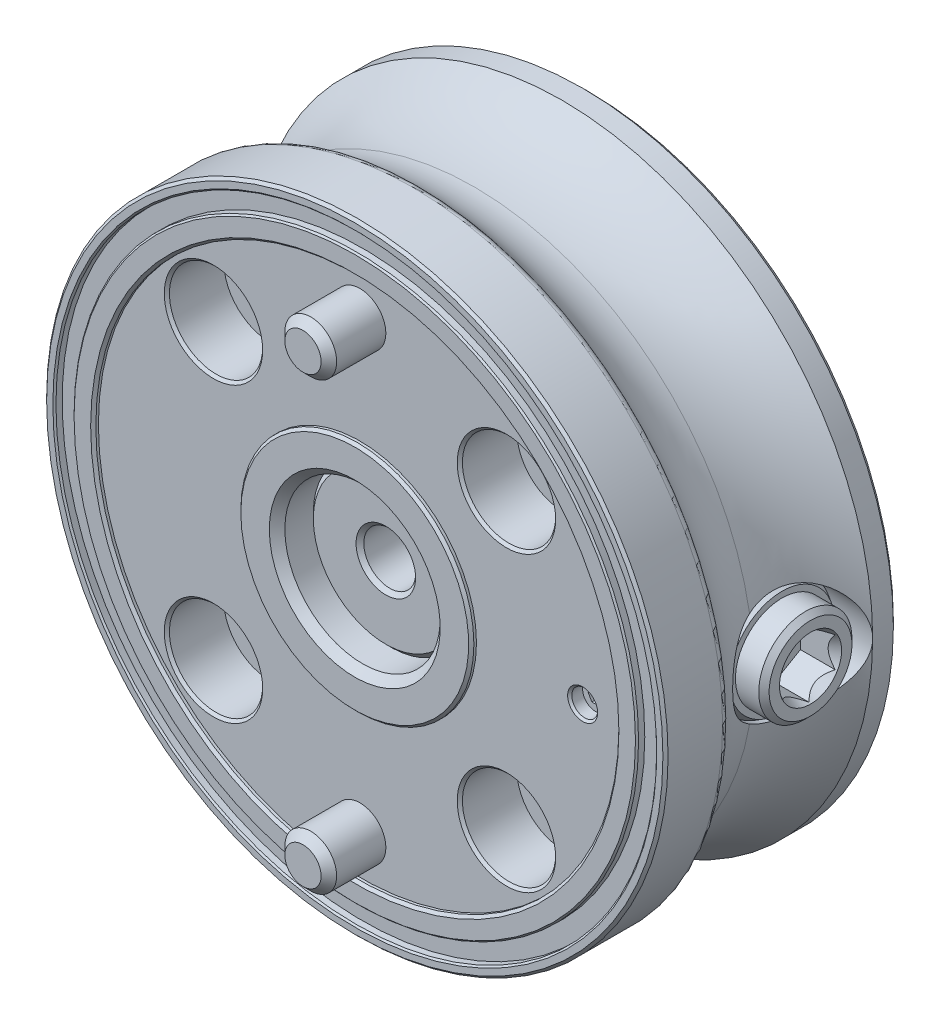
ISO-10303-21;
HEADER;
FILE_DESCRIPTION(('STEP AP214'),'2;1');
FILE_NAME('part.step','',(''),(''),'','','');
FILE_SCHEMA(('AUTOMOTIVE_DESIGN { 1 0 10303 214 1 1 1 1 }'));
ENDSEC;
DATA;
#1=APPLICATION_CONTEXT('core data for automotive mechanical design processes');
#2=APPLICATION_PROTOCOL_DEFINITION('international standard','automotive_design',2000,#1);
#3=PRODUCT_CONTEXT('',#1,'mechanical');
#4=PRODUCT('Part','Part','',(#3));
#5=PRODUCT_RELATED_PRODUCT_CATEGORY('part','',(#4));
#6=PRODUCT_DEFINITION_FORMATION('','',#4);
#7=PRODUCT_DEFINITION_CONTEXT('part definition',#1,'design');
#8=PRODUCT_DEFINITION('design','',#6,#7);
#9=PRODUCT_DEFINITION_SHAPE('','',#8);
#10=(LENGTH_UNIT() NAMED_UNIT(*) SI_UNIT(.MILLI.,.METRE.));
#11=(NAMED_UNIT(*) PLANE_ANGLE_UNIT() SI_UNIT($,.RADIAN.));
#12=(NAMED_UNIT(*) SI_UNIT($,.STERADIAN.) SOLID_ANGLE_UNIT());
#13=UNCERTAINTY_MEASURE_WITH_UNIT(LENGTH_MEASURE(1.E-05),#10,'distance_accuracy_value','');
#14=(GEOMETRIC_REPRESENTATION_CONTEXT(3) GLOBAL_UNCERTAINTY_ASSIGNED_CONTEXT((#13)) GLOBAL_UNIT_ASSIGNED_CONTEXT((#10,
#11,#12)) REPRESENTATION_CONTEXT('',''));
#15=CARTESIAN_POINT('',(0.,0.,0.));
#16=DIRECTION('',(0.,0.,1.));
#17=DIRECTION('',(1.,0.,0.));
#18=AXIS2_PLACEMENT_3D('',#15,#16,#17);
#19=CARTESIAN_POINT('',(59.,0.,16.));
#20=DIRECTION('',(1.,0.,0.));
#21=DIRECTION('',(0.,1.,0.));
#22=AXIS2_PLACEMENT_3D('',#19,#20,#21);
#23=PLANE('',#22);
#24=CARTESIAN_POINT('',(59.,0.,16.));
#25=DIRECTION('',(1.,0.,0.));
#26=DIRECTION('',(0.,1.,0.));
#27=AXIS2_PLACEMENT_3D('',#24,#25,#26);
#28=CIRCLE('',#27,8.);
#29=CARTESIAN_POINT('',(59.,8.,16.));
#30=VERTEX_POINT('',#29);
#31=EDGE_CURVE('E526',#30,#30,#28,.T.);
#32=ORIENTED_EDGE('',*,*,#31,.T.);
#33=EDGE_LOOP('',(#32));
#34=FACE_BOUND('',#33,.T.);
#35=CARTESIAN_POINT('',(59.,0.,16.));
#36=DIRECTION('',(1.,0.,0.));
#37=DIRECTION('',(0.,1.,0.));
#38=AXIS2_PLACEMENT_3D('',#35,#36,#37);
#39=CIRCLE('',#38,6.);
#40=CARTESIAN_POINT('',(59.,6.,16.));
#41=VERTEX_POINT('',#40);
#42=EDGE_CURVE('E1191',#41,#41,#39,.T.);
#43=ORIENTED_EDGE('',*,*,#42,.F.);
#44=EDGE_LOOP('',(#43));
#45=FACE_BOUND('',#44,.T.);
#46=ADVANCED_FACE('F14',(#34,#45),#23,.T.);
#47=CARTESIAN_POINT('',(43.,0.,23.));
#48=DIRECTION('',(0.,0.,1.));
#49=DIRECTION('',(1.,0.,0.));
#50=AXIS2_PLACEMENT_3D('',#47,#48,#49);
#51=CYLINDRICAL_SURFACE('',#50,2.5);
#52=CARTESIAN_POINT('',(43.,0.,41.5));
#53=DIRECTION('',(0.,0.,-1.));
#54=DIRECTION('',(-1.,0.,0.));
#55=AXIS2_PLACEMENT_3D('',#52,#53,#54);
#56=CIRCLE('',#55,2.5);
#57=CARTESIAN_POINT('',(40.5,0.,41.5));
#58=VERTEX_POINT('',#57);
#59=EDGE_CURVE('E28',#58,#58,#56,.T.);
#60=ORIENTED_EDGE('',*,*,#59,.T.);
#61=EDGE_LOOP('',(#60));
#62=FACE_BOUND('',#61,.T.);
#63=CARTESIAN_POINT('',(43.,0.,43.6));
#64=DIRECTION('',(0.,0.,1.));
#65=DIRECTION('',(1.,0.,0.));
#66=AXIS2_PLACEMENT_3D('',#63,#64,#65);
#67=CIRCLE('',#66,2.5);
#68=CARTESIAN_POINT('',(45.5,0.,43.6));
#69=VERTEX_POINT('',#68);
#70=EDGE_CURVE('E551',#69,#69,#67,.F.);
#71=ORIENTED_EDGE('',*,*,#70,.F.);
#72=EDGE_LOOP('',(#71));
#73=FACE_BOUND('',#72,.T.);
#74=ADVANCED_FACE('F387',(#62,#73),#51,.F.);
#75=CARTESIAN_POINT('',(43.,0.,44.));
#76=DIRECTION('',(0.,0.,1.));
#77=DIRECTION('',(1.,0.,0.));
#78=AXIS2_PLACEMENT_3D('',#75,#76,#77);
#79=CONICAL_SURFACE('',#78,2.9,0.785398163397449);
#80=ORIENTED_EDGE('',*,*,#70,.T.);
#81=EDGE_LOOP('',(#80));
#82=FACE_BOUND('',#81,.T.);
#83=CARTESIAN_POINT('',(43.,0.,44.));
#84=DIRECTION('',(0.,0.,1.));
#85=DIRECTION('',(1.,0.,0.));
#86=AXIS2_PLACEMENT_3D('',#83,#84,#85);
#87=CIRCLE('',#86,2.9);
#88=CARTESIAN_POINT('',(45.9,0.,44.));
#89=VERTEX_POINT('',#88);
#90=EDGE_CURVE('E123',#89,#89,#87,.T.);
#91=ORIENTED_EDGE('',*,*,#90,.T.);
#92=EDGE_LOOP('',(#91));
#93=FACE_BOUND('',#92,.T.);
#94=ADVANCED_FACE('F238',(#82,#93),#79,.F.);
#95=CARTESIAN_POINT('',(0.,0.,44.));
#96=DIRECTION('',(0.,0.,1.));
#97=DIRECTION('',(1.,0.,0.));
#98=AXIS2_PLACEMENT_3D('',#95,#96,#97);
#99=PLANE('',#98);
#100=CARTESIAN_POINT('',(0.,43.,44.));
#101=DIRECTION('',(0.,0.,1.));
#102=DIRECTION('',(0.,1.,0.));
#103=AXIS2_PLACEMENT_3D('',#100,#101,#102);
#104=CIRCLE('',#103,5.);
#105=CARTESIAN_POINT('',(0.,48.,44.));
#106=VERTEX_POINT('',#105);
#107=EDGE_CURVE('E517',#106,#106,#104,.T.);
#108=ORIENTED_EDGE('',*,*,#107,.F.);
#109=EDGE_LOOP('',(#108));
#110=FACE_BOUND('',#109,.T.);
#111=ORIENTED_EDGE('',*,*,#90,.F.);
#112=EDGE_LOOP('',(#111));
#113=FACE_BOUND('',#112,.T.);
#114=CARTESIAN_POINT('',(28.2842712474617,-28.2842712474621,44.));
#115=DIRECTION('',(0.,0.,1.));
#116=DIRECTION('',(1.,0.,0.));
#117=AXIS2_PLACEMENT_3D('',#114,#115,#116);
#118=CIRCLE('',#117,9.5);
#119=CARTESIAN_POINT('',(37.7842712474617,-28.2842712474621,44.));
#120=VERTEX_POINT('',#119);
#121=EDGE_CURVE('E791',#120,#120,#118,.T.);
#122=ORIENTED_EDGE('',*,*,#121,.F.);
#123=EDGE_LOOP('',(#122));
#124=FACE_BOUND('',#123,.T.);
#125=CARTESIAN_POINT('',(-28.2842712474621,-28.2842712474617,44.));
#126=DIRECTION('',(0.,0.,1.));
#127=DIRECTION('',(1.,0.,0.));
#128=AXIS2_PLACEMENT_3D('',#125,#126,#127);
#129=CIRCLE('',#128,9.5);
#130=CARTESIAN_POINT('',(-18.784271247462,-28.2842712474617,44.));
#131=VERTEX_POINT('',#130);
#132=EDGE_CURVE('E809',#131,#131,#129,.T.);
#133=ORIENTED_EDGE('',*,*,#132,.F.);
#134=EDGE_LOOP('',(#133));
#135=FACE_BOUND('',#134,.T.);
#136=CARTESIAN_POINT('',(-28.2842712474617,28.2842712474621,44.));
#137=DIRECTION('',(0.,0.,1.));
#138=DIRECTION('',(1.,0.,0.));
#139=AXIS2_PLACEMENT_3D('',#136,#137,#138);
#140=CIRCLE('',#139,9.5);
#141=CARTESIAN_POINT('',(-18.7842712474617,28.2842712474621,44.));
#142=VERTEX_POINT('',#141);
#143=EDGE_CURVE('E825',#142,#142,#140,.T.);
#144=ORIENTED_EDGE('',*,*,#143,.F.);
#145=EDGE_LOOP('',(#144));
#146=FACE_BOUND('',#145,.T.);
#147=CARTESIAN_POINT('',(28.2842712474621,28.2842712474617,44.));
#148=DIRECTION('',(0.,0.,1.));
#149=DIRECTION('',(1.,0.,0.));
#150=AXIS2_PLACEMENT_3D('',#147,#148,#149);
#151=CIRCLE('',#150,9.5);
#152=CARTESIAN_POINT('',(37.7842712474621,28.2842712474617,44.));
#153=VERTEX_POINT('',#152);
#154=EDGE_CURVE('E841',#153,#153,#151,.T.);
#155=ORIENTED_EDGE('',*,*,#154,.F.);
#156=EDGE_LOOP('',(#155));
#157=FACE_BOUND('',#156,.T.);
#158=CARTESIAN_POINT('',(0.,0.,44.));
#159=DIRECTION('',(0.,0.,1.));
#160=DIRECTION('',(1.,0.,0.));
#161=AXIS2_PLACEMENT_3D('',#158,#159,#160);
#162=CIRCLE('',#161,22.5);
#163=CARTESIAN_POINT('',(22.5,0.,44.));
#164=VERTEX_POINT('',#163);
#165=EDGE_CURVE('E863',#164,#164,#162,.T.);
#166=ORIENTED_EDGE('',*,*,#165,.F.);
#167=EDGE_LOOP('',(#166));
#168=FACE_BOUND('',#167,.T.);
#169=CARTESIAN_POINT('',(0.,0.,44.));
#170=DIRECTION('',(0.,0.,1.));
#171=DIRECTION('',(1.,0.,0.));
#172=AXIS2_PLACEMENT_3D('',#169,#170,#171);
#173=CIRCLE('',#172,50.5);
#174=CARTESIAN_POINT('',(50.5,0.,44.));
#175=VERTEX_POINT('',#174);
#176=EDGE_CURVE('E865',#175,#175,#173,.T.);
#177=ORIENTED_EDGE('',*,*,#176,.T.);
#178=EDGE_LOOP('',(#177));
#179=FACE_BOUND('',#178,.T.);
#180=CARTESIAN_POINT('',(0.,-43.,44.));
#181=DIRECTION('',(0.,0.,1.));
#182=DIRECTION('',(0.,1.,0.));
#183=AXIS2_PLACEMENT_3D('',#180,#181,#182);
#184=CIRCLE('',#183,5.);
#185=CARTESIAN_POINT('',(0.,-38.,44.));
#186=VERTEX_POINT('',#185);
#187=EDGE_CURVE('E519',#186,#186,#184,.T.);
#188=ORIENTED_EDGE('',*,*,#187,.F.);
#189=EDGE_LOOP('',(#188));
#190=FACE_BOUND('',#189,.T.);
#191=ADVANCED_FACE('F368',(#110,#113,#124,#135,#146,#157,#168,#179,#190),#99,.T.);
#192=CARTESIAN_POINT('',(0.,43.,112.10207800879));
#193=DIRECTION('',(0.,0.,1.));
#194=DIRECTION('',(0.,1.,0.));
#195=AXIS2_PLACEMENT_3D('',#192,#193,#194);
#196=CYLINDRICAL_SURFACE('',#195,5.);
#197=CARTESIAN_POINT('',(0.,43.,53.5));
#198=DIRECTION('',(0.,0.,-1.));
#199=DIRECTION('',(0.,-1.,0.));
#200=AXIS2_PLACEMENT_3D('',#197,#198,#199);
#201=CIRCLE('',#200,5.);
#202=CARTESIAN_POINT('',(0.,38.,53.5));
#203=VERTEX_POINT('',#202);
#204=EDGE_CURVE('E513',#203,#203,#201,.T.);
#205=ORIENTED_EDGE('',*,*,#204,.T.);
#206=EDGE_LOOP('',(#205));
#207=FACE_BOUND('',#206,.T.);
#208=ORIENTED_EDGE('',*,*,#107,.T.);
#209=EDGE_LOOP('',(#208));
#210=FACE_BOUND('',#209,.T.);
#211=ADVANCED_FACE('F266',(#207,#210),#196,.T.);
#212=CARTESIAN_POINT('',(28.2842712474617,-28.2842712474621,44.));
#213=DIRECTION('',(0.,0.,1.));
#214=DIRECTION('',(1.,0.,0.));
#215=AXIS2_PLACEMENT_3D('',#212,#213,#214);
#216=CONICAL_SURFACE('',#215,9.5,0.785398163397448);
#217=CARTESIAN_POINT('',(28.2842712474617,-28.2842712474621,43.5));
#218=DIRECTION('',(0.,0.,1.));
#219=DIRECTION('',(1.,0.,0.));
#220=AXIS2_PLACEMENT_3D('',#217,#218,#219);
#221=CIRCLE('',#220,9.);
#222=CARTESIAN_POINT('',(37.2842712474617,-28.2842712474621,43.5));
#223=VERTEX_POINT('',#222);
#224=EDGE_CURVE('E794',#223,#223,#221,.T.);
#225=ORIENTED_EDGE('',*,*,#224,.F.);
#226=EDGE_LOOP('',(#225));
#227=FACE_BOUND('',#226,.T.);
#228=ORIENTED_EDGE('',*,*,#121,.T.);
#229=EDGE_LOOP('',(#228));
#230=FACE_BOUND('',#229,.T.);
#231=ADVANCED_FACE('F262',(#227,#230),#216,.F.);
#232=CARTESIAN_POINT('',(-28.2842712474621,-28.2842712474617,44.));
#233=DIRECTION('',(0.,0.,1.));
#234=DIRECTION('',(1.,0.,0.));
#235=AXIS2_PLACEMENT_3D('',#232,#233,#234);
#236=CONICAL_SURFACE('',#235,9.5,0.785398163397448);
#237=CARTESIAN_POINT('',(-28.2842712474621,-28.2842712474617,43.5));
#238=DIRECTION('',(0.,0.,1.));
#239=DIRECTION('',(1.,0.,0.));
#240=AXIS2_PLACEMENT_3D('',#237,#238,#239);
#241=CIRCLE('',#240,9.);
#242=CARTESIAN_POINT('',(-19.2842712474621,-28.2842712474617,43.5));
#243=VERTEX_POINT('',#242);
#244=EDGE_CURVE('E812',#243,#243,#241,.T.);
#245=ORIENTED_EDGE('',*,*,#244,.F.);
#246=EDGE_LOOP('',(#245));
#247=FACE_BOUND('',#246,.T.);
#248=ORIENTED_EDGE('',*,*,#132,.T.);
#249=EDGE_LOOP('',(#248));
#250=FACE_BOUND('',#249,.T.);
#251=ADVANCED_FACE('F265',(#247,#250),#236,.F.);
#252=CARTESIAN_POINT('',(-28.2842712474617,28.2842712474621,44.));
#253=DIRECTION('',(0.,0.,1.));
#254=DIRECTION('',(1.,0.,0.));
#255=AXIS2_PLACEMENT_3D('',#252,#253,#254);
#256=CONICAL_SURFACE('',#255,9.5,0.785398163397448);
#257=CARTESIAN_POINT('',(-28.2842712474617,28.2842712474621,43.5));
#258=DIRECTION('',(0.,0.,1.));
#259=DIRECTION('',(1.,0.,0.));
#260=AXIS2_PLACEMENT_3D('',#257,#258,#259);
#261=CIRCLE('',#260,9.);
#262=CARTESIAN_POINT('',(-19.2842712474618,28.2842712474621,43.5));
#263=VERTEX_POINT('',#262);
#264=EDGE_CURVE('E828',#263,#263,#261,.T.);
#265=ORIENTED_EDGE('',*,*,#264,.F.);
#266=EDGE_LOOP('',(#265));
#267=FACE_BOUND('',#266,.T.);
#268=ORIENTED_EDGE('',*,*,#143,.T.);
#269=EDGE_LOOP('',(#268));
#270=FACE_BOUND('',#269,.T.);
#271=ADVANCED_FACE('F292',(#267,#270),#256,.F.);
#272=CARTESIAN_POINT('',(28.2842712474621,28.2842712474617,44.));
#273=DIRECTION('',(0.,0.,1.));
#274=DIRECTION('',(1.,0.,0.));
#275=AXIS2_PLACEMENT_3D('',#272,#273,#274);
#276=CONICAL_SURFACE('',#275,9.5,0.785398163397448);
#277=CARTESIAN_POINT('',(28.2842712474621,28.2842712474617,43.5));
#278=DIRECTION('',(0.,0.,1.));
#279=DIRECTION('',(1.,0.,0.));
#280=AXIS2_PLACEMENT_3D('',#277,#278,#279);
#281=CIRCLE('',#280,9.);
#282=CARTESIAN_POINT('',(37.2842712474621,28.2842712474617,43.5));
#283=VERTEX_POINT('',#282);
#284=EDGE_CURVE('E844',#283,#283,#281,.T.);
#285=ORIENTED_EDGE('',*,*,#284,.F.);
#286=EDGE_LOOP('',(#285));
#287=FACE_BOUND('',#286,.T.);
#288=ORIENTED_EDGE('',*,*,#154,.T.);
#289=EDGE_LOOP('',(#288));
#290=FACE_BOUND('',#289,.T.);
#291=ADVANCED_FACE('F312',(#287,#290),#276,.F.);
#292=CARTESIAN_POINT('',(0.,0.,44.));
#293=DIRECTION('',(0.,0.,1.));
#294=DIRECTION('',(1.,0.,0.));
#295=AXIS2_PLACEMENT_3D('',#292,#293,#294);
#296=CYLINDRICAL_SURFACE('',#295,22.5);
#297=CARTESIAN_POINT('',(0.,0.,44.5));
#298=DIRECTION('',(0.,0.,-1.));
#299=DIRECTION('',(-1.,0.,0.));
#300=AXIS2_PLACEMENT_3D('',#297,#298,#299);
#301=CIRCLE('',#300,22.5);
#302=CARTESIAN_POINT('',(-22.5,0.,44.5));
#303=VERTEX_POINT('',#302);
#304=EDGE_CURVE('E591',#303,#303,#301,.T.);
#305=ORIENTED_EDGE('',*,*,#304,.T.);
#306=EDGE_LOOP('',(#305));
#307=FACE_BOUND('',#306,.T.);
#308=ORIENTED_EDGE('',*,*,#165,.T.);
#309=EDGE_LOOP('',(#308));
#310=FACE_BOUND('',#309,.T.);
#311=ADVANCED_FACE('F332',(#307,#310),#296,.T.);
#312=CARTESIAN_POINT('',(0.,0.,44.));
#313=DIRECTION('',(0.,0.,1.));
#314=DIRECTION('',(1.,0.,0.));
#315=AXIS2_PLACEMENT_3D('',#312,#313,#314);
#316=CYLINDRICAL_SURFACE('',#315,50.5);
#317=CARTESIAN_POINT('',(0.,0.,44.5));
#318=DIRECTION('',(0.,0.,-1.));
#319=DIRECTION('',(-1.,0.,0.));
#320=AXIS2_PLACEMENT_3D('',#317,#318,#319);
#321=CIRCLE('',#320,50.5);
#322=CARTESIAN_POINT('',(-50.5,0.,44.5));
#323=VERTEX_POINT('',#322);
#324=EDGE_CURVE('E600',#323,#323,#321,.F.);
#325=ORIENTED_EDGE('',*,*,#324,.T.);
#326=EDGE_LOOP('',(#325));
#327=FACE_BOUND('',#326,.T.);
#328=ORIENTED_EDGE('',*,*,#176,.F.);
#329=EDGE_LOOP('',(#328));
#330=FACE_BOUND('',#329,.T.);
#331=ADVANCED_FACE('F236',(#327,#330),#316,.F.);
#332=CARTESIAN_POINT('',(0.,-43.,112.10207800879));
#333=DIRECTION('',(0.,0.,1.));
#334=DIRECTION('',(0.,1.,0.));
#335=AXIS2_PLACEMENT_3D('',#332,#333,#334);
#336=CYLINDRICAL_SURFACE('',#335,5.);
#337=CARTESIAN_POINT('',(0.,-43.,53.5));
#338=DIRECTION('',(0.,0.,-1.));
#339=DIRECTION('',(0.,-1.,0.));
#340=AXIS2_PLACEMENT_3D('',#337,#338,#339);
#341=CIRCLE('',#340,5.);
#342=CARTESIAN_POINT('',(0.,-48.,53.5));
#343=VERTEX_POINT('',#342);
#344=EDGE_CURVE('E877',#343,#343,#341,.T.);
#345=ORIENTED_EDGE('',*,*,#344,.T.);
#346=EDGE_LOOP('',(#345));
#347=FACE_BOUND('',#346,.T.);
#348=ORIENTED_EDGE('',*,*,#187,.T.);
#349=EDGE_LOOP('',(#348));
#350=FACE_BOUND('',#349,.T.);
#351=ADVANCED_FACE('F373',(#347,#350),#336,.T.);
#352=CARTESIAN_POINT('',(0.,43.,55.));
#353=DIRECTION('',(0.,0.,-1.));
#354=DIRECTION('',(0.,-1.,0.));
#355=AXIS2_PLACEMENT_3D('',#352,#353,#354);
#356=CONICAL_SURFACE('',#355,3.5,0.785398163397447);
#357=ORIENTED_EDGE('',*,*,#204,.F.);
#358=EDGE_LOOP('',(#357));
#359=FACE_BOUND('',#358,.T.);
#360=CARTESIAN_POINT('',(0.,43.,55.));
#361=DIRECTION('',(0.,0.,-1.));
#362=DIRECTION('',(0.,-1.,0.));
#363=AXIS2_PLACEMENT_3D('',#360,#361,#362);
#364=CIRCLE('',#363,3.5);
#365=CARTESIAN_POINT('',(0.,39.5,55.));
#366=VERTEX_POINT('',#365);
#367=EDGE_CURVE('E516',#366,#366,#364,.F.);
#368=ORIENTED_EDGE('',*,*,#367,.F.);
#369=EDGE_LOOP('',(#368));
#370=FACE_BOUND('',#369,.T.);
#371=ADVANCED_FACE('F271',(#359,#370),#356,.T.);
#372=CARTESIAN_POINT('',(28.2842712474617,-28.2842712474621,44.));
#373=DIRECTION('',(0.,0.,1.));
#374=DIRECTION('',(1.,0.,0.));
#375=AXIS2_PLACEMENT_3D('',#372,#373,#374);
#376=CYLINDRICAL_SURFACE('',#375,9.);
#377=CARTESIAN_POINT('',(28.2842712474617,-28.2842712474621,33.));
#378=DIRECTION('',(0.,0.,1.));
#379=DIRECTION('',(1.,0.,0.));
#380=AXIS2_PLACEMENT_3D('',#377,#378,#379);
#381=CIRCLE('',#380,9.);
#382=CARTESIAN_POINT('',(37.2842712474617,-28.2842712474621,33.));
#383=VERTEX_POINT('',#382);
#384=EDGE_CURVE('E799',#383,#383,#381,.T.);
#385=ORIENTED_EDGE('',*,*,#384,.F.);
#386=EDGE_LOOP('',(#385));
#387=FACE_BOUND('',#386,.T.);
#388=ORIENTED_EDGE('',*,*,#224,.T.);
#389=EDGE_LOOP('',(#388));
#390=FACE_BOUND('',#389,.T.);
#391=ADVANCED_FACE('F237',(#387,#390),#376,.F.);
#392=CARTESIAN_POINT('',(-28.2842712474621,-28.2842712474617,44.));
#393=DIRECTION('',(0.,0.,1.));
#394=DIRECTION('',(1.,0.,0.));
#395=AXIS2_PLACEMENT_3D('',#392,#393,#394);
#396=CYLINDRICAL_SURFACE('',#395,9.);
#397=CARTESIAN_POINT('',(-28.2842712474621,-28.2842712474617,33.));
#398=DIRECTION('',(0.,0.,1.));
#399=DIRECTION('',(1.,0.,0.));
#400=AXIS2_PLACEMENT_3D('',#397,#398,#399);
#401=CIRCLE('',#400,9.);
#402=CARTESIAN_POINT('',(-19.2842712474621,-28.2842712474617,33.));
#403=VERTEX_POINT('',#402);
#404=EDGE_CURVE('E815',#403,#403,#401,.T.);
#405=ORIENTED_EDGE('',*,*,#404,.F.);
#406=EDGE_LOOP('',(#405));
#407=FACE_BOUND('',#406,.T.);
#408=ORIENTED_EDGE('',*,*,#244,.T.);
#409=EDGE_LOOP('',(#408));
#410=FACE_BOUND('',#409,.T.);
#411=ADVANCED_FACE('F270',(#407,#410),#396,.F.);
#412=CARTESIAN_POINT('',(-28.2842712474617,28.2842712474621,44.));
#413=DIRECTION('',(0.,0.,1.));
#414=DIRECTION('',(1.,0.,0.));
#415=AXIS2_PLACEMENT_3D('',#412,#413,#414);
#416=CYLINDRICAL_SURFACE('',#415,9.);
#417=CARTESIAN_POINT('',(-28.2842712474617,28.2842712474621,33.));
#418=DIRECTION('',(0.,0.,1.));
#419=DIRECTION('',(1.,0.,0.));
#420=AXIS2_PLACEMENT_3D('',#417,#418,#419);
#421=CIRCLE('',#420,9.);
#422=CARTESIAN_POINT('',(-19.2842712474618,28.2842712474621,33.));
#423=VERTEX_POINT('',#422);
#424=EDGE_CURVE('E831',#423,#423,#421,.T.);
#425=ORIENTED_EDGE('',*,*,#424,.F.);
#426=EDGE_LOOP('',(#425));
#427=FACE_BOUND('',#426,.T.);
#428=ORIENTED_EDGE('',*,*,#264,.T.);
#429=EDGE_LOOP('',(#428));
#430=FACE_BOUND('',#429,.T.);
#431=ADVANCED_FACE('F296',(#427,#430),#416,.F.);
#432=CARTESIAN_POINT('',(28.2842712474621,28.2842712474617,44.));
#433=DIRECTION('',(0.,0.,1.));
#434=DIRECTION('',(1.,0.,0.));
#435=AXIS2_PLACEMENT_3D('',#432,#433,#434);
#436=CYLINDRICAL_SURFACE('',#435,9.);
#437=CARTESIAN_POINT('',(28.2842712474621,28.2842712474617,33.));
#438=DIRECTION('',(0.,0.,1.));
#439=DIRECTION('',(1.,0.,0.));
#440=AXIS2_PLACEMENT_3D('',#437,#438,#439);
#441=CIRCLE('',#440,9.);
#442=CARTESIAN_POINT('',(37.2842712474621,28.2842712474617,33.));
#443=VERTEX_POINT('',#442);
#444=EDGE_CURVE('E847',#443,#443,#441,.T.);
#445=ORIENTED_EDGE('',*,*,#444,.F.);
#446=EDGE_LOOP('',(#445));
#447=FACE_BOUND('',#446,.T.);
#448=ORIENTED_EDGE('',*,*,#284,.T.);
#449=EDGE_LOOP('',(#448));
#450=FACE_BOUND('',#449,.T.);
#451=ADVANCED_FACE('F316',(#447,#450),#436,.F.);
#452=CARTESIAN_POINT('',(0.,0.,45.));
#453=DIRECTION('',(0.,0.,-1.));
#454=DIRECTION('',(-1.,0.,0.));
#455=AXIS2_PLACEMENT_3D('',#452,#453,#454);
#456=CONICAL_SURFACE('',#455,22.,0.785398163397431);
#457=ORIENTED_EDGE('',*,*,#304,.F.);
#458=EDGE_LOOP('',(#457));
#459=FACE_BOUND('',#458,.T.);
#460=CARTESIAN_POINT('',(0.,0.,45.));
#461=DIRECTION('',(0.,0.,-1.));
#462=DIRECTION('',(-1.,0.,0.));
#463=AXIS2_PLACEMENT_3D('',#460,#461,#462);
#464=CIRCLE('',#463,22.);
#465=CARTESIAN_POINT('',(-22.,0.,45.));
#466=VERTEX_POINT('',#465);
#467=EDGE_CURVE('E594',#466,#466,#464,.F.);
#468=ORIENTED_EDGE('',*,*,#467,.F.);
#469=EDGE_LOOP('',(#468));
#470=FACE_BOUND('',#469,.T.);
#471=ADVANCED_FACE('F336',(#459,#470),#456,.T.);
#472=CARTESIAN_POINT('',(0.,0.,44.5));
#473=DIRECTION('',(0.,0.,1.));
#474=DIRECTION('',(1.,0.,0.));
#475=AXIS2_PLACEMENT_3D('',#472,#473,#474);
#476=CONICAL_SURFACE('',#475,50.5,0.785398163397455);
#477=CARTESIAN_POINT('',(0.,0.,45.));
#478=DIRECTION('',(0.,0.,-1.));
#479=DIRECTION('',(-1.,0.,0.));
#480=AXIS2_PLACEMENT_3D('',#477,#478,#479);
#481=CIRCLE('',#480,51.);
#482=CARTESIAN_POINT('',(-51.,0.,45.));
#483=VERTEX_POINT('',#482);
#484=EDGE_CURVE('E597',#483,#483,#481,.T.);
#485=ORIENTED_EDGE('',*,*,#484,.F.);
#486=EDGE_LOOP('',(#485));
#487=FACE_BOUND('',#486,.T.);
#488=ORIENTED_EDGE('',*,*,#324,.F.);
#489=EDGE_LOOP('',(#488));
#490=FACE_BOUND('',#489,.T.);
#491=ADVANCED_FACE('F214',(#487,#490),#476,.F.);
#492=CARTESIAN_POINT('',(0.,-43.,55.));
#493=DIRECTION('',(0.,0.,-1.));
#494=DIRECTION('',(0.,-1.,0.));
#495=AXIS2_PLACEMENT_3D('',#492,#493,#494);
#496=CONICAL_SURFACE('',#495,3.5,0.785398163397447);
#497=ORIENTED_EDGE('',*,*,#344,.F.);
#498=EDGE_LOOP('',(#497));
#499=FACE_BOUND('',#498,.T.);
#500=CARTESIAN_POINT('',(0.,-43.,55.));
#501=DIRECTION('',(0.,0.,-1.));
#502=DIRECTION('',(0.,-1.,0.));
#503=AXIS2_PLACEMENT_3D('',#500,#501,#502);
#504=CIRCLE('',#503,3.5);
#505=CARTESIAN_POINT('',(0.,-46.5,55.));
#506=VERTEX_POINT('',#505);
#507=EDGE_CURVE('E875',#506,#506,#504,.F.);
#508=ORIENTED_EDGE('',*,*,#507,.F.);
#509=EDGE_LOOP('',(#508));
#510=FACE_BOUND('',#509,.T.);
#511=ADVANCED_FACE('F383',(#499,#510),#496,.T.);
#512=CARTESIAN_POINT('',(-5.,43.,55.));
#513=DIRECTION('',(0.,0.,-1.));
#514=DIRECTION('',(0.,-1.,0.));
#515=AXIS2_PLACEMENT_3D('',#512,#513,#514);
#516=PLANE('',#515);
#517=ORIENTED_EDGE('',*,*,#367,.T.);
#518=EDGE_LOOP('',(#517));
#519=FACE_BOUND('',#518,.T.);
#520=ADVANCED_FACE('F277',(#519),#516,.F.);
#521=CARTESIAN_POINT('',(28.2842712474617,-19.2842712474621,33.));
#522=DIRECTION('',(0.,0.,-1.));
#523=DIRECTION('',(-1.,0.,0.));
#524=AXIS2_PLACEMENT_3D('',#521,#522,#523);
#525=PLANE('',#524);
#526=CARTESIAN_POINT('',(28.2842712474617,-28.2842712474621,33.));
#527=DIRECTION('',(0.,0.,1.));
#528=DIRECTION('',(1.,0.,0.));
#529=AXIS2_PLACEMENT_3D('',#526,#527,#528);
#530=CIRCLE('',#529,5.5);
#531=CARTESIAN_POINT('',(33.7842712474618,-28.2842712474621,33.));
#532=VERTEX_POINT('',#531);
#533=EDGE_CURVE('E802',#532,#532,#530,.T.);
#534=ORIENTED_EDGE('',*,*,#533,.F.);
#535=EDGE_LOOP('',(#534));
#536=FACE_BOUND('',#535,.T.);
#537=ORIENTED_EDGE('',*,*,#384,.T.);
#538=EDGE_LOOP('',(#537));
#539=FACE_BOUND('',#538,.T.);
#540=ADVANCED_FACE('F273',(#536,#539),#525,.F.);
#541=CARTESIAN_POINT('',(-28.2842712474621,-19.2842712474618,33.));
#542=DIRECTION('',(0.,0.,-1.));
#543=DIRECTION('',(-1.,0.,0.));
#544=AXIS2_PLACEMENT_3D('',#541,#542,#543);
#545=PLANE('',#544);
#546=CARTESIAN_POINT('',(-28.2842712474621,-28.2842712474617,33.));
#547=DIRECTION('',(0.,0.,1.));
#548=DIRECTION('',(1.,0.,0.));
#549=AXIS2_PLACEMENT_3D('',#546,#547,#548);
#550=CIRCLE('',#549,5.5);
#551=CARTESIAN_POINT('',(-22.7842712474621,-28.2842712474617,33.));
#552=VERTEX_POINT('',#551);
#553=EDGE_CURVE('E818',#552,#552,#550,.T.);
#554=ORIENTED_EDGE('',*,*,#553,.F.);
#555=EDGE_LOOP('',(#554));
#556=FACE_BOUND('',#555,.T.);
#557=ORIENTED_EDGE('',*,*,#404,.T.);
#558=EDGE_LOOP('',(#557));
#559=FACE_BOUND('',#558,.T.);
#560=ADVANCED_FACE('F276',(#556,#559),#545,.F.);
#561=CARTESIAN_POINT('',(-28.2842712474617,37.2842712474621,33.));
#562=DIRECTION('',(0.,0.,-1.));
#563=DIRECTION('',(-1.,0.,0.));
#564=AXIS2_PLACEMENT_3D('',#561,#562,#563);
#565=PLANE('',#564);
#566=CARTESIAN_POINT('',(-28.2842712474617,28.2842712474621,33.));
#567=DIRECTION('',(0.,0.,1.));
#568=DIRECTION('',(1.,0.,0.));
#569=AXIS2_PLACEMENT_3D('',#566,#567,#568);
#570=CIRCLE('',#569,5.5);
#571=CARTESIAN_POINT('',(-22.7842712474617,28.2842712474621,33.));
#572=VERTEX_POINT('',#571);
#573=EDGE_CURVE('E834',#572,#572,#570,.T.);
#574=ORIENTED_EDGE('',*,*,#573,.F.);
#575=EDGE_LOOP('',(#574));
#576=FACE_BOUND('',#575,.T.);
#577=ORIENTED_EDGE('',*,*,#424,.T.);
#578=EDGE_LOOP('',(#577));
#579=FACE_BOUND('',#578,.T.);
#580=ADVANCED_FACE('F300',(#576,#579),#565,.F.);
#581=CARTESIAN_POINT('',(28.2842712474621,37.2842712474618,33.));
#582=DIRECTION('',(0.,0.,-1.));
#583=DIRECTION('',(-1.,0.,0.));
#584=AXIS2_PLACEMENT_3D('',#581,#582,#583);
#585=PLANE('',#584);
#586=CARTESIAN_POINT('',(28.2842712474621,28.2842712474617,33.));
#587=DIRECTION('',(0.,0.,1.));
#588=DIRECTION('',(1.,0.,0.));
#589=AXIS2_PLACEMENT_3D('',#586,#587,#588);
#590=CIRCLE('',#589,5.5);
#591=CARTESIAN_POINT('',(33.7842712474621,28.2842712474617,33.));
#592=VERTEX_POINT('',#591);
#593=EDGE_CURVE('E850',#592,#592,#590,.T.);
#594=ORIENTED_EDGE('',*,*,#593,.F.);
#595=EDGE_LOOP('',(#594));
#596=FACE_BOUND('',#595,.T.);
#597=ORIENTED_EDGE('',*,*,#444,.T.);
#598=EDGE_LOOP('',(#597));
#599=FACE_BOUND('',#598,.T.);
#600=ADVANCED_FACE('F320',(#596,#599),#585,.F.);
#601=CARTESIAN_POINT('',(0.,15.,45.));
#602=DIRECTION('',(0.,0.,-1.));
#603=DIRECTION('',(-1.,0.,0.));
#604=AXIS2_PLACEMENT_3D('',#601,#602,#603);
#605=PLANE('',#604);
#606=ORIENTED_EDGE('',*,*,#467,.T.);
#607=EDGE_LOOP('',(#606));
#608=FACE_BOUND('',#607,.T.);
#609=CARTESIAN_POINT('',(0.,0.,45.));
#610=DIRECTION('',(0.,0.,-1.));
#611=DIRECTION('',(-1.,0.,0.));
#612=AXIS2_PLACEMENT_3D('',#609,#610,#611);
#613=CIRCLE('',#612,16.5);
#614=CARTESIAN_POINT('',(-16.5,0.,45.));
#615=VERTEX_POINT('',#614);
#616=EDGE_CURVE('E607',#615,#615,#613,.T.);
#617=ORIENTED_EDGE('',*,*,#616,.T.);
#618=EDGE_LOOP('',(#617));
#619=FACE_BOUND('',#618,.T.);
#620=ADVANCED_FACE('F340',(#608,#619),#605,.F.);
#621=CARTESIAN_POINT('',(0.,0.,45.));
#622=DIRECTION('',(0.,0.,-1.));
#623=DIRECTION('',(-1.,0.,0.));
#624=AXIS2_PLACEMENT_3D('',#621,#622,#623);
#625=CIRCLE('',#624,54.2);
#626=CARTESIAN_POINT('',(-54.2,0.,45.));
#627=VERTEX_POINT('',#626);
#628=EDGE_CURVE('E570',#627,#627,#625,.F.);
#629=ORIENTED_EDGE('',*,*,#628,.T.);
#630=EDGE_LOOP('',(#629));
#631=FACE_BOUND('',#630,.T.);
#632=ORIENTED_EDGE('',*,*,#484,.T.);
#633=EDGE_LOOP('',(#632));
#634=FACE_BOUND('',#633,.T.);
#635=ADVANCED_FACE('F191',(#631,#634),#605,.F.);
#636=CARTESIAN_POINT('',(-5.,-43.,55.));
#637=DIRECTION('',(0.,0.,-1.));
#638=DIRECTION('',(0.,-1.,0.));
#639=AXIS2_PLACEMENT_3D('',#636,#637,#638);
#640=PLANE('',#639);
#641=ORIENTED_EDGE('',*,*,#507,.T.);
#642=EDGE_LOOP('',(#641));
#643=FACE_BOUND('',#642,.T.);
#644=ADVANCED_FACE('F283',(#643),#640,.F.);
#645=CARTESIAN_POINT('',(28.2842712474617,-28.2842712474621,44.));
#646=DIRECTION('',(0.,0.,1.));
#647=DIRECTION('',(1.,0.,0.));
#648=AXIS2_PLACEMENT_3D('',#645,#646,#647);
#649=CYLINDRICAL_SURFACE('',#648,5.5);
#650=CARTESIAN_POINT('',(28.2842712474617,-28.2842712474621,0.5));
#651=DIRECTION('',(0.,0.,1.));
#652=DIRECTION('',(1.,0.,0.));
#653=AXIS2_PLACEMENT_3D('',#650,#651,#652);
#654=CIRCLE('',#653,5.5);
#655=CARTESIAN_POINT('',(33.7842712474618,-28.2842712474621,0.5));
#656=VERTEX_POINT('',#655);
#657=EDGE_CURVE('E805',#656,#656,#654,.T.);
#658=ORIENTED_EDGE('',*,*,#657,.F.);
#659=EDGE_LOOP('',(#658));
#660=FACE_BOUND('',#659,.T.);
#661=ORIENTED_EDGE('',*,*,#533,.T.);
#662=EDGE_LOOP('',(#661));
#663=FACE_BOUND('',#662,.T.);
#664=ADVANCED_FACE('F279',(#660,#663),#649,.F.);
#665=CARTESIAN_POINT('',(-28.2842712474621,-28.2842712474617,44.));
#666=DIRECTION('',(0.,0.,1.));
#667=DIRECTION('',(1.,0.,0.));
#668=AXIS2_PLACEMENT_3D('',#665,#666,#667);
#669=CYLINDRICAL_SURFACE('',#668,5.5);
#670=CARTESIAN_POINT('',(-28.2842712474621,-28.2842712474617,0.5));
#671=DIRECTION('',(0.,0.,1.));
#672=DIRECTION('',(1.,0.,0.));
#673=AXIS2_PLACEMENT_3D('',#670,#671,#672);
#674=CIRCLE('',#673,5.5);
#675=CARTESIAN_POINT('',(-22.7842712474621,-28.2842712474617,0.5));
#676=VERTEX_POINT('',#675);
#677=EDGE_CURVE('E821',#676,#676,#674,.T.);
#678=ORIENTED_EDGE('',*,*,#677,.F.);
#679=EDGE_LOOP('',(#678));
#680=FACE_BOUND('',#679,.T.);
#681=ORIENTED_EDGE('',*,*,#553,.T.);
#682=EDGE_LOOP('',(#681));
#683=FACE_BOUND('',#682,.T.);
#684=ADVANCED_FACE('F282',(#680,#683),#669,.F.);
#685=CARTESIAN_POINT('',(-28.2842712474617,28.2842712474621,44.));
#686=DIRECTION('',(0.,0.,1.));
#687=DIRECTION('',(1.,0.,0.));
#688=AXIS2_PLACEMENT_3D('',#685,#686,#687);
#689=CYLINDRICAL_SURFACE('',#688,5.5);
#690=CARTESIAN_POINT('',(-28.2842712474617,28.2842712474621,0.5));
#691=DIRECTION('',(0.,0.,1.));
#692=DIRECTION('',(1.,0.,0.));
#693=AXIS2_PLACEMENT_3D('',#690,#691,#692);
#694=CIRCLE('',#693,5.5);
#695=CARTESIAN_POINT('',(-22.7842712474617,28.2842712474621,0.5));
#696=VERTEX_POINT('',#695);
#697=EDGE_CURVE('E837',#696,#696,#694,.T.);
#698=ORIENTED_EDGE('',*,*,#697,.F.);
#699=EDGE_LOOP('',(#698));
#700=FACE_BOUND('',#699,.T.);
#701=ORIENTED_EDGE('',*,*,#573,.T.);
#702=EDGE_LOOP('',(#701));
#703=FACE_BOUND('',#702,.T.);
#704=ADVANCED_FACE('F304',(#700,#703),#689,.F.);
#705=CARTESIAN_POINT('',(28.2842712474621,28.2842712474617,44.));
#706=DIRECTION('',(0.,0.,1.));
#707=DIRECTION('',(1.,0.,0.));
#708=AXIS2_PLACEMENT_3D('',#705,#706,#707);
#709=CYLINDRICAL_SURFACE('',#708,5.5);
#710=CARTESIAN_POINT('',(28.2842712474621,28.2842712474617,0.5));
#711=DIRECTION('',(0.,0.,1.));
#712=DIRECTION('',(1.,0.,0.));
#713=AXIS2_PLACEMENT_3D('',#710,#711,#712);
#714=CIRCLE('',#713,5.5);
#715=CARTESIAN_POINT('',(33.7842712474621,28.2842712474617,0.5));
#716=VERTEX_POINT('',#715);
#717=EDGE_CURVE('E853',#716,#716,#714,.T.);
#718=ORIENTED_EDGE('',*,*,#717,.F.);
#719=EDGE_LOOP('',(#718));
#720=FACE_BOUND('',#719,.T.);
#721=ORIENTED_EDGE('',*,*,#593,.T.);
#722=EDGE_LOOP('',(#721));
#723=FACE_BOUND('',#722,.T.);
#724=ADVANCED_FACE('F324',(#720,#723),#709,.F.);
#725=CARTESIAN_POINT('',(0.,0.,43.5));
#726=DIRECTION('',(0.,0.,1.));
#727=DIRECTION('',(1.,0.,0.));
#728=AXIS2_PLACEMENT_3D('',#725,#726,#727);
#729=CONICAL_SURFACE('',#728,15.,0.785398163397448);
#730=ORIENTED_EDGE('',*,*,#616,.F.);
#731=EDGE_LOOP('',(#730));
#732=FACE_BOUND('',#731,.T.);
#733=CARTESIAN_POINT('',(0.,0.,43.5));
#734=DIRECTION('',(0.,0.,-1.));
#735=DIRECTION('',(-1.,0.,0.));
#736=AXIS2_PLACEMENT_3D('',#733,#734,#735);
#737=CIRCLE('',#736,15.);
#738=CARTESIAN_POINT('',(-15.,0.,43.5));
#739=VERTEX_POINT('',#738);
#740=EDGE_CURVE('E179',#739,#739,#737,.F.);
#741=ORIENTED_EDGE('',*,*,#740,.F.);
#742=EDGE_LOOP('',(#741));
#743=FACE_BOUND('',#742,.T.);
#744=ADVANCED_FACE('F344',(#732,#743),#729,.F.);
#745=CARTESIAN_POINT('',(0.,0.,45.));
#746=DIRECTION('',(0.,0.,-1.));
#747=DIRECTION('',(-1.,0.,0.));
#748=AXIS2_PLACEMENT_3D('',#745,#746,#747);
#749=CONICAL_SURFACE('',#748,54.2,0.785398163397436);
#750=CARTESIAN_POINT('',(0.,0.,44.7));
#751=DIRECTION('',(0.,0.,-1.));
#752=DIRECTION('',(-1.,0.,0.));
#753=AXIS2_PLACEMENT_3D('',#750,#751,#752);
#754=CIRCLE('',#753,54.5);
#755=CARTESIAN_POINT('',(-54.5,0.,44.7));
#756=VERTEX_POINT('',#755);
#757=EDGE_CURVE('E567',#756,#756,#754,.T.);
#758=ORIENTED_EDGE('',*,*,#757,.F.);
#759=EDGE_LOOP('',(#758));
#760=FACE_BOUND('',#759,.T.);
#761=ORIENTED_EDGE('',*,*,#628,.F.);
#762=EDGE_LOOP('',(#761));
#763=FACE_BOUND('',#762,.T.);
#764=ADVANCED_FACE('F288',(#760,#763),#749,.T.);
#765=CARTESIAN_POINT('',(28.2842712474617,-28.2842712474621,0.5));
#766=DIRECTION('',(0.,0.,-1.));
#767=DIRECTION('',(-1.,0.,0.));
#768=AXIS2_PLACEMENT_3D('',#765,#766,#767);
#769=CONICAL_SURFACE('',#768,5.5,0.785398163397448);
#770=CARTESIAN_POINT('',(28.2842712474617,-28.2842712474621,0.));
#771=DIRECTION('',(0.,0.,1.));
#772=DIRECTION('',(1.,0.,0.));
#773=AXIS2_PLACEMENT_3D('',#770,#771,#772);
#774=CIRCLE('',#773,6.);
#775=CARTESIAN_POINT('',(34.2842712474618,-28.2842712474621,0.));
#776=VERTEX_POINT('',#775);
#777=EDGE_CURVE('E764',#776,#776,#774,.T.);
#778=ORIENTED_EDGE('',*,*,#777,.F.);
#779=EDGE_LOOP('',(#778));
#780=FACE_BOUND('',#779,.T.);
#781=ORIENTED_EDGE('',*,*,#657,.T.);
#782=EDGE_LOOP('',(#781));
#783=FACE_BOUND('',#782,.T.);
#784=ADVANCED_FACE('F256',(#780,#783),#769,.F.);
#785=CARTESIAN_POINT('',(-28.2842712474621,-28.2842712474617,0.5));
#786=DIRECTION('',(0.,0.,-1.));
#787=DIRECTION('',(-1.,0.,0.));
#788=AXIS2_PLACEMENT_3D('',#785,#786,#787);
#789=CONICAL_SURFACE('',#788,5.5,0.785398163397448);
#790=CARTESIAN_POINT('',(-28.2842712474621,-28.2842712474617,0.));
#791=DIRECTION('',(0.,0.,1.));
#792=DIRECTION('',(1.,0.,0.));
#793=AXIS2_PLACEMENT_3D('',#790,#791,#792);
#794=CIRCLE('',#793,6.);
#795=CARTESIAN_POINT('',(-22.2842712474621,-28.2842712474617,0.));
#796=VERTEX_POINT('',#795);
#797=EDGE_CURVE('E768',#796,#796,#794,.T.);
#798=ORIENTED_EDGE('',*,*,#797,.F.);
#799=EDGE_LOOP('',(#798));
#800=FACE_BOUND('',#799,.T.);
#801=ORIENTED_EDGE('',*,*,#677,.T.);
#802=EDGE_LOOP('',(#801));
#803=FACE_BOUND('',#802,.T.);
#804=ADVANCED_FACE('F287',(#800,#803),#789,.F.);
#805=CARTESIAN_POINT('',(-28.2842712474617,28.2842712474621,0.5));
#806=DIRECTION('',(0.,0.,-1.));
#807=DIRECTION('',(-1.,0.,0.));
#808=AXIS2_PLACEMENT_3D('',#805,#806,#807);
#809=CONICAL_SURFACE('',#808,5.5,0.785398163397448);
#810=CARTESIAN_POINT('',(-28.2842712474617,28.2842712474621,0.));
#811=DIRECTION('',(0.,0.,1.));
#812=DIRECTION('',(1.,0.,0.));
#813=AXIS2_PLACEMENT_3D('',#810,#811,#812);
#814=CIRCLE('',#813,6.);
#815=CARTESIAN_POINT('',(-22.2842712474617,28.2842712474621,0.));
#816=VERTEX_POINT('',#815);
#817=EDGE_CURVE('E772',#816,#816,#814,.T.);
#818=ORIENTED_EDGE('',*,*,#817,.F.);
#819=EDGE_LOOP('',(#818));
#820=FACE_BOUND('',#819,.T.);
#821=ORIENTED_EDGE('',*,*,#697,.T.);
#822=EDGE_LOOP('',(#821));
#823=FACE_BOUND('',#822,.T.);
#824=ADVANCED_FACE('F308',(#820,#823),#809,.F.);
#825=CARTESIAN_POINT('',(28.2842712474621,28.2842712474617,0.5));
#826=DIRECTION('',(0.,0.,-1.));
#827=DIRECTION('',(-1.,0.,0.));
#828=AXIS2_PLACEMENT_3D('',#825,#826,#827);
#829=CONICAL_SURFACE('',#828,5.5,0.785398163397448);
#830=CARTESIAN_POINT('',(28.2842712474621,28.2842712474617,0.));
#831=DIRECTION('',(0.,0.,1.));
#832=DIRECTION('',(1.,0.,0.));
#833=AXIS2_PLACEMENT_3D('',#830,#831,#832);
#834=CIRCLE('',#833,6.);
#835=CARTESIAN_POINT('',(34.2842712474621,28.2842712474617,0.));
#836=VERTEX_POINT('',#835);
#837=EDGE_CURVE('E776',#836,#836,#834,.T.);
#838=ORIENTED_EDGE('',*,*,#837,.F.);
#839=EDGE_LOOP('',(#838));
#840=FACE_BOUND('',#839,.T.);
#841=ORIENTED_EDGE('',*,*,#717,.T.);
#842=EDGE_LOOP('',(#841));
#843=FACE_BOUND('',#842,.T.);
#844=ADVANCED_FACE('F328',(#840,#843),#829,.F.);
#845=CARTESIAN_POINT('',(0.,0.,56.4129634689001));
#846=DIRECTION('',(0.,0.,1.));
#847=DIRECTION('',(1.,0.,0.));
#848=AXIS2_PLACEMENT_3D('',#845,#846,#847);
#849=CYLINDRICAL_SURFACE('',#848,15.);
#850=CARTESIAN_POINT('',(0.,0.,38.));
#851=DIRECTION('',(0.,0.,-1.));
#852=DIRECTION('',(-1.,0.,0.));
#853=AXIS2_PLACEMENT_3D('',#850,#851,#852);
#854=CIRCLE('',#853,15.);
#855=CARTESIAN_POINT('',(-15.,0.,38.));
#856=VERTEX_POINT('',#855);
#857=EDGE_CURVE('E528',#856,#856,#854,.T.);
#858=ORIENTED_EDGE('',*,*,#857,.T.);
#859=EDGE_LOOP('',(#858));
#860=FACE_BOUND('',#859,.T.);
#861=ORIENTED_EDGE('',*,*,#740,.T.);
#862=EDGE_LOOP('',(#861));
#863=FACE_BOUND('',#862,.T.);
#864=ADVANCED_FACE('F348',(#860,#863),#849,.F.);
#865=CARTESIAN_POINT('',(0.,0.,43.5));
#866=DIRECTION('',(0.,0.,1.));
#867=DIRECTION('',(1.,0.,0.));
#868=AXIS2_PLACEMENT_3D('',#865,#866,#867);
#869=CYLINDRICAL_SURFACE('',#868,54.5);
#870=ORIENTED_EDGE('',*,*,#757,.T.);
#871=EDGE_LOOP('',(#870));
#872=FACE_BOUND('',#871,.T.);
#873=CARTESIAN_POINT('',(0.,0.,43.5));
#874=DIRECTION('',(0.,0.,1.));
#875=DIRECTION('',(1.,0.,0.));
#876=AXIS2_PLACEMENT_3D('',#873,#874,#875);
#877=CIRCLE('',#876,54.5);
#878=CARTESIAN_POINT('',(54.5,0.,43.5));
#879=VERTEX_POINT('',#878);
#880=EDGE_CURVE('E857',#879,#879,#877,.T.);
#881=ORIENTED_EDGE('',*,*,#880,.T.);
#882=EDGE_LOOP('',(#881));
#883=FACE_BOUND('',#882,.T.);
#884=ADVANCED_FACE('F350',(#872,#883),#869,.T.);
#885=CARTESIAN_POINT('',(0.,30.,0.));
#886=DIRECTION('',(0.,0.,1.));
#887=DIRECTION('',(1.,0.,0.));
#888=AXIS2_PLACEMENT_3D('',#885,#886,#887);
#889=PLANE('',#888);
#890=CARTESIAN_POINT('',(0.,-43.,0.));
#891=DIRECTION('',(0.,0.,1.));
#892=DIRECTION('',(1.,0.,0.));
#893=AXIS2_PLACEMENT_3D('',#890,#891,#892);
#894=CIRCLE('',#893,5.5);
#895=CARTESIAN_POINT('',(5.5,-43.,0.));
#896=VERTEX_POINT('',#895);
#897=EDGE_CURVE('E582',#896,#896,#894,.T.);
#898=ORIENTED_EDGE('',*,*,#897,.T.);
#899=EDGE_LOOP('',(#898));
#900=FACE_BOUND('',#899,.T.);
#901=CARTESIAN_POINT('',(0.,43.,0.));
#902=DIRECTION('',(0.,0.,1.));
#903=DIRECTION('',(1.,0.,0.));
#904=AXIS2_PLACEMENT_3D('',#901,#902,#903);
#905=CIRCLE('',#904,5.5);
#906=CARTESIAN_POINT('',(5.5,43.,0.));
#907=VERTEX_POINT('',#906);
#908=EDGE_CURVE('E585',#907,#907,#905,.T.);
#909=ORIENTED_EDGE('',*,*,#908,.T.);
#910=EDGE_LOOP('',(#909));
#911=FACE_BOUND('',#910,.T.);
#912=ORIENTED_EDGE('',*,*,#777,.T.);
#913=EDGE_LOOP('',(#912));
#914=FACE_BOUND('',#913,.T.);
#915=ORIENTED_EDGE('',*,*,#797,.T.);
#916=EDGE_LOOP('',(#915));
#917=FACE_BOUND('',#916,.T.);
#918=ORIENTED_EDGE('',*,*,#817,.T.);
#919=EDGE_LOOP('',(#918));
#920=FACE_BOUND('',#919,.T.);
#921=ORIENTED_EDGE('',*,*,#837,.T.);
#922=EDGE_LOOP('',(#921));
#923=FACE_BOUND('',#922,.T.);
#924=CARTESIAN_POINT('',(0.,0.,0.));
#925=DIRECTION('',(0.,0.,1.));
#926=DIRECTION('',(1.,0.,0.));
#927=AXIS2_PLACEMENT_3D('',#924,#925,#926);
#928=CIRCLE('',#927,59.);
#929=CARTESIAN_POINT('',(59.,0.,0.));
#930=VERTEX_POINT('',#929);
#931=EDGE_CURVE('E168',#930,#930,#928,.F.);
#932=ORIENTED_EDGE('',*,*,#931,.T.);
#933=EDGE_LOOP('',(#932));
#934=FACE_BOUND('',#933,.T.);
#935=CARTESIAN_POINT('',(0.,0.,0.));
#936=DIRECTION('',(0.,0.,1.));
#937=DIRECTION('',(1.,0.,0.));
#938=AXIS2_PLACEMENT_3D('',#935,#936,#937);
#939=CIRCLE('',#938,30.);
#940=CARTESIAN_POINT('',(30.,0.,0.));
#941=VERTEX_POINT('',#940);
#942=EDGE_CURVE('E130',#941,#941,#939,.T.);
#943=ORIENTED_EDGE('',*,*,#942,.T.);
#944=EDGE_LOOP('',(#943));
#945=FACE_BOUND('',#944,.T.);
#946=ADVANCED_FACE('F353',(#900,#911,#914,#917,#920,#923,#934,#945),#889,.F.);
#947=CARTESIAN_POINT('',(0.,0.,39.));
#948=DIRECTION('',(0.,0.,-1.));
#949=DIRECTION('',(-1.,0.,0.));
#950=AXIS2_PLACEMENT_3D('',#947,#948,#949);
#951=CONICAL_SURFACE('',#950,14.,0.785398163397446);
#952=ORIENTED_EDGE('',*,*,#857,.F.);
#953=EDGE_LOOP('',(#952));
#954=FACE_BOUND('',#953,.T.);
#955=CARTESIAN_POINT('',(0.,0.,39.));
#956=DIRECTION('',(0.,0.,-1.));
#957=DIRECTION('',(-1.,0.,0.));
#958=AXIS2_PLACEMENT_3D('',#955,#956,#957);
#959=CIRCLE('',#958,14.);
#960=CARTESIAN_POINT('',(-14.,0.,39.));
#961=VERTEX_POINT('',#960);
#962=EDGE_CURVE('E544',#961,#961,#959,.F.);
#963=ORIENTED_EDGE('',*,*,#962,.F.);
#964=EDGE_LOOP('',(#963));
#965=FACE_BOUND('',#964,.T.);
#966=ADVANCED_FACE('F261',(#954,#965),#951,.T.);
#967=CARTESIAN_POINT('',(0.,0.,43.5));
#968=DIRECTION('',(0.,0.,1.));
#969=DIRECTION('',(1.,0.,0.));
#970=AXIS2_PLACEMENT_3D('',#967,#968,#969);
#971=PLANE('',#970);
#972=ORIENTED_EDGE('',*,*,#880,.F.);
#973=EDGE_LOOP('',(#972));
#974=FACE_BOUND('',#973,.T.);
#975=CARTESIAN_POINT('',(0.,0.,43.5));
#976=DIRECTION('',(0.,0.,1.));
#977=DIRECTION('',(1.,0.,0.));
#978=AXIS2_PLACEMENT_3D('',#975,#976,#977);
#979=CIRCLE('',#978,58.);
#980=CARTESIAN_POINT('',(58.,0.,43.5));
#981=VERTEX_POINT('',#980);
#982=EDGE_CURVE('E860',#981,#981,#979,.T.);
#983=ORIENTED_EDGE('',*,*,#982,.T.);
#984=EDGE_LOOP('',(#983));
#985=FACE_BOUND('',#984,.T.);
#986=ADVANCED_FACE('F355',(#974,#985),#971,.T.);
#987=CARTESIAN_POINT('',(0.,-43.,0.5));
#988=DIRECTION('',(0.,0.,-1.));
#989=DIRECTION('',(-1.,0.,0.));
#990=AXIS2_PLACEMENT_3D('',#987,#988,#989);
#991=CONICAL_SURFACE('',#990,5.,0.785398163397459);
#992=ORIENTED_EDGE('',*,*,#897,.F.);
#993=EDGE_LOOP('',(#992));
#994=FACE_BOUND('',#993,.T.);
#995=CARTESIAN_POINT('',(0.,-43.,0.5));
#996=DIRECTION('',(0.,0.,1.));
#997=DIRECTION('',(1.,0.,0.));
#998=AXIS2_PLACEMENT_3D('',#995,#996,#997);
#999=CIRCLE('',#998,5.);
#1000=CARTESIAN_POINT('',(5.,-43.,0.5));
#1001=VERTEX_POINT('',#1000);
#1002=EDGE_CURVE('E588',#1001,#1001,#999,.F.);
#1003=ORIENTED_EDGE('',*,*,#1002,.F.);
#1004=EDGE_LOOP('',(#1003));
#1005=FACE_BOUND('',#1004,.T.);
#1006=ADVANCED_FACE('F358',(#994,#1005),#991,.F.);
#1007=CARTESIAN_POINT('',(0.,43.,0.5));
#1008=DIRECTION('',(0.,0.,-1.));
#1009=DIRECTION('',(-1.,0.,0.));
#1010=AXIS2_PLACEMENT_3D('',#1007,#1008,#1009);
#1011=CONICAL_SURFACE('',#1010,5.,0.785398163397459);
#1012=ORIENTED_EDGE('',*,*,#908,.F.);
#1013=EDGE_LOOP('',(#1012));
#1014=FACE_BOUND('',#1013,.T.);
#1015=CARTESIAN_POINT('',(0.,43.,0.5));
#1016=DIRECTION('',(0.,0.,1.));
#1017=DIRECTION('',(1.,0.,0.));
#1018=AXIS2_PLACEMENT_3D('',#1015,#1016,#1017);
#1019=CIRCLE('',#1018,5.);
#1020=CARTESIAN_POINT('',(5.,43.,0.5));
#1021=VERTEX_POINT('',#1020);
#1022=EDGE_CURVE('E579',#1021,#1021,#1019,.F.);
#1023=ORIENTED_EDGE('',*,*,#1022,.F.);
#1024=EDGE_LOOP('',(#1023));
#1025=FACE_BOUND('',#1024,.T.);
#1026=ADVANCED_FACE('F631',(#1014,#1025),#1011,.F.);
#1027=CARTESIAN_POINT('',(0.,0.,0.999999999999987));
#1028=DIRECTION('',(0.,0.,1.));
#1029=DIRECTION('',(1.,0.,0.));
#1030=AXIS2_PLACEMENT_3D('',#1027,#1028,#1029);
#1031=CONICAL_SURFACE('',#1030,60.,0.785398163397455);
#1032=ORIENTED_EDGE('',*,*,#931,.F.);
#1033=EDGE_LOOP('',(#1032));
#1034=FACE_BOUND('',#1033,.T.);
#1035=CARTESIAN_POINT('',(0.,0.,0.999999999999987));
#1036=DIRECTION('',(0.,0.,1.));
#1037=DIRECTION('',(1.,0.,0.));
#1038=AXIS2_PLACEMENT_3D('',#1035,#1036,#1037);
#1039=CIRCLE('',#1038,60.);
#1040=CARTESIAN_POINT('',(60.,0.,0.999999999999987));
#1041=VERTEX_POINT('',#1040);
#1042=EDGE_CURVE('E165',#1041,#1041,#1039,.T.);
#1043=ORIENTED_EDGE('',*,*,#1042,.F.);
#1044=EDGE_LOOP('',(#1043));
#1045=FACE_BOUND('',#1044,.T.);
#1046=ADVANCED_FACE('F464',(#1034,#1045),#1031,.T.);
#1047=CARTESIAN_POINT('',(0.,0.,0.353553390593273));
#1048=DIRECTION('',(0.,0.,-1.));
#1049=DIRECTION('',(-1.,0.,0.));
#1050=AXIS2_PLACEMENT_3D('',#1047,#1048,#1049);
#1051=CONICAL_SURFACE('',#1050,29.6464466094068,0.785398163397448);
#1052=ORIENTED_EDGE('',*,*,#942,.F.);
#1053=EDGE_LOOP('',(#1052));
#1054=FACE_BOUND('',#1053,.T.);
#1055=CARTESIAN_POINT('',(0.,0.,0.353553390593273));
#1056=DIRECTION('',(0.,0.,1.));
#1057=DIRECTION('',(1.,0.,0.));
#1058=AXIS2_PLACEMENT_3D('',#1055,#1056,#1057);
#1059=CIRCLE('',#1058,29.6464466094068);
#1060=CARTESIAN_POINT('',(29.6464466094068,0.,0.353553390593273));
#1061=VERTEX_POINT('',#1060);
#1062=EDGE_CURVE('E138',#1061,#1061,#1059,.T.);
#1063=ORIENTED_EDGE('',*,*,#1062,.T.);
#1064=EDGE_LOOP('',(#1063));
#1065=FACE_BOUND('',#1064,.T.);
#1066=ADVANCED_FACE('F636',(#1054,#1065),#1051,.F.);
#1067=CARTESIAN_POINT('',(0.,0.,39.));
#1068=DIRECTION('',(0.,0.,-1.));
#1069=DIRECTION('',(-1.,0.,0.));
#1070=AXIS2_PLACEMENT_3D('',#1067,#1068,#1069);
#1071=PLANE('',#1070);
#1072=CARTESIAN_POINT('',(0.,0.,39.));
#1073=DIRECTION('',(0.,0.,1.));
#1074=DIRECTION('',(1.,0.,0.));
#1075=AXIS2_PLACEMENT_3D('',#1072,#1073,#1074);
#1076=CIRCLE('',#1075,5.75);
#1077=CARTESIAN_POINT('',(5.75,0.,39.));
#1078=VERTEX_POINT('',#1077);
#1079=EDGE_CURVE('E535',#1078,#1078,#1076,.T.);
#1080=ORIENTED_EDGE('',*,*,#1079,.F.);
#1081=EDGE_LOOP('',(#1080));
#1082=FACE_BOUND('',#1081,.T.);
#1083=ORIENTED_EDGE('',*,*,#962,.T.);
#1084=EDGE_LOOP('',(#1083));
#1085=FACE_BOUND('',#1084,.T.);
#1086=ADVANCED_FACE('F362',(#1082,#1085),#1071,.F.);
#1087=CARTESIAN_POINT('',(0.,0.,43.5));
#1088=DIRECTION('',(0.,0.,1.));
#1089=DIRECTION('',(1.,0.,0.));
#1090=AXIS2_PLACEMENT_3D('',#1087,#1088,#1089);
#1091=CYLINDRICAL_SURFACE('',#1090,58.);
#1092=CARTESIAN_POINT('',(0.,0.,44.7));
#1093=DIRECTION('',(0.,0.,-1.));
#1094=DIRECTION('',(-1.,0.,0.));
#1095=AXIS2_PLACEMENT_3D('',#1092,#1093,#1094);
#1096=CIRCLE('',#1095,58.);
#1097=CARTESIAN_POINT('',(-58.,0.,44.7));
#1098=VERTEX_POINT('',#1097);
#1099=EDGE_CURVE('E576',#1098,#1098,#1096,.F.);
#1100=ORIENTED_EDGE('',*,*,#1099,.T.);
#1101=EDGE_LOOP('',(#1100));
#1102=FACE_BOUND('',#1101,.T.);
#1103=ORIENTED_EDGE('',*,*,#982,.F.);
#1104=EDGE_LOOP('',(#1103));
#1105=FACE_BOUND('',#1104,.T.);
#1106=ADVANCED_FACE('F259',(#1102,#1105),#1091,.F.);
#1107=CARTESIAN_POINT('',(0.,-43.,20.));
#1108=DIRECTION('',(0.,0.,-1.));
#1109=DIRECTION('',(-1.,0.,0.));
#1110=AXIS2_PLACEMENT_3D('',#1107,#1108,#1109);
#1111=CYLINDRICAL_SURFACE('',#1110,5.);
#1112=ORIENTED_EDGE('',*,*,#1002,.T.);
#1113=EDGE_LOOP('',(#1112));
#1114=FACE_BOUND('',#1113,.T.);
#1115=CARTESIAN_POINT('',(0.,-43.,20.));
#1116=DIRECTION('',(0.,0.,-1.));
#1117=DIRECTION('',(-1.,0.,0.));
#1118=AXIS2_PLACEMENT_3D('',#1115,#1116,#1117);
#1119=CIRCLE('',#1118,5.);
#1120=CARTESIAN_POINT('',(-5.,-43.,20.));
#1121=VERTEX_POINT('',#1120);
#1122=EDGE_CURVE('E788',#1121,#1121,#1119,.T.);
#1123=ORIENTED_EDGE('',*,*,#1122,.F.);
#1124=EDGE_LOOP('',(#1123));
#1125=FACE_BOUND('',#1124,.T.);
#1126=ADVANCED_FACE('F249',(#1114,#1125),#1111,.F.);
#1127=CARTESIAN_POINT('',(0.,43.,20.));
#1128=DIRECTION('',(0.,0.,-1.));
#1129=DIRECTION('',(-1.,0.,0.));
#1130=AXIS2_PLACEMENT_3D('',#1127,#1128,#1129);
#1131=CYLINDRICAL_SURFACE('',#1130,5.);
#1132=ORIENTED_EDGE('',*,*,#1022,.T.);
#1133=EDGE_LOOP('',(#1132));
#1134=FACE_BOUND('',#1133,.T.);
#1135=CARTESIAN_POINT('',(0.,43.,20.));
#1136=DIRECTION('',(0.,0.,-1.));
#1137=DIRECTION('',(-1.,0.,0.));
#1138=AXIS2_PLACEMENT_3D('',#1135,#1136,#1137);
#1139=CIRCLE('',#1138,5.);
#1140=CARTESIAN_POINT('',(-5.,43.,20.));
#1141=VERTEX_POINT('',#1140);
#1142=EDGE_CURVE('E228',#1141,#1141,#1139,.T.);
#1143=ORIENTED_EDGE('',*,*,#1142,.F.);
#1144=EDGE_LOOP('',(#1143));
#1145=FACE_BOUND('',#1144,.T.);
#1146=ADVANCED_FACE('F246',(#1134,#1145),#1131,.F.);
#1147=CARTESIAN_POINT('',(0.,0.,56.4129634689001));
#1148=DIRECTION('',(0.,0.,1.));
#1149=DIRECTION('',(1.,0.,0.));
#1150=AXIS2_PLACEMENT_3D('',#1147,#1148,#1149);
#1151=CYLINDRICAL_SURFACE('',#1150,60.);
#1152=ORIENTED_EDGE('',*,*,#1042,.T.);
#1153=EDGE_LOOP('',(#1152));
#1154=FACE_BOUND('',#1153,.T.);
#1155=CARTESIAN_POINT('',(0.,0.,5.));
#1156=DIRECTION('',(0.,0.,1.));
#1157=DIRECTION('',(1.,0.,0.));
#1158=AXIS2_PLACEMENT_3D('',#1155,#1156,#1157);
#1159=CIRCLE('',#1158,60.);
#1160=CARTESIAN_POINT('',(60.,0.,5.));
#1161=VERTEX_POINT('',#1160);
#1162=EDGE_CURVE('E128',#1161,#1161,#1159,.T.);
#1163=ORIENTED_EDGE('',*,*,#1162,.F.);
#1164=EDGE_LOOP('',(#1163));
#1165=FACE_BOUND('',#1164,.T.);
#1166=ADVANCED_FACE('F192',(#1154,#1165),#1151,.T.);
#1167=CARTESIAN_POINT('',(0.,0.,0.));
#1168=DIRECTION('',(0.,0.,1.));
#1169=DIRECTION('',(1.,0.,0.));
#1170=AXIS2_PLACEMENT_3D('',#1167,#1168,#1169);
#1171=TOROIDAL_SURFACE('',#1170,29.2928932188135,0.5);
#1172=ORIENTED_EDGE('',*,*,#1062,.F.);
#1173=EDGE_LOOP('',(#1172));
#1174=FACE_BOUND('',#1173,.T.);
#1175=CARTESIAN_POINT('',(0.,0.,0.5));
#1176=DIRECTION('',(0.,0.,1.));
#1177=DIRECTION('',(1.,0.,0.));
#1178=AXIS2_PLACEMENT_3D('',#1175,#1176,#1177);
#1179=CIRCLE('',#1178,29.2928932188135);
#1180=CARTESIAN_POINT('',(29.2928932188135,0.,0.5));
#1181=VERTEX_POINT('',#1180);
#1182=EDGE_CURVE('E141',#1181,#1181,#1179,.T.);
#1183=ORIENTED_EDGE('',*,*,#1182,.T.);
#1184=EDGE_LOOP('',(#1183));
#1185=FACE_BOUND('',#1184,.T.);
#1186=ADVANCED_FACE('F364',(#1174,#1185),#1171,.F.);
#1187=CARTESIAN_POINT('',(0.,0.,39.));
#1188=DIRECTION('',(0.,0.,1.));
#1189=DIRECTION('',(1.,0.,0.));
#1190=AXIS2_PLACEMENT_3D('',#1187,#1188,#1189);
#1191=CONICAL_SURFACE('',#1190,5.75,0.785398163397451);
#1192=CARTESIAN_POINT('',(0.,0.,38.25));
#1193=DIRECTION('',(0.,0.,1.));
#1194=DIRECTION('',(1.,0.,0.));
#1195=AXIS2_PLACEMENT_3D('',#1192,#1193,#1194);
#1196=CIRCLE('',#1195,5.);
#1197=CARTESIAN_POINT('',(5.,0.,38.25));
#1198=VERTEX_POINT('',#1197);
#1199=EDGE_CURVE('E533',#1198,#1198,#1196,.F.);
#1200=ORIENTED_EDGE('',*,*,#1199,.T.);
#1201=EDGE_LOOP('',(#1200));
#1202=FACE_BOUND('',#1201,.T.);
#1203=ORIENTED_EDGE('',*,*,#1079,.T.);
#1204=EDGE_LOOP('',(#1203));
#1205=FACE_BOUND('',#1204,.T.);
#1206=ADVANCED_FACE('F638',(#1202,#1205),#1191,.F.);
#1207=CARTESIAN_POINT('',(0.,0.,44.7));
#1208=DIRECTION('',(0.,0.,1.));
#1209=DIRECTION('',(1.,0.,0.));
#1210=AXIS2_PLACEMENT_3D('',#1207,#1208,#1209);
#1211=CONICAL_SURFACE('',#1210,58.,0.785398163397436);
#1212=CARTESIAN_POINT('',(0.,0.,45.));
#1213=DIRECTION('',(0.,0.,-1.));
#1214=DIRECTION('',(-1.,0.,0.));
#1215=AXIS2_PLACEMENT_3D('',#1212,#1213,#1214);
#1216=CIRCLE('',#1215,58.3);
#1217=CARTESIAN_POINT('',(-58.3,0.,45.));
#1218=VERTEX_POINT('',#1217);
#1219=EDGE_CURVE('E573',#1218,#1218,#1216,.T.);
#1220=ORIENTED_EDGE('',*,*,#1219,.F.);
#1221=EDGE_LOOP('',(#1220));
#1222=FACE_BOUND('',#1221,.T.);
#1223=ORIENTED_EDGE('',*,*,#1099,.F.);
#1224=EDGE_LOOP('',(#1223));
#1225=FACE_BOUND('',#1224,.T.);
#1226=ADVANCED_FACE('F254',(#1222,#1225),#1211,.F.);
#1227=CARTESIAN_POINT('',(0.,-43.,20.));
#1228=DIRECTION('',(0.,0.,-1.));
#1229=DIRECTION('',(-1.,0.,0.));
#1230=AXIS2_PLACEMENT_3D('',#1227,#1228,#1229);
#1231=PLANE('',#1230);
#1232=ORIENTED_EDGE('',*,*,#1122,.T.);
#1233=EDGE_LOOP('',(#1232));
#1234=FACE_BOUND('',#1233,.T.);
#1235=ADVANCED_FACE('F243',(#1234),#1231,.T.);
#1236=CARTESIAN_POINT('',(0.,43.,20.));
#1237=DIRECTION('',(0.,0.,-1.));
#1238=DIRECTION('',(-1.,0.,0.));
#1239=AXIS2_PLACEMENT_3D('',#1236,#1237,#1238);
#1240=PLANE('',#1239);
#1241=ORIENTED_EDGE('',*,*,#1142,.T.);
#1242=EDGE_LOOP('',(#1241));
#1243=FACE_BOUND('',#1242,.T.);
#1244=ADVANCED_FACE('F213',(#1243),#1240,.T.);
#1245=CARTESIAN_POINT('',(0.,0.,21.9705627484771));
#1246=DIRECTION('',(0.,0.,1.));
#1247=DIRECTION('',(1.,0.,0.));
#1248=AXIS2_PLACEMENT_3D('',#1245,#1246,#1247);
#1249=TOROIDAL_SURFACE('',#1248,81.,27.);
#1250=CARTESIAN_POINT('',(53.3162961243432,-8.64587465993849,22.8006508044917));
#1251=CARTESIAN_POINT('',(53.2819146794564,-8.81620574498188,22.5841440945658));
#1252=CARTESIAN_POINT('',(53.2504269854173,-8.97861908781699,22.3608850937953));
#1253=CARTESIAN_POINT('',(53.1948019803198,-9.28665834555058,21.9020525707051));
#1254=CARTESIAN_POINT('',(53.1706682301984,-9.43227610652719,21.6664731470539));
#1255=CARTESIAN_POINT('',(53.1313254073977,-9.70577854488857,21.1840966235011));
#1256=CARTESIAN_POINT('',(53.1161276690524,-9.83364054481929,20.9372857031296));
#1257=CARTESIAN_POINT('',(53.0961292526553,-10.0704302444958,20.434371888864));
#1258=CARTESIAN_POINT('',(53.0913267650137,-10.1793612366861,20.1782706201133));
#1259=CARTESIAN_POINT('',(53.0933252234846,-10.3778326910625,19.6576580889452));
#1260=CARTESIAN_POINT('',(53.1001669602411,-10.4673037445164,19.3931204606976));
#1261=CARTESIAN_POINT('',(53.1264495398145,-10.6257391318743,18.8585626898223));
#1262=CARTESIAN_POINT('',(53.1458910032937,-10.6947024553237,18.5885422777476));
#1263=CARTESIAN_POINT('',(53.1978781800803,-10.8116640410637,18.0456998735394));
#1264=CARTESIAN_POINT('',(53.2304027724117,-10.8596958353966,17.7728830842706));
#1265=CARTESIAN_POINT('',(53.3086947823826,-10.9349123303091,17.2262926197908));
#1266=CARTESIAN_POINT('',(53.3544616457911,-10.9620979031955,16.9525189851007));
#1267=CARTESIAN_POINT('',(53.4565775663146,-10.9951298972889,16.4187224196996));
#1268=CARTESIAN_POINT('',(53.5123458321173,-11.0018967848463,16.1586440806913));
#1269=CARTESIAN_POINT('',(53.6351625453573,-10.9971940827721,15.6413534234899));
#1270=CARTESIAN_POINT('',(53.7022106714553,-10.9857250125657,15.3841410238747));
#1271=CARTESIAN_POINT('',(53.8468656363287,-10.9452046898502,14.8739283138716));
#1272=CARTESIAN_POINT('',(53.9244799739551,-10.9161408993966,14.6209311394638));
#1273=CARTESIAN_POINT('',(54.0893036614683,-10.8412022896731,14.1205389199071));
#1274=CARTESIAN_POINT('',(54.1765165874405,-10.7953211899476,13.8731460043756));
#1275=CARTESIAN_POINT('',(54.3657193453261,-10.6839046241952,13.3683721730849));
#1276=CARTESIAN_POINT('',(54.4683119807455,-10.6172390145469,13.1114663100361));
#1277=CARTESIAN_POINT('',(54.6818433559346,-10.4667159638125,12.6062695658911));
#1278=CARTESIAN_POINT('',(54.7927855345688,-10.3828514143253,12.3579822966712));
#1279=CARTESIAN_POINT('',(55.1359794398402,-10.1069691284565,11.6273580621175));
#1280=CARTESIAN_POINT('',(55.3787590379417,-9.89056772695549,11.1588396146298));
#1281=CARTESIAN_POINT('',(55.7789034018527,-9.49926864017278,10.4451625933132));
#1282=CARTESIAN_POINT('',(55.9310393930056,-9.34305701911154,10.1863918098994));
#1283=CARTESIAN_POINT('',(56.2389282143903,-9.01097366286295,9.68391084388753));
#1284=CARTESIAN_POINT('',(56.394681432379,-8.8350998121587,9.44020228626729));
#1285=CARTESIAN_POINT('',(56.707778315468,-8.46408794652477,8.96795812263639));
#1286=CARTESIAN_POINT('',(56.8651247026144,-8.26890887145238,8.73945666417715));
#1287=CARTESIAN_POINT('',(57.1786878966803,-7.86009359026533,8.29874933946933));
#1288=CARTESIAN_POINT('',(57.3349046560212,-7.64645661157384,8.08654415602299));
#1289=CARTESIAN_POINT('',(57.6672696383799,-7.16696180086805,7.64800875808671));
#1290=CARTESIAN_POINT('',(57.8428156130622,-6.89811279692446,7.42447559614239));
#1291=CARTESIAN_POINT('',(58.1847513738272,-6.33644341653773,7.00149464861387));
#1292=CARTESIAN_POINT('',(58.3511382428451,-6.04361547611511,6.80205451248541));
#1293=CARTESIAN_POINT('',(58.6692788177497,-5.43524233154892,6.42999875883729));
#1294=CARTESIAN_POINT('',(58.8210734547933,-5.11976528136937,6.25730722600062));
#1295=CARTESIAN_POINT('',(59.1048207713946,-4.46622960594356,5.94095794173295));
#1296=CARTESIAN_POINT('',(59.2367899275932,-4.12819007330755,5.79727604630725));
#1297=CARTESIAN_POINT('',(59.4281884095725,-3.56749231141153,5.59211031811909));
#1298=CARTESIAN_POINT('',(59.4958241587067,-3.35130774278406,5.52043466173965));
#1299=CARTESIAN_POINT('',(59.6199394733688,-2.91198736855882,5.38996756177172));
#1300=CARTESIAN_POINT('',(59.6764226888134,-2.68885386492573,5.33117190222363));
#1301=CARTESIAN_POINT('',(59.7767862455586,-2.23687732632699,5.22734558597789));
#1302=CARTESIAN_POINT('',(59.8206804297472,-2.00804086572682,5.18229980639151));
#1303=CARTESIAN_POINT('',(59.8947231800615,-1.54577220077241,5.10663359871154));
#1304=CARTESIAN_POINT('',(59.924871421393,-1.31233988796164,5.0760135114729));
#1305=CARTESIAN_POINT('',(59.9706213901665,-0.84123848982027,5.02964699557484));
#1306=CARTESIAN_POINT('',(59.9861406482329,-0.603552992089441,5.01398488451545));
#1307=CARTESIAN_POINT('',(60.0018280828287,-0.127157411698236,4.9981534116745));
#1308=CARTESIAN_POINT('',(60.0019963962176,0.111552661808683,4.99798391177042));
#1309=CARTESIAN_POINT('',(59.9869752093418,0.588040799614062,5.01314233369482));
#1310=CARTESIAN_POINT('',(59.9717823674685,0.825818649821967,5.02847362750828));
#1311=CARTESIAN_POINT('',(59.9265346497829,1.29846127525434,5.07432484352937));
#1312=CARTESIAN_POINT('',(59.8964798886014,1.53332607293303,5.10484464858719));
#1313=CARTESIAN_POINT('',(59.8250462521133,1.98209287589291,5.17783272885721));
#1314=CARTESIAN_POINT('',(59.7846110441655,2.196308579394,5.21931118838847));
#1315=CARTESIAN_POINT('',(59.6926972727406,2.61967574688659,5.3142896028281));
#1316=CARTESIAN_POINT('',(59.6412153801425,2.82882566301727,5.36779318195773));
#1317=CARTESIAN_POINT('',(59.4718747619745,3.44730527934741,5.54533790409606));
#1318=CARTESIAN_POINT('',(59.3391072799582,3.84774722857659,5.68642680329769));
#1319=CARTESIAN_POINT('',(58.9727212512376,4.80501671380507,6.08562403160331));
#1320=CARTESIAN_POINT('',(58.7212268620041,5.34513916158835,6.36743402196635));
#1321=CARTESIAN_POINT('',(58.3157904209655,6.10485436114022,6.84463920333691));
#1322=CARTESIAN_POINT('',(58.1757463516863,6.3499655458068,7.01304251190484));
#1323=CARTESIAN_POINT('',(57.8889732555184,6.82340843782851,7.36701940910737));
#1324=CARTESIAN_POINT('',(57.7422448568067,7.05174171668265,7.55259138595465));
#1325=CARTESIAN_POINT('',(57.4413910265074,7.49636824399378,7.94430154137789));
#1326=CARTESIAN_POINT('',(57.2871732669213,7.7122698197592,8.15081133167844));
#1327=CARTESIAN_POINT('',(56.977049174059,8.12603689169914,8.58000268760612));
#1328=CARTESIAN_POINT('',(56.8211428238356,8.3239022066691,8.80268441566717));
#1329=CARTESIAN_POINT('',(56.5099225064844,8.70125708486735,9.2637607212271));
#1330=CARTESIAN_POINT('',(56.3546089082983,8.88073657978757,9.50216379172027));
#1331=CARTESIAN_POINT('',(56.0469285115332,9.22054163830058,9.99408769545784));
#1332=CARTESIAN_POINT('',(55.8945619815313,9.38086546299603,10.2476098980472));
#1333=CARTESIAN_POINT('',(55.5702849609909,9.70626320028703,10.812372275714));
#1334=CARTESIAN_POINT('',(55.399302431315,9.867748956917,11.126229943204));
#1335=CARTESIAN_POINT('',(55.0679903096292,10.1615488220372,11.7728233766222));
#1336=CARTESIAN_POINT('',(54.907662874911,10.2938570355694,12.1055629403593));
#1337=CARTESIAN_POINT('',(54.6016450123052,10.5266791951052,12.7877309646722));
#1338=CARTESIAN_POINT('',(54.4559286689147,10.6272501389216,13.1371281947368));
#1339=CARTESIAN_POINT('',(54.182500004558,10.7942057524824,13.8507636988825));
#1340=CARTESIAN_POINT('',(54.0547780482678,10.8606087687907,14.2149938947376));
#1341=CARTESIAN_POINT('',(53.8559668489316,10.9421268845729,14.8433552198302));
#1342=CARTESIAN_POINT('',(53.7794107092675,10.9666678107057,15.1045706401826));
#1343=CARTESIAN_POINT('',(53.6376721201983,10.9969733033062,15.6311236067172));
#1344=CARTESIAN_POINT('',(53.5724869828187,11.0027423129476,15.8964601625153));
#1345=CARTESIAN_POINT('',(53.454301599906,10.9948459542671,16.4292858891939));
#1346=CARTESIAN_POINT('',(53.4012895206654,10.981199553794,16.6967727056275));
#1347=CARTESIAN_POINT('',(53.3078328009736,10.9340693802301,17.2322134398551));
#1348=CARTESIAN_POINT('',(53.2673884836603,10.900585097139,17.5001673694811));
#1349=CARTESIAN_POINT('',(53.1991352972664,10.8135435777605,18.0348879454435));
#1350=CARTESIAN_POINT('',(53.1713475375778,10.759953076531,18.301651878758));
#1351=CARTESIAN_POINT('',(53.1282508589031,10.6328398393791,18.8314184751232));
#1352=CARTESIAN_POINT('',(53.1129425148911,10.5593161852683,19.0944209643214));
#1353=CARTESIAN_POINT('',(53.094177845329,10.3926639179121,19.6148658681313));
#1354=CARTESIAN_POINT('',(53.0907335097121,10.2995155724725,19.8723023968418));
#1355=CARTESIAN_POINT('',(53.0947737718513,10.0943625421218,20.3793480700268));
#1356=CARTESIAN_POINT('',(53.1022564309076,9.98236120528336,20.6289585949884));
#1357=CARTESIAN_POINT('',(53.1318873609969,9.69195551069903,21.2164981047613));
#1358=CARTESIAN_POINT('',(53.1586922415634,9.5048772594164,21.5499753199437));
#1359=CARTESIAN_POINT('',(53.2101845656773,9.20014881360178,22.0326966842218));
#1360=CARTESIAN_POINT('',(53.2291932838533,9.09472690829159,22.1904687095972));
#1361=CARTESIAN_POINT('',(53.2704473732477,8.87607997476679,22.5000828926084));
#1362=CARTESIAN_POINT('',(53.2926928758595,8.76285462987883,22.6519248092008));
#1363=CARTESIAN_POINT('',(53.3162961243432,8.64587465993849,22.8006508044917));
#1364=B_SPLINE_CURVE_WITH_KNOTS('',3,(#1250,#1251,#1252,#1253,#1254,#1255,#1256,#1257,#1258,
#1259,#1260,#1261,#1262,#1263,#1264,#1265,#1266,#1267,#1268,#1269,#1270,#1271,#1272,#1273,#1274,
#1275,#1276,#1277,#1278,#1279,#1280,#1281,#1282,#1283,#1284,#1285,#1286,#1287,#1288,#1289,#1290,
#1291,#1292,#1293,#1294,#1295,#1296,#1297,#1298,#1299,#1300,#1301,#1302,#1303,#1304,#1305,#1306,
#1307,#1308,#1309,#1310,#1311,#1312,#1313,#1314,#1315,#1316,#1317,#1318,#1319,#1320,#1321,#1322,
#1323,#1324,#1325,#1326,#1327,#1328,#1329,#1330,#1331,#1332,#1333,#1334,#1335,#1336,#1337,#1338,
#1339,#1340,#1341,#1342,#1343,#1344,#1345,#1346,#1347,#1348,#1349,#1350,#1351,#1352,#1353,#1354,
#1355,#1356,#1357,#1358,#1359,#1360,#1361,#1362,#1363),.UNSPECIFIED.,.F.,.F.,(4,2,2,2,2,2,2,2,2,
2,2,2,2,2,2,2,2,2,2,2,2,2,2,2,2,2,2,2,2,2,2,2,2,2,2,2,2,2,2,2,2,2,2,2,2,2,2,2,2,2,2,2,2,2,2,2,
4),(0.,0.832711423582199,1.66582542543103,2.49999387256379,3.33401709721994,4.17096798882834,
5.00796011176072,5.84360641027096,6.67921773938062,7.4765510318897,8.27386161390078,
9.07174102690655,9.86991871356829,10.722718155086,11.5758707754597,13.2808121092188,
14.2952543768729,15.3098058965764,16.3265636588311,17.3433639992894,18.515547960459,
19.6881031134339,20.8572669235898,22.0254536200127,22.7376023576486,23.4495176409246,
24.1606470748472,24.8717933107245,25.5869249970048,26.3020503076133,27.0173312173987,
27.7326066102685,28.3976419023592,29.0628778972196,30.3930985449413,32.3589461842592,
33.344422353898,34.3298061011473,35.3375891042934,36.3453822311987,37.3537243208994,
38.3621578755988,39.537131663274,40.7123426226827,41.8854308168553,43.0578884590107,
43.8769852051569,44.6958880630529,45.5139914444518,46.3321158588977,47.1515998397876,
47.9711215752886,48.7914712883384,49.6116754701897,50.7587900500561,51.3306668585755,
51.9025668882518),.UNSPECIFIED.);
#1365=CARTESIAN_POINT('',(53.2038308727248,-9.23863520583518,21.9705627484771));
#1366=VERTEX_POINT('',#1365);
#1367=EDGE_CURVE('E110',#1366,#1161,#1364,.T.);
#1368=ORIENTED_EDGE('',*,*,#1367,.F.);
#1369=CARTESIAN_POINT('',(0.,0.,21.9705627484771));
#1370=DIRECTION('',(0.,0.,1.));
#1371=DIRECTION('',(1.,0.,0.));
#1372=AXIS2_PLACEMENT_3D('',#1369,#1370,#1371);
#1373=CIRCLE('',#1372,54.);
#1374=CARTESIAN_POINT('',(-53.9967371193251,-0.593616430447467,21.9705627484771));
#1375=VERTEX_POINT('',#1374);
#1376=EDGE_CURVE('E122',#1375,#1366,#1373,.T.);
#1377=ORIENTED_EDGE('',*,*,#1376,.F.);
#1378=CARTESIAN_POINT('',(-53.9967592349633,-0.59160138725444,21.9707627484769));
#1379=CARTESIAN_POINT('',(-53.9949386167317,-0.759468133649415,21.9541484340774));
#1380=CARTESIAN_POINT('',(-53.9923214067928,-0.926616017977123,21.9304206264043));
#1381=CARTESIAN_POINT('',(-53.9857614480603,-1.25828360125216,21.8689951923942));
#1382=CARTESIAN_POINT('',(-53.9818188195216,-1.4228035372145,21.8312988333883));
#1383=CARTESIAN_POINT('',(-53.9728783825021,-1.74794138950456,21.7422216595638));
#1384=CARTESIAN_POINT('',(-53.9678813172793,-1.90856196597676,21.6908504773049));
#1385=CARTESIAN_POINT('',(-53.957218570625,-2.22489168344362,21.5747858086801));
#1386=CARTESIAN_POINT('',(-53.9515528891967,-2.38060082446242,21.5100923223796));
#1387=CARTESIAN_POINT('',(-53.9400143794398,-2.68604027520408,21.3678278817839));
#1388=CARTESIAN_POINT('',(-53.9341415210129,-2.83576970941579,21.2902550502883));
#1389=CARTESIAN_POINT('',(-53.9227190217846,-3.1282346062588,21.1227489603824));
#1390=CARTESIAN_POINT('',(-53.9171695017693,-3.27096745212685,21.0328111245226));
#1391=CARTESIAN_POINT('',(-53.9069813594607,-3.54830992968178,20.8412688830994));
#1392=CARTESIAN_POINT('',(-53.9023422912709,-3.68292351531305,20.7396702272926));
#1393=CARTESIAN_POINT('',(-53.8945852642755,-3.94319793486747,20.5254402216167));
#1394=CARTESIAN_POINT('',(-53.8914678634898,-4.06885547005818,20.412804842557));
#1395=CARTESIAN_POINT('',(-53.8873864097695,-4.3101943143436,20.1773944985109));
#1396=CARTESIAN_POINT('',(-53.8864212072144,-4.42588091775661,20.0546249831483));
#1397=CARTESIAN_POINT('',(-53.8872592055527,-4.6465061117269,19.7997873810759));
#1398=CARTESIAN_POINT('',(-53.8890623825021,-4.75144479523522,19.6677193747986));
#1399=CARTESIAN_POINT('',(-53.8960219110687,-4.94979006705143,19.3952858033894));
#1400=CARTESIAN_POINT('',(-53.9011779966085,-5.04319756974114,19.2549208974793));
#1401=CARTESIAN_POINT('',(-53.9153696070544,-5.21779911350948,18.9669716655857));
#1402=CARTESIAN_POINT('',(-53.924405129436,-5.29899316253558,18.8193873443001));
#1403=CARTESIAN_POINT('',(-53.9465313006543,-5.44680361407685,18.5217611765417));
#1404=CARTESIAN_POINT('',(-53.9595205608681,-5.51372039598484,18.3718609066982));
#1405=CARTESIAN_POINT('',(-53.989935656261,-5.63494661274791,18.0674210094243));
#1406=CARTESIAN_POINT('',(-54.0073629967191,-5.68925175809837,17.9128798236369));
#1407=CARTESIAN_POINT('',(-54.0468408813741,-5.78489747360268,17.6005087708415));
#1408=CARTESIAN_POINT('',(-54.0688888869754,-5.82624513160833,17.4426807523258));
#1409=CARTESIAN_POINT('',(-54.1176987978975,-5.89586726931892,17.1248240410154));
#1410=CARTESIAN_POINT('',(-54.1444624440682,-5.92413690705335,16.9647945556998));
#1411=CARTESIAN_POINT('',(-54.2021651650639,-5.96719791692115,16.646466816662));
#1412=CARTESIAN_POINT('',(-54.2330278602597,-5.98220447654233,16.488183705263));
#1413=CARTESIAN_POINT('',(-54.2991055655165,-5.99963382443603,16.1717791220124));
#1414=CARTESIAN_POINT('',(-54.3343221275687,-6.00205211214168,16.0136577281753));
#1415=CARTESIAN_POINT('',(-54.408823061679,-5.99450036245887,15.6987162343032));
#1416=CARTESIAN_POINT('',(-54.4481065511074,-5.98453300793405,15.5418958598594));
#1417=CARTESIAN_POINT('',(-54.5304031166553,-5.95250261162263,15.2304312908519));
#1418=CARTESIAN_POINT('',(-54.5734176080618,-5.93043496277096,15.0757879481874));
#1419=CARTESIAN_POINT('',(-54.6645585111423,-5.87340823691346,14.7633498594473));
#1420=CARTESIAN_POINT('',(-54.7128219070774,-5.83795977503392,14.6056840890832));
#1421=CARTESIAN_POINT('',(-54.8123519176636,-5.75478009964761,14.2945768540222));
#1422=CARTESIAN_POINT('',(-54.8636196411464,-5.70704432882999,14.1411369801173));
#1423=CARTESIAN_POINT('',(-55.0210175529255,-5.5460748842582,13.6883933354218));
#1424=CARTESIAN_POINT('',(-55.1307977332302,-5.41504436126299,13.3964789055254));
#1425=CARTESIAN_POINT('',(-55.3637441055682,-5.09671604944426,12.8152899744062));
#1426=CARTESIAN_POINT('',(-55.4872660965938,-4.90565817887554,12.5282346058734));
#1427=CARTESIAN_POINT('',(-55.7317220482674,-4.4763566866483,11.9899342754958));
#1428=CARTESIAN_POINT('',(-55.8526544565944,-4.23808559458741,11.7387103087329));
#1429=CARTESIAN_POINT('',(-56.0277194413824,-3.844138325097,11.3896866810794));
#1430=CARTESIAN_POINT('',(-56.0859995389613,-3.70387292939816,11.2762207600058));
#1431=CARTESIAN_POINT('',(-56.1982948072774,-3.41258993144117,11.0616906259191));
#1432=CARTESIAN_POINT('',(-56.2523118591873,-3.26157712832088,10.9606209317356));
#1433=CARTESIAN_POINT('',(-56.354781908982,-2.94966124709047,10.7719296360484));
#1434=CARTESIAN_POINT('',(-56.4032368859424,-2.78876171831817,10.6843032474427));
#1435=CARTESIAN_POINT('',(-56.4933060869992,-2.45805221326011,10.5235262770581));
#1436=CARTESIAN_POINT('',(-56.5349212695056,-2.28824348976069,10.4503736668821));
#1437=CARTESIAN_POINT('',(-56.6067786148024,-1.95620313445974,10.3253252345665));
#1438=CARTESIAN_POINT('',(-56.6376970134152,-1.79460705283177,10.2721301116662));
#1439=CARTESIAN_POINT('',(-56.691944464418,-1.46630108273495,10.1794293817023));
#1440=CARTESIAN_POINT('',(-56.7152747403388,-1.29959202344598,10.1399215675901));
#1441=CARTESIAN_POINT('',(-56.7536328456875,-0.96263466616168,10.0752436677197));
#1442=CARTESIAN_POINT('',(-56.7686685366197,-0.792389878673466,10.0500600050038));
#1443=CARTESIAN_POINT('',(-56.7899908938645,-0.44982892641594,10.0144093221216));
#1444=CARTESIAN_POINT('',(-56.7962786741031,-0.277513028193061,10.0039404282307));
#1445=CARTESIAN_POINT('',(-56.7996670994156,0.0447431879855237,9.99829603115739));
#1446=CARTESIAN_POINT('',(-56.7978679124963,0.194643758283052,10.0012891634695));
#1447=CARTESIAN_POINT('',(-56.7875710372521,0.493568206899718,10.0184619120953));
#1448=CARTESIAN_POINT('',(-56.7790736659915,0.642592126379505,10.0326409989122));
#1449=CARTESIAN_POINT('',(-56.7555885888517,0.938651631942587,10.0719956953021));
#1450=CARTESIAN_POINT('',(-56.7406010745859,1.08568727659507,10.0971709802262));
#1451=CARTESIAN_POINT('',(-56.7044905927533,1.37675445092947,10.1581970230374));
#1452=CARTESIAN_POINT('',(-56.6833674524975,1.52078589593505,10.1940480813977));
#1453=CARTESIAN_POINT('',(-56.6359252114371,1.80214625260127,10.2752047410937));
#1454=CARTESIAN_POINT('',(-56.6097159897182,1.93955118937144,10.3203113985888));
#1455=CARTESIAN_POINT('',(-56.5523775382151,2.20986884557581,10.4199233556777));
#1456=CARTESIAN_POINT('',(-56.5212467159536,2.34278009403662,10.4744316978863));
#1457=CARTESIAN_POINT('',(-56.4213307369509,2.73373872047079,10.6513194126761));
#1458=CARTESIAN_POINT('',(-56.3459910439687,2.984188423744,10.7871133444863));
#1459=CARTESIAN_POINT('',(-56.1742350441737,3.48535909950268,11.1061635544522));
#1460=CARTESIAN_POINT('',(-56.0764386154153,3.7333700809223,11.2928979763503));
#1461=CARTESIAN_POINT('',(-55.8718849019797,4.19588038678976,11.7000499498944));
#1462=CARTESIAN_POINT('',(-55.7651222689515,4.4103594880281,11.920487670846));
#1463=CARTESIAN_POINT('',(-55.535103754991,4.827124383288,12.4198547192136));
#1464=CARTESIAN_POINT('',(-55.4114492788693,5.02456784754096,12.7026493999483));
#1465=CARTESIAN_POINT('',(-55.1679928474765,5.3689155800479,13.2993924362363));
#1466=CARTESIAN_POINT('',(-55.0481922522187,5.5158021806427,13.6133516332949));
#1467=CARTESIAN_POINT('',(-54.8747840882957,5.69663834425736,14.1077440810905));
#1468=CARTESIAN_POINT('',(-54.8171113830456,5.75089400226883,14.2795713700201));
#1469=CARTESIAN_POINT('',(-54.7055522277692,5.84394172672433,14.6285385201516));
#1470=CARTESIAN_POINT('',(-54.6516642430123,5.88274009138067,14.8056761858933));
#1471=CARTESIAN_POINT('',(-54.5484672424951,5.94425115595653,15.1639844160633));
#1472=CARTESIAN_POINT('',(-54.4991571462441,5.96696766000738,15.3451540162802));
#1473=CARTESIAN_POINT('',(-54.4057650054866,5.99578881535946,15.710146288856));
#1474=CARTESIAN_POINT('',(-54.361682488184,6.0018949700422,15.8939687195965));
#1475=CARTESIAN_POINT('',(-54.2821102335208,5.99724893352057,16.2499311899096));
#1476=CARTESIAN_POINT('',(-54.2462372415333,5.98763236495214,16.4220008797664));
#1477=CARTESIAN_POINT('',(-54.1797443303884,5.95344992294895,16.765666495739));
#1478=CARTESIAN_POINT('',(-54.1491239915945,5.92888524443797,16.9372624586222));
#1479=CARTESIAN_POINT('',(-54.0932670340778,5.86478057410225,17.2784646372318));
#1480=CARTESIAN_POINT('',(-54.0680286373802,5.82524553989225,17.4480714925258));
#1481=CARTESIAN_POINT('',(-54.0228824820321,5.73134032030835,17.7838510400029));
#1482=CARTESIAN_POINT('',(-54.0029744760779,5.67697082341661,17.9500238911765));
#1483=CARTESIAN_POINT('',(-53.9695042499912,5.55806218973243,18.2659201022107));
#1484=CARTESIAN_POINT('',(-53.9555941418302,5.49450751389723,18.4159782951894));
#1485=CARTESIAN_POINT('',(-53.9319150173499,5.35522883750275,18.7107381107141));
#1486=CARTESIAN_POINT('',(-53.9221473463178,5.27950089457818,18.8554379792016));
#1487=CARTESIAN_POINT('',(-53.9063824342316,5.1164332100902,19.1382715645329));
#1488=CARTESIAN_POINT('',(-53.9003836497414,5.02909823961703,19.2764079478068));
#1489=CARTESIAN_POINT('',(-53.8916877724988,4.84336459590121,19.5452104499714));
#1490=CARTESIAN_POINT('',(-53.8889918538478,4.74496200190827,19.6758738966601));
#1491=CARTESIAN_POINT('',(-53.8863912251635,4.53822561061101,19.9282321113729));
#1492=CARTESIAN_POINT('',(-53.8864752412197,4.4299337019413,20.049961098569));
#1493=CARTESIAN_POINT('',(-53.8888570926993,4.20382258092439,20.2842006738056));
#1494=CARTESIAN_POINT('',(-53.8911549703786,4.08600318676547,20.3967110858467));
#1495=CARTESIAN_POINT('',(-53.8974014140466,3.84156982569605,20.6118174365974));
#1496=CARTESIAN_POINT('',(-53.9013508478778,3.71495126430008,20.7144081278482));
#1497=CARTESIAN_POINT('',(-53.9103372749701,3.45385899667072,20.9089052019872));
#1498=CARTESIAN_POINT('',(-53.9153739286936,3.31938775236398,21.0008149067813));
#1499=CARTESIAN_POINT('',(-53.9261467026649,3.03951122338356,21.1758458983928));
#1500=CARTESIAN_POINT('',(-53.9318986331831,2.8939038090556,21.2586431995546));
#1501=CARTESIAN_POINT('',(-53.9434344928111,2.59633211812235,21.4117508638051));
#1502=CARTESIAN_POINT('',(-53.9492184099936,2.44437008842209,21.4820655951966));
#1503=CARTESIAN_POINT('',(-53.9603279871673,2.13523231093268,21.6096990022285));
#1504=CARTESIAN_POINT('',(-53.9656540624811,1.97806147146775,21.6670295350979));
#1505=CARTESIAN_POINT('',(-53.9754390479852,1.65951780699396,21.768354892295));
#1506=CARTESIAN_POINT('',(-53.979898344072,1.49814688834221,21.8123556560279));
#1507=CARTESIAN_POINT('',(-53.9866679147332,1.21262423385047,21.8775300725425));
#1508=CARTESIAN_POINT('',(-53.9892369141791,1.08914440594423,21.9016580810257));
#1509=CARTESIAN_POINT('',(-53.9936000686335,0.841110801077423,21.9420792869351));
#1510=CARTESIAN_POINT('',(-53.9953955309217,0.716559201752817,21.9583857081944));
#1511=CARTESIAN_POINT('',(-53.9967592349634,0.591601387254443,21.9707627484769));
#1512=B_SPLINE_CURVE_WITH_KNOTS('',3,(#1378,#1379,#1380,#1381,#1382,#1383,#1384,#1385,#1386,
#1387,#1388,#1389,#1390,#1391,#1392,#1393,#1394,#1395,#1396,#1397,#1398,#1399,#1400,#1401,#1402,
#1403,#1404,#1405,#1406,#1407,#1408,#1409,#1410,#1411,#1412,#1413,#1414,#1415,#1416,#1417,#1418,
#1419,#1420,#1421,#1422,#1423,#1424,#1425,#1426,#1427,#1428,#1429,#1430,#1431,#1432,#1433,#1434,
#1435,#1436,#1437,#1438,#1439,#1440,#1441,#1442,#1443,#1444,#1445,#1446,#1447,#1448,#1449,#1450,
#1451,#1452,#1453,#1454,#1455,#1456,#1457,#1458,#1459,#1460,#1461,#1462,#1463,#1464,#1465,#1466,
#1467,#1468,#1469,#1470,#1471,#1472,#1473,#1474,#1475,#1476,#1477,#1478,#1479,#1480,#1481,#1482,
#1483,#1484,#1485,#1486,#1487,#1488,#1489,#1490,#1491,#1492,#1493,#1494,#1495,#1496,#1497,#1498,
#1499,#1500,#1501,#1502,#1503,#1504,#1505,#1506,#1507,#1508,#1509,#1510,#1511),.UNSPECIFIED.,
.F.,.F.,(4,2,2,2,2,2,2,2,2,2,2,2,2,2,2,2,2,2,2,2,2,2,2,2,2,2,2,2,2,2,2,2,2,2,2,2,2,2,2,2,2,2,2,
2,2,2,2,2,2,2,2,2,2,2,2,2,2,2,2,2,2,2,2,2,2,2,4),(0.,0.505930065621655,1.01181424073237,
1.51734300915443,2.02287177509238,2.52847428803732,3.03426447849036,3.53980633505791,
4.04553344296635,4.55099034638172,5.0564428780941,5.561855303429,6.06726739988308,
6.56067790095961,7.05425597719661,7.54756358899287,8.04105369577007,8.52638184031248,
9.01188348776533,9.49727998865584,9.98286142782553,10.4882611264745,10.9938485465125,
12.0044367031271,13.0986862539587,14.193574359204,14.7617294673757,15.3296324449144,
15.8973327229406,16.4649533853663,16.9829470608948,17.5008571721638,18.0182755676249,
18.5356280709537,18.9848944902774,19.4341396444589,19.883371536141,20.3326160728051,
20.7730611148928,21.2136489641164,22.0942682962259,23.066969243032,24.0402545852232,
25.1347107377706,26.229548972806,26.7965120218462,27.363243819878,27.9298415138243,
28.4963879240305,29.0237906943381,29.5511513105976,30.0783374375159,30.6054991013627,
31.0955765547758,31.5858130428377,32.0758486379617,32.5660583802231,33.0542803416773,
33.5425116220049,34.0309997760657,34.5193355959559,35.0215493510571,35.5235870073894,
36.0251643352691,36.5265178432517,36.9038018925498,37.2804458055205),.UNSPECIFIED.);
#1513=CARTESIAN_POINT('',(-53.9967371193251,0.593616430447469,21.9705627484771));
#1514=VERTEX_POINT('',#1513);
#1515=EDGE_CURVE('E127',#1375,#1514,#1512,.T.);
#1516=ORIENTED_EDGE('',*,*,#1515,.T.);
#1517=CARTESIAN_POINT('',(53.2038308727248,9.23863520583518,21.9705627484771));
#1518=VERTEX_POINT('',#1517);
#1519=EDGE_CURVE('E119',#1518,#1514,#1373,.T.);
#1520=ORIENTED_EDGE('',*,*,#1519,.F.);
#1521=EDGE_CURVE('E105',#1161,#1518,#1364,.T.);
#1522=ORIENTED_EDGE('',*,*,#1521,.F.);
#1523=ORIENTED_EDGE('',*,*,#1162,.T.);
#1524=EDGE_LOOP('',(#1368,#1377,#1516,#1520,#1522,#1523));
#1525=FACE_BOUND('',#1524,.T.);
#1526=ADVANCED_FACE('F126',(#1525),#1249,.F.);
#1527=CARTESIAN_POINT('',(0.,27.5,0.5));
#1528=DIRECTION('',(0.,0.,1.));
#1529=DIRECTION('',(1.,0.,0.));
#1530=AXIS2_PLACEMENT_3D('',#1527,#1528,#1529);
#1531=PLANE('',#1530);
#1532=ORIENTED_EDGE('',*,*,#1182,.F.);
#1533=EDGE_LOOP('',(#1532));
#1534=FACE_BOUND('',#1533,.T.);
#1535=CARTESIAN_POINT('',(0.,0.,0.5));
#1536=DIRECTION('',(0.,0.,1.));
#1537=DIRECTION('',(1.,0.,0.));
#1538=AXIS2_PLACEMENT_3D('',#1535,#1536,#1537);
#1539=CIRCLE('',#1538,27.5);
#1540=CARTESIAN_POINT('',(27.5,0.,0.5));
#1541=VERTEX_POINT('',#1540);
#1542=EDGE_CURVE('E144',#1541,#1541,#1539,.T.);
#1543=ORIENTED_EDGE('',*,*,#1542,.T.);
#1544=EDGE_LOOP('',(#1543));
#1545=FACE_BOUND('',#1544,.T.);
#1546=ADVANCED_FACE('F212',(#1534,#1545),#1531,.F.);
#1547=CARTESIAN_POINT('',(0.,0.,25.7));
#1548=DIRECTION('',(0.,0.,1.));
#1549=DIRECTION('',(1.,0.,0.));
#1550=AXIS2_PLACEMENT_3D('',#1547,#1548,#1549);
#1551=CYLINDRICAL_SURFACE('',#1550,5.);
#1552=CARTESIAN_POINT('',(0.,0.,25.7));
#1553=DIRECTION('',(0.,0.,1.));
#1554=DIRECTION('',(1.,0.,0.));
#1555=AXIS2_PLACEMENT_3D('',#1552,#1553,#1554);
#1556=CIRCLE('',#1555,5.);
#1557=CARTESIAN_POINT('',(5.,0.,25.7));
#1558=VERTEX_POINT('',#1557);
#1559=EDGE_CURVE('E530',#1558,#1558,#1556,.T.);
#1560=ORIENTED_EDGE('',*,*,#1559,.F.);
#1561=EDGE_LOOP('',(#1560));
#1562=FACE_BOUND('',#1561,.T.);
#1563=ORIENTED_EDGE('',*,*,#1199,.F.);
#1564=EDGE_LOOP('',(#1563));
#1565=FACE_BOUND('',#1564,.T.);
#1566=ADVANCED_FACE('F662',(#1562,#1565),#1551,.F.);
#1567=ORIENTED_EDGE('',*,*,#1219,.T.);
#1568=EDGE_LOOP('',(#1567));
#1569=FACE_BOUND('',#1568,.T.);
#1570=CARTESIAN_POINT('',(0.,0.,45.));
#1571=DIRECTION('',(0.,0.,-1.));
#1572=DIRECTION('',(-1.,0.,0.));
#1573=AXIS2_PLACEMENT_3D('',#1570,#1571,#1572);
#1574=CIRCLE('',#1573,59.5);
#1575=CARTESIAN_POINT('',(-59.5,0.,45.));
#1576=VERTEX_POINT('',#1575);
#1577=EDGE_CURVE('E605',#1576,#1576,#1574,.F.);
#1578=ORIENTED_EDGE('',*,*,#1577,.T.);
#1579=EDGE_LOOP('',(#1578));
#1580=FACE_BOUND('',#1579,.T.);
#1581=ADVANCED_FACE('F234',(#1569,#1580),#605,.F.);
#1582=CARTESIAN_POINT('',(84.0252017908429,0.,16.));
#1583=DIRECTION('',(1.,0.,0.));
#1584=DIRECTION('',(0.,1.,0.));
#1585=AXIS2_PLACEMENT_3D('',#1582,#1583,#1584);
#1586=CYLINDRICAL_SURFACE('',#1585,11.);
#1587=CARTESIAN_POINT('',(52.,0.,16.));
#1588=DIRECTION('',(1.,0.,0.));
#1589=DIRECTION('',(0.,0.,-1.));
#1590=AXIS2_PLACEMENT_3D('',#1587,#1588,#1589);
#1591=CIRCLE('',#1590,11.);
#1592=CARTESIAN_POINT('',(52.,0.,5.));
#1593=VERTEX_POINT('',#1592);
#1594=EDGE_CURVE('E930',#1593,#1593,#1591,.T.);
#1595=ORIENTED_EDGE('',*,*,#1594,.F.);
#1596=EDGE_LOOP('',(#1595));
#1597=FACE_BOUND('',#1596,.T.);
#1598=ORIENTED_EDGE('',*,*,#1367,.T.);
#1599=ORIENTED_EDGE('',*,*,#1521,.T.);
#1600=CARTESIAN_POINT('',(53.151442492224,9.61998054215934,21.334414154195));
#1601=CARTESIAN_POINT('',(53.1582972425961,9.54745690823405,21.4652055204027));
#1602=CARTESIAN_POINT('',(53.167491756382,9.47233108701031,21.5943921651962));
#1603=CARTESIAN_POINT('',(53.1901501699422,9.31707709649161,21.8493021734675));
#1604=CARTESIAN_POINT('',(53.2036131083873,9.2369500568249,21.9750263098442));
#1605=CARTESIAN_POINT('',(53.2497447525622,8.98959386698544,22.3462994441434));
#1606=CARTESIAN_POINT('',(53.2881818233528,8.81514715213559,22.5863856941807));
#1607=CARTESIAN_POINT('',(53.3768267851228,8.44965880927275,23.0491002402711));
#1608=CARTESIAN_POINT('',(53.4269739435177,8.25870590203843,23.2718109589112));
#1609=CARTESIAN_POINT('',(53.5358942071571,7.8607554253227,23.7002619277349));
#1610=CARTESIAN_POINT('',(53.594670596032,7.65375176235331,23.905995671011));
#1611=CARTESIAN_POINT('',(53.7173657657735,7.22610750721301,24.298626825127));
#1612=CARTESIAN_POINT('',(53.7812562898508,7.00554322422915,24.4856164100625));
#1613=CARTESIAN_POINT('',(53.9114732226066,6.55088416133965,24.8413359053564));
#1614=CARTESIAN_POINT('',(53.9777993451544,6.31679096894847,25.010067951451));
#1615=CARTESIAN_POINT('',(54.1101925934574,5.83549580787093,25.3290139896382));
#1616=CARTESIAN_POINT('',(54.1762588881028,5.58826746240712,25.4791885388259));
#1617=CARTESIAN_POINT('',(54.3052351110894,5.08212023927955,25.7599077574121));
#1618=CARTESIAN_POINT('',(54.3681451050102,4.82320160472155,25.8904528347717));
#1619=CARTESIAN_POINT('',(54.4938386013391,4.26971696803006,26.1425095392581));
#1620=CARTESIAN_POINT('',(54.5560480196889,3.97409486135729,26.2620007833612));
#1621=CARTESIAN_POINT('',(54.6702409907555,3.37177970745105,26.4753598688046));
#1622=CARTESIAN_POINT('',(54.7222240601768,3.06508613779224,26.5692264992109));
#1623=CARTESIAN_POINT('',(54.8129676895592,2.44335482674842,26.7300006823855));
#1624=CARTESIAN_POINT('',(54.8517515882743,2.1283328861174,26.7969558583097));
#1625=CARTESIAN_POINT('',(54.9138972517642,1.49215511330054,26.9030917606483));
#1626=CARTESIAN_POINT('',(54.9372617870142,1.17100039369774,26.9422774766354));
#1627=CARTESIAN_POINT('',(54.9654590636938,0.561580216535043,26.9894221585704));
#1628=CARTESIAN_POINT('',(54.9720619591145,0.273623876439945,27.0003661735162));
#1629=CARTESIAN_POINT('',(54.9716094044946,-0.302238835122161,26.9996152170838));
#1630=CARTESIAN_POINT('',(54.9645549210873,-0.590145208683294,26.9879218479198));
#1631=CARTESIAN_POINT('',(54.9371456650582,-1.16354524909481,26.9420706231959));
#1632=CARTESIAN_POINT('',(54.9167892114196,-1.44903860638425,26.9079099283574));
#1633=CARTESIAN_POINT('',(54.8637890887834,-2.01535434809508,26.8176045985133));
#1634=CARTESIAN_POINT('',(54.831145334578,-2.29617670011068,26.761459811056));
#1635=CARTESIAN_POINT('',(54.757691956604,-2.83248883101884,26.6323981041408));
#1636=CARTESIAN_POINT('',(54.7175806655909,-3.08841065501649,26.5608660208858));
#1637=CARTESIAN_POINT('',(54.6295826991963,-3.59329639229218,26.3999257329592));
#1638=CARTESIAN_POINT('',(54.5816929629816,-3.84225752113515,26.3105104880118));
#1639=CARTESIAN_POINT('',(54.4798872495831,-4.33221874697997,26.1144237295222));
#1640=CARTESIAN_POINT('',(54.4259668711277,-4.57321286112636,26.0077395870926));
#1641=CARTESIAN_POINT('',(54.3140347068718,-5.04618489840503,25.7777901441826));
#1642=CARTESIAN_POINT('',(54.2560224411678,-5.27816175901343,25.6545228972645));
#1643=CARTESIAN_POINT('',(54.1301168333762,-5.76226697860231,25.3746685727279));
#1644=CARTESIAN_POINT('',(54.0619289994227,-6.01302090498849,25.2158312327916));
#1645=CARTESIAN_POINT('',(53.9258701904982,-6.50097500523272,24.8783641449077));
#1646=CARTESIAN_POINT('',(53.8579992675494,-6.73817302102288,24.6997312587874));
#1647=CARTESIAN_POINT('',(53.725841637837,-7.19746785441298,24.3237206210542));
#1648=CARTESIAN_POINT('',(53.6615478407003,-7.41959475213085,24.1263822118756));
#1649=CARTESIAN_POINT('',(53.5396457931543,-7.84808024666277,23.7133810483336));
#1650=CARTESIAN_POINT('',(53.4820379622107,-8.05443785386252,23.4977171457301));
#1651=CARTESIAN_POINT('',(53.3604590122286,-8.51194286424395,22.9785962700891));
#1652=CARTESIAN_POINT('',(53.3001187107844,-8.75695319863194,22.6687547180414));
#1653=CARTESIAN_POINT('',(53.2286141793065,-9.09969422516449,22.1834433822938));
#1654=CARTESIAN_POINT('',(53.2079343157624,-9.20992346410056,22.0180480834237));
#1655=CARTESIAN_POINT('',(53.1739223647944,-9.42164182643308,21.6808738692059));
#1656=CARTESIAN_POINT('',(53.1605953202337,-9.52312491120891,21.5090906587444));
#1657=CARTESIAN_POINT('',(53.151442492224,-9.61998054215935,21.334414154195));
#1658=B_SPLINE_CURVE_WITH_KNOTS('',3,(#1600,#1601,#1602,#1603,#1604,#1605,#1606,#1607,#1608,
#1609,#1610,#1611,#1612,#1613,#1614,#1615,#1616,#1617,#1618,#1619,#1620,#1621,#1622,#1623,#1624,
#1625,#1626,#1627,#1628,#1629,#1630,#1631,#1632,#1633,#1634,#1635,#1636,#1637,#1638,#1639,#1640,
#1641,#1642,#1643,#1644,#1645,#1646,#1647,#1648,#1649,#1650,#1651,#1652,#1653,#1654,#1655,#1656,
#1657),.UNSPECIFIED.,.F.,.F.,(4,2,2,2,2,2,2,2,2,2,2,2,2,2,2,2,2,2,2,2,2,2,2,2,2,2,2,2,4),(0.,
0.449019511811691,0.897937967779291,1.79428130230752,2.68607527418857,3.57820947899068,
4.46571590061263,5.35311839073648,6.242375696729,7.13161451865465,8.10491072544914,
9.07825291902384,10.0498649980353,11.0213024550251,11.8848375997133,12.7483116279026,
13.6118947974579,14.4754839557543,15.2808905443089,16.0866148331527,16.8929310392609,
17.6993419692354,18.6120511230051,19.5249051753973,20.4358801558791,21.3469122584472,
22.5424445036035,23.1415761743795,23.741118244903),.UNSPECIFIED.);
#1659=EDGE_CURVE('E108',#1518,#1366,#1658,.T.);
#1660=ORIENTED_EDGE('',*,*,#1659,.T.);
#1661=EDGE_LOOP('',(#1598,#1599,#1660));
#1662=FACE_BOUND('',#1661,.T.);
#1663=ADVANCED_FACE('F107',(#1597,#1662),#1586,.F.);
#1664=CARTESIAN_POINT('',(0.,0.,21.9705627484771));
#1665=DIRECTION('',(0.,0.,1.));
#1666=DIRECTION('',(1.,0.,0.));
#1667=AXIS2_PLACEMENT_3D('',#1664,#1665,#1666);
#1668=TOROIDAL_SURFACE('',#1667,67.5,13.5);
#1669=CARTESIAN_POINT('',(0.,0.,32.7705627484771));
#1670=DIRECTION('',(0.,0.,-1.));
#1671=DIRECTION('',(-1.,0.,0.));
#1672=AXIS2_PLACEMENT_3D('',#1669,#1670,#1671);
#1673=CIRCLE('',#1672,59.4);
#1674=CARTESIAN_POINT('',(-59.4,0.,32.7705627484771));
#1675=VERTEX_POINT('',#1674);
#1676=EDGE_CURVE('E534',#1675,#1675,#1673,.T.);
#1677=ORIENTED_EDGE('',*,*,#1676,.T.);
#1678=EDGE_LOOP('',(#1677));
#1679=FACE_BOUND('',#1678,.T.);
#1680=ORIENTED_EDGE('',*,*,#1659,.F.);
#1681=ORIENTED_EDGE('',*,*,#1519,.T.);
#1682=CARTESIAN_POINT('',(-53.9967150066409,0.595624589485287,21.9703627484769));
#1683=CARTESIAN_POINT('',(-53.9989263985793,0.397083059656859,21.990120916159));
#1684=CARTESIAN_POINT('',(-54.0000320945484,0.198541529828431,22.));
#1685=CARTESIAN_POINT('',(-54.0000320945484,-0.198541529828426,22.));
#1686=CARTESIAN_POINT('',(-53.9989263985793,-0.397083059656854,21.990120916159));
#1687=CARTESIAN_POINT('',(-53.9967150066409,-0.595624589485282,21.9703627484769));
#1688=B_SPLINE_CURVE_WITH_KNOTS('',3,(#1682,#1683,#1684,#1685,#1686,#1687),.UNSPECIFIED.,.F.,
.F.,(4,2,4),(0.,0.59637070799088,1.19274141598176),.UNSPECIFIED.);
#1689=EDGE_CURVE('E171',#1514,#1375,#1688,.T.);
#1690=ORIENTED_EDGE('',*,*,#1689,.T.);
#1691=ORIENTED_EDGE('',*,*,#1376,.T.);
#1692=EDGE_LOOP('',(#1680,#1681,#1690,#1691));
#1693=FACE_BOUND('',#1692,.T.);
#1694=ADVANCED_FACE('F117',(#1679,#1693),#1668,.F.);
#1695=CARTESIAN_POINT('',(-50.,0.,16.));
#1696=DIRECTION('',(-1.,0.,0.));
#1697=DIRECTION('',(0.,-1.,0.));
#1698=AXIS2_PLACEMENT_3D('',#1695,#1696,#1697);
#1699=CYLINDRICAL_SURFACE('',#1698,6.);
#1700=CARTESIAN_POINT('',(-50.,0.,16.));
#1701=DIRECTION('',(-1.,0.,0.));
#1702=DIRECTION('',(0.,-1.,0.));
#1703=AXIS2_PLACEMENT_3D('',#1700,#1701,#1702);
#1704=CIRCLE('',#1703,6.);
#1705=CARTESIAN_POINT('',(-50.,-6.,16.));
#1706=VERTEX_POINT('',#1705);
#1707=EDGE_CURVE('E206',#1706,#1706,#1704,.T.);
#1708=ORIENTED_EDGE('',*,*,#1707,.F.);
#1709=EDGE_LOOP('',(#1708));
#1710=FACE_BOUND('',#1709,.T.);
#1711=ORIENTED_EDGE('',*,*,#1689,.F.);
#1712=ORIENTED_EDGE('',*,*,#1515,.F.);
#1713=EDGE_LOOP('',(#1711,#1712));
#1714=FACE_BOUND('',#1713,.T.);
#1715=ADVANCED_FACE('F184',(#1710,#1714),#1699,.F.);
#1716=CARTESIAN_POINT('',(0.,0.,0.));
#1717=DIRECTION('',(0.,0.,1.));
#1718=DIRECTION('',(1.,0.,0.));
#1719=AXIS2_PLACEMENT_3D('',#1716,#1717,#1718);
#1720=TOROIDAL_SURFACE('',#1719,27.5,0.5);
#1721=ORIENTED_EDGE('',*,*,#1542,.F.);
#1722=EDGE_LOOP('',(#1721));
#1723=FACE_BOUND('',#1722,.T.);
#1724=CARTESIAN_POINT('',(0.,0.,0.));
#1725=DIRECTION('',(0.,0.,1.));
#1726=DIRECTION('',(1.,0.,0.));
#1727=AXIS2_PLACEMENT_3D('',#1724,#1725,#1726);
#1728=CIRCLE('',#1727,27.);
#1729=CARTESIAN_POINT('',(27.,0.,0.));
#1730=VERTEX_POINT('',#1729);
#1731=EDGE_CURVE('E147',#1730,#1730,#1728,.T.);
#1732=ORIENTED_EDGE('',*,*,#1731,.T.);
#1733=EDGE_LOOP('',(#1732));
#1734=FACE_BOUND('',#1733,.T.);
#1735=ADVANCED_FACE('F189',(#1723,#1734),#1720,.F.);
#1736=CARTESIAN_POINT('',(0.,0.,25.7));
#1737=DIRECTION('',(0.,0.,1.));
#1738=DIRECTION('',(1.,0.,0.));
#1739=AXIS2_PLACEMENT_3D('',#1736,#1737,#1738);
#1740=PLANE('',#1739);
#1741=ORIENTED_EDGE('',*,*,#1559,.T.);
#1742=EDGE_LOOP('',(#1741));
#1743=FACE_BOUND('',#1742,.T.);
#1744=ADVANCED_FACE('F447',(#1743),#1740,.T.);
#1745=CARTESIAN_POINT('',(0.,0.,45.));
#1746=DIRECTION('',(0.,0.,-1.));
#1747=DIRECTION('',(-1.,0.,0.));
#1748=AXIS2_PLACEMENT_3D('',#1745,#1746,#1747);
#1749=CONICAL_SURFACE('',#1748,59.5,0.785398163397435);
#1750=CARTESIAN_POINT('',(0.,0.,44.5));
#1751=DIRECTION('',(0.,0.,-1.));
#1752=DIRECTION('',(-1.,0.,0.));
#1753=AXIS2_PLACEMENT_3D('',#1750,#1751,#1752);
#1754=CIRCLE('',#1753,60.);
#1755=CARTESIAN_POINT('',(-60.,0.,44.5));
#1756=VERTEX_POINT('',#1755);
#1757=EDGE_CURVE('E602',#1756,#1756,#1754,.T.);
#1758=ORIENTED_EDGE('',*,*,#1757,.F.);
#1759=EDGE_LOOP('',(#1758));
#1760=FACE_BOUND('',#1759,.T.);
#1761=ORIENTED_EDGE('',*,*,#1577,.F.);
#1762=EDGE_LOOP('',(#1761));
#1763=FACE_BOUND('',#1762,.T.);
#1764=ADVANCED_FACE('F251',(#1760,#1763),#1749,.T.);
#1765=CARTESIAN_POINT('',(52.,0.,16.));
#1766=DIRECTION('',(-1.,0.,0.));
#1767=DIRECTION('',(0.,0.,1.));
#1768=AXIS2_PLACEMENT_3D('',#1765,#1766,#1767);
#1769=CONICAL_SURFACE('',#1768,11.,0.5235987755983);
#1770=CARTESIAN_POINT('',(53.5,0.,16.));
#1771=DIRECTION('',(1.,0.,0.));
#1772=DIRECTION('',(0.,0.,-1.));
#1773=AXIS2_PLACEMENT_3D('',#1770,#1771,#1772);
#1774=CIRCLE('',#1773,10.1339745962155);
#1775=CARTESIAN_POINT('',(53.5,0.,5.86602540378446));
#1776=VERTEX_POINT('',#1775);
#1777=EDGE_CURVE('E924',#1776,#1776,#1774,.T.);
#1778=ORIENTED_EDGE('',*,*,#1777,.F.);
#1779=EDGE_LOOP('',(#1778));
#1780=FACE_BOUND('',#1779,.T.);
#1781=ORIENTED_EDGE('',*,*,#1594,.T.);
#1782=EDGE_LOOP('',(#1781));
#1783=FACE_BOUND('',#1782,.T.);
#1784=ADVANCED_FACE('F424',(#1780,#1783),#1769,.T.);
#1785=CARTESIAN_POINT('',(0.,0.,33.9705627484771));
#1786=DIRECTION('',(0.,0.,-1.));
#1787=DIRECTION('',(-1.,0.,0.));
#1788=AXIS2_PLACEMENT_3D('',#1785,#1786,#1787);
#1789=TOROIDAL_SURFACE('',#1788,58.5,1.5);
#1790=ORIENTED_EDGE('',*,*,#1676,.F.);
#1791=EDGE_LOOP('',(#1790));
#1792=FACE_BOUND('',#1791,.T.);
#1793=CARTESIAN_POINT('',(0.,0.,33.9705627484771));
#1794=DIRECTION('',(0.,0.,-1.));
#1795=DIRECTION('',(-1.,0.,0.));
#1796=AXIS2_PLACEMENT_3D('',#1793,#1794,#1795);
#1797=CIRCLE('',#1796,60.);
#1798=CARTESIAN_POINT('',(-60.,0.,33.9705627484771));
#1799=VERTEX_POINT('',#1798);
#1800=EDGE_CURVE('E564',#1799,#1799,#1797,.F.);
#1801=ORIENTED_EDGE('',*,*,#1800,.F.);
#1802=EDGE_LOOP('',(#1801));
#1803=FACE_BOUND('',#1802,.T.);
#1804=ADVANCED_FACE('F16',(#1792,#1803),#1789,.T.);
#1805=CARTESIAN_POINT('',(-50.,0.,16.));
#1806=DIRECTION('',(-1.,0.,0.));
#1807=DIRECTION('',(0.,-1.,0.));
#1808=AXIS2_PLACEMENT_3D('',#1805,#1806,#1807);
#1809=PLANE('',#1808);
#1810=ORIENTED_EDGE('',*,*,#1707,.T.);
#1811=EDGE_LOOP('',(#1810));
#1812=FACE_BOUND('',#1811,.T.);
#1813=CARTESIAN_POINT('',(-50.,0.,16.));
#1814=DIRECTION('',(-1.,0.,0.));
#1815=DIRECTION('',(0.,1.,0.));
#1816=AXIS2_PLACEMENT_3D('',#1813,#1814,#1815);
#1817=CIRCLE('',#1816,5.);
#1818=CARTESIAN_POINT('',(-50.,5.,16.));
#1819=VERTEX_POINT('',#1818);
#1820=EDGE_CURVE('E880',#1819,#1819,#1817,.T.);
#1821=ORIENTED_EDGE('',*,*,#1820,.F.);
#1822=EDGE_LOOP('',(#1821));
#1823=FACE_BOUND('',#1822,.T.);
#1824=ADVANCED_FACE('F193',(#1812,#1823),#1809,.T.);
#1825=CARTESIAN_POINT('',(0.,0.,56.4129634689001));
#1826=DIRECTION('',(0.,0.,1.));
#1827=DIRECTION('',(1.,0.,0.));
#1828=AXIS2_PLACEMENT_3D('',#1825,#1826,#1827);
#1829=CYLINDRICAL_SURFACE('',#1828,27.);
#1830=ORIENTED_EDGE('',*,*,#1731,.F.);
#1831=EDGE_LOOP('',(#1830));
#1832=FACE_BOUND('',#1831,.T.);
#1833=CARTESIAN_POINT('',(0.,0.,-1.79289321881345));
#1834=DIRECTION('',(0.,0.,1.));
#1835=DIRECTION('',(1.,0.,0.));
#1836=AXIS2_PLACEMENT_3D('',#1833,#1834,#1835);
#1837=CIRCLE('',#1836,27.);
#1838=CARTESIAN_POINT('',(27.,0.,-1.79289321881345));
#1839=VERTEX_POINT('',#1838);
#1840=EDGE_CURVE('E150',#1839,#1839,#1837,.T.);
#1841=ORIENTED_EDGE('',*,*,#1840,.T.);
#1842=EDGE_LOOP('',(#1841));
#1843=FACE_BOUND('',#1842,.T.);
#1844=ADVANCED_FACE('F434',(#1832,#1843),#1829,.T.);
#1845=CARTESIAN_POINT('',(0.,0.,56.4129634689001));
#1846=DIRECTION('',(0.,0.,1.));
#1847=DIRECTION('',(1.,0.,0.));
#1848=AXIS2_PLACEMENT_3D('',#1845,#1846,#1847);
#1849=CYLINDRICAL_SURFACE('',#1848,60.);
#1850=ORIENTED_EDGE('',*,*,#1800,.T.);
#1851=EDGE_LOOP('',(#1850));
#1852=FACE_BOUND('',#1851,.T.);
#1853=ORIENTED_EDGE('',*,*,#1757,.T.);
#1854=EDGE_LOOP('',(#1853));
#1855=FACE_BOUND('',#1854,.T.);
#1856=ADVANCED_FACE('F245',(#1852,#1855),#1849,.T.);
#1857=CARTESIAN_POINT('',(53.5,9.,16.));
#1858=DIRECTION('',(-1.,0.,0.));
#1859=DIRECTION('',(0.,0.,1.));
#1860=AXIS2_PLACEMENT_3D('',#1857,#1858,#1859);
#1861=PLANE('',#1860);
#1862=ORIENTED_EDGE('',*,*,#1777,.T.);
#1863=EDGE_LOOP('',(#1862));
#1864=FACE_BOUND('',#1863,.T.);
#1865=CARTESIAN_POINT('',(53.5,0.,16.));
#1866=DIRECTION('',(1.,0.,0.));
#1867=DIRECTION('',(0.,0.,-1.));
#1868=AXIS2_PLACEMENT_3D('',#1865,#1866,#1867);
#1869=CIRCLE('',#1868,9.);
#1870=CARTESIAN_POINT('',(53.5,0.,7.));
#1871=VERTEX_POINT('',#1870);
#1872=EDGE_CURVE('E920',#1871,#1871,#1869,.T.);
#1873=ORIENTED_EDGE('',*,*,#1872,.F.);
#1874=EDGE_LOOP('',(#1873));
#1875=FACE_BOUND('',#1874,.T.);
#1876=ADVANCED_FACE('F440',(#1864,#1875),#1861,.F.);
#1877=CARTESIAN_POINT('',(-54.,0.,16.));
#1878=DIRECTION('',(1.,0.,0.));
#1879=DIRECTION('',(0.,-1.,0.));
#1880=AXIS2_PLACEMENT_3D('',#1877,#1878,#1879);
#1881=CYLINDRICAL_SURFACE('',#1880,5.);
#1882=CARTESIAN_POINT('',(-54.,0.,16.));
#1883=DIRECTION('',(-1.,0.,0.));
#1884=DIRECTION('',(0.,1.,0.));
#1885=AXIS2_PLACEMENT_3D('',#1882,#1883,#1884);
#1886=CIRCLE('',#1885,5.);
#1887=CARTESIAN_POINT('',(-54.,5.,16.));
#1888=VERTEX_POINT('',#1887);
#1889=EDGE_CURVE('E918',#1888,#1888,#1886,.T.);
#1890=ORIENTED_EDGE('',*,*,#1889,.F.);
#1891=EDGE_LOOP('',(#1890));
#1892=FACE_BOUND('',#1891,.T.);
#1893=ORIENTED_EDGE('',*,*,#1820,.T.);
#1894=EDGE_LOOP('',(#1893));
#1895=FACE_BOUND('',#1894,.T.);
#1896=ADVANCED_FACE('F371',(#1892,#1895),#1881,.T.);
#1897=CARTESIAN_POINT('',(0.,0.,-1.79289321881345));
#1898=DIRECTION('',(0.,0.,1.));
#1899=DIRECTION('',(1.,0.,0.));
#1900=AXIS2_PLACEMENT_3D('',#1897,#1898,#1899);
#1901=TOROIDAL_SURFACE('',#1900,27.5,0.5);
#1902=ORIENTED_EDGE('',*,*,#1840,.F.);
#1903=EDGE_LOOP('',(#1902));
#1904=FACE_BOUND('',#1903,.T.);
#1905=CARTESIAN_POINT('',(0.,0.,-2.14644660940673));
#1906=DIRECTION('',(0.,0.,1.));
#1907=DIRECTION('',(1.,0.,0.));
#1908=AXIS2_PLACEMENT_3D('',#1905,#1906,#1907);
#1909=CIRCLE('',#1908,27.1464466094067);
#1910=CARTESIAN_POINT('',(27.1464466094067,0.,-2.14644660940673));
#1911=VERTEX_POINT('',#1910);
#1912=EDGE_CURVE('E153',#1911,#1911,#1909,.T.);
#1913=ORIENTED_EDGE('',*,*,#1912,.T.);
#1914=EDGE_LOOP('',(#1913));
#1915=FACE_BOUND('',#1914,.T.);
#1916=ADVANCED_FACE('F417',(#1904,#1915),#1901,.F.);
#1917=CARTESIAN_POINT('',(59.,0.,16.));
#1918=DIRECTION('',(-1.,0.,0.));
#1919=DIRECTION('',(0.,-1.,0.));
#1920=AXIS2_PLACEMENT_3D('',#1917,#1918,#1919);
#1921=CYLINDRICAL_SURFACE('',#1920,9.);
#1922=CARTESIAN_POINT('',(58.,0.,16.));
#1923=DIRECTION('',(1.,0.,0.));
#1924=DIRECTION('',(0.,1.,0.));
#1925=AXIS2_PLACEMENT_3D('',#1922,#1923,#1924);
#1926=CIRCLE('',#1925,9.);
#1927=CARTESIAN_POINT('',(58.,9.,16.));
#1928=VERTEX_POINT('',#1927);
#1929=EDGE_CURVE('E522',#1928,#1928,#1926,.F.);
#1930=ORIENTED_EDGE('',*,*,#1929,.T.);
#1931=EDGE_LOOP('',(#1930));
#1932=FACE_BOUND('',#1931,.T.);
#1933=ORIENTED_EDGE('',*,*,#1872,.T.);
#1934=EDGE_LOOP('',(#1933));
#1935=FACE_BOUND('',#1934,.T.);
#1936=ADVANCED_FACE('F405',(#1932,#1935),#1921,.T.);
#1937=CARTESIAN_POINT('',(-54.,0.,16.));
#1938=DIRECTION('',(-1.,0.,0.));
#1939=DIRECTION('',(0.,1.,0.));
#1940=AXIS2_PLACEMENT_3D('',#1937,#1938,#1939);
#1941=PLANE('',#1940);
#1942=DIRECTION('',(0.,-0.866025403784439,-0.5));
#1943=VECTOR('',#1942,1.);
#1944=CARTESIAN_POINT('',(-54.,2.,14.8452994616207));
#1945=LINE('',#1944,#1943);
#1946=CARTESIAN_POINT('',(-54.,2.,14.8452994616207));
#1947=VERTEX_POINT('',#1946);
#1948=CARTESIAN_POINT('',(-54.,0.,13.6905989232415));
#1949=VERTEX_POINT('',#1948);
#1950=EDGE_CURVE('E883',#1947,#1949,#1945,.T.);
#1951=ORIENTED_EDGE('',*,*,#1950,.F.);
#1952=DIRECTION('',(0.,0.,-1.));
#1953=VECTOR('',#1952,1.);
#1954=CARTESIAN_POINT('',(-54.,2.,17.1547005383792));
#1955=LINE('',#1954,#1953);
#1956=CARTESIAN_POINT('',(-54.,2.,17.1547005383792));
#1957=VERTEX_POINT('',#1956);
#1958=EDGE_CURVE('E903',#1957,#1947,#1955,.T.);
#1959=ORIENTED_EDGE('',*,*,#1958,.F.);
#1960=DIRECTION('',(0.,0.866025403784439,-0.5));
#1961=VECTOR('',#1960,1.);
#1962=CARTESIAN_POINT('',(-54.,0.,18.3094010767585));
#1963=LINE('',#1962,#1961);
#1964=CARTESIAN_POINT('',(-54.,0.,18.3094010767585));
#1965=VERTEX_POINT('',#1964);
#1966=EDGE_CURVE('E900',#1965,#1957,#1963,.T.);
#1967=ORIENTED_EDGE('',*,*,#1966,.F.);
#1968=DIRECTION('',(0.,0.866025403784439,0.5));
#1969=VECTOR('',#1968,1.);
#1970=CARTESIAN_POINT('',(-54.,-2.,17.1547005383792));
#1971=LINE('',#1970,#1969);
#1972=CARTESIAN_POINT('',(-54.,-2.,17.1547005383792));
#1973=VERTEX_POINT('',#1972);
#1974=EDGE_CURVE('E897',#1973,#1965,#1971,.T.);
#1975=ORIENTED_EDGE('',*,*,#1974,.F.);
#1976=DIRECTION('',(0.,0.,1.));
#1977=VECTOR('',#1976,1.);
#1978=CARTESIAN_POINT('',(-54.,-2.,14.8452994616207));
#1979=LINE('',#1978,#1977);
#1980=CARTESIAN_POINT('',(-54.,-2.,14.8452994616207));
#1981=VERTEX_POINT('',#1980);
#1982=EDGE_CURVE('E889',#1981,#1973,#1979,.T.);
#1983=ORIENTED_EDGE('',*,*,#1982,.F.);
#1984=DIRECTION('',(0.,-0.866025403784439,0.5));
#1985=VECTOR('',#1984,1.);
#1986=CARTESIAN_POINT('',(-54.,0.,13.6905989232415));
#1987=LINE('',#1986,#1985);
#1988=EDGE_CURVE('E884',#1949,#1981,#1987,.T.);
#1989=ORIENTED_EDGE('',*,*,#1988,.F.);
#1990=EDGE_LOOP('',(#1951,#1959,#1967,#1975,#1983,#1989));
#1991=FACE_BOUND('',#1990,.T.);
#1992=ORIENTED_EDGE('',*,*,#1889,.T.);
#1993=EDGE_LOOP('',(#1992));
#1994=FACE_BOUND('',#1993,.T.);
#1995=ADVANCED_FACE('F414',(#1991,#1994),#1941,.T.);
#1996=CARTESIAN_POINT('',(0.,0.,-2.5));
#1997=DIRECTION('',(0.,0.,-1.));
#1998=DIRECTION('',(-1.,0.,0.));
#1999=AXIS2_PLACEMENT_3D('',#1996,#1997,#1998);
#2000=CONICAL_SURFACE('',#1999,27.5,0.785398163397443);
#2001=ORIENTED_EDGE('',*,*,#1912,.F.);
#2002=EDGE_LOOP('',(#2001));
#2003=FACE_BOUND('',#2002,.T.);
#2004=CARTESIAN_POINT('',(0.,0.,-2.5));
#2005=DIRECTION('',(0.,0.,1.));
#2006=DIRECTION('',(1.,0.,0.));
#2007=AXIS2_PLACEMENT_3D('',#2004,#2005,#2006);
#2008=CIRCLE('',#2007,27.5);
#2009=CARTESIAN_POINT('',(27.5,0.,-2.5));
#2010=VERTEX_POINT('',#2009);
#2011=EDGE_CURVE('E156',#2010,#2010,#2008,.T.);
#2012=ORIENTED_EDGE('',*,*,#2011,.T.);
#2013=EDGE_LOOP('',(#2012));
#2014=FACE_BOUND('',#2013,.T.);
#2015=ADVANCED_FACE('F402',(#2003,#2014),#2000,.T.);
#2016=CARTESIAN_POINT('',(59.,0.,16.));
#2017=DIRECTION('',(-1.,0.,0.));
#2018=DIRECTION('',(0.,-1.,0.));
#2019=AXIS2_PLACEMENT_3D('',#2016,#2017,#2018);
#2020=CONICAL_SURFACE('',#2019,8.,0.785398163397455);
#2021=ORIENTED_EDGE('',*,*,#1929,.F.);
#2022=EDGE_LOOP('',(#2021));
#2023=FACE_BOUND('',#2022,.T.);
#2024=ORIENTED_EDGE('',*,*,#31,.F.);
#2025=EDGE_LOOP('',(#2024));
#2026=FACE_BOUND('',#2025,.T.);
#2027=ADVANCED_FACE('F390',(#2023,#2026),#2020,.T.);
#2028=CARTESIAN_POINT('',(-51.,2.,14.8452994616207));
#2029=DIRECTION('',(0.,0.5,-0.866025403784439));
#2030=DIRECTION('',(0.,-0.866025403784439,-0.5));
#2031=AXIS2_PLACEMENT_3D('',#2028,#2029,#2030);
#2032=PLANE('',#2031);
#2033=ORIENTED_EDGE('',*,*,#1950,.T.);
#2034=DIRECTION('',(-1.,0.,0.));
#2035=VECTOR('',#2034,1.);
#2036=CARTESIAN_POINT('',(-51.,0.,13.6905989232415));
#2037=LINE('',#2036,#2035);
#2038=CARTESIAN_POINT('',(-51.,0.,13.6905989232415));
#2039=VERTEX_POINT('',#2038);
#2040=EDGE_CURVE('E917',#2039,#1949,#2037,.T.);
#2041=ORIENTED_EDGE('',*,*,#2040,.F.);
#2042=DIRECTION('',(0.,-0.866025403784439,-0.5));
#2043=VECTOR('',#2042,1.);
#2044=CARTESIAN_POINT('',(-51.,2.,14.8452994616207));
#2045=LINE('',#2044,#2043);
#2046=CARTESIAN_POINT('',(-51.,2.,14.8452994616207));
#2047=VERTEX_POINT('',#2046);
#2048=EDGE_CURVE('E906',#2047,#2039,#2045,.T.);
#2049=ORIENTED_EDGE('',*,*,#2048,.F.);
#2050=DIRECTION('',(-1.,0.,0.));
#2051=VECTOR('',#2050,1.);
#2052=CARTESIAN_POINT('',(-51.,2.,14.8452994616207));
#2053=LINE('',#2052,#2051);
#2054=EDGE_CURVE('E907',#2047,#1947,#2053,.T.);
#2055=ORIENTED_EDGE('',*,*,#2054,.T.);
#2056=EDGE_LOOP('',(#2033,#2041,#2049,#2055));
#2057=FACE_BOUND('',#2056,.T.);
#2058=ADVANCED_FACE('F401',(#2057),#2032,.F.);
#2059=CARTESIAN_POINT('',(-51.,2.,17.1547005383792));
#2060=DIRECTION('',(0.,1.,0.));
#2061=DIRECTION('',(0.,0.,-1.));
#2062=AXIS2_PLACEMENT_3D('',#2059,#2060,#2061);
#2063=PLANE('',#2062);
#2064=ORIENTED_EDGE('',*,*,#1958,.T.);
#2065=ORIENTED_EDGE('',*,*,#2054,.F.);
#2066=DIRECTION('',(0.,0.,-1.));
#2067=VECTOR('',#2066,1.);
#2068=CARTESIAN_POINT('',(-51.,2.,17.1547005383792));
#2069=LINE('',#2068,#2067);
#2070=CARTESIAN_POINT('',(-51.,2.,17.1547005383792));
#2071=VERTEX_POINT('',#2070);
#2072=EDGE_CURVE('E892',#2071,#2047,#2069,.T.);
#2073=ORIENTED_EDGE('',*,*,#2072,.F.);
#2074=DIRECTION('',(-1.,0.,0.));
#2075=VECTOR('',#2074,1.);
#2076=CARTESIAN_POINT('',(-51.,2.,17.1547005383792));
#2077=LINE('',#2076,#2075);
#2078=EDGE_CURVE('E909',#2071,#1957,#2077,.T.);
#2079=ORIENTED_EDGE('',*,*,#2078,.T.);
#2080=EDGE_LOOP('',(#2064,#2065,#2073,#2079));
#2081=FACE_BOUND('',#2080,.T.);
#2082=ADVANCED_FACE('F411',(#2081),#2063,.F.);
#2083=CARTESIAN_POINT('',(-51.,0.,18.3094010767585));
#2084=DIRECTION('',(0.,0.5,0.866025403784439));
#2085=DIRECTION('',(0.,0.866025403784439,-0.5));
#2086=AXIS2_PLACEMENT_3D('',#2083,#2084,#2085);
#2087=PLANE('',#2086);
#2088=ORIENTED_EDGE('',*,*,#1966,.T.);
#2089=ORIENTED_EDGE('',*,*,#2078,.F.);
#2090=DIRECTION('',(0.,0.866025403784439,-0.5));
#2091=VECTOR('',#2090,1.);
#2092=CARTESIAN_POINT('',(-51.,0.,18.3094010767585));
#2093=LINE('',#2092,#2091);
#2094=CARTESIAN_POINT('',(-51.,0.,18.3094010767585));
#2095=VERTEX_POINT('',#2094);
#2096=EDGE_CURVE('E947',#2095,#2071,#2093,.T.);
#2097=ORIENTED_EDGE('',*,*,#2096,.F.);
#2098=DIRECTION('',(-1.,0.,0.));
#2099=VECTOR('',#2098,1.);
#2100=CARTESIAN_POINT('',(-51.,0.,18.3094010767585));
#2101=LINE('',#2100,#2099);
#2102=EDGE_CURVE('E911',#2095,#1965,#2101,.T.);
#2103=ORIENTED_EDGE('',*,*,#2102,.T.);
#2104=EDGE_LOOP('',(#2088,#2089,#2097,#2103));
#2105=FACE_BOUND('',#2104,.T.);
#2106=ADVANCED_FACE('F969',(#2105),#2087,.F.);
#2107=CARTESIAN_POINT('',(-51.,-2.,17.1547005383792));
#2108=DIRECTION('',(0.,-0.5,0.866025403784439));
#2109=DIRECTION('',(0.,0.866025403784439,0.5));
#2110=AXIS2_PLACEMENT_3D('',#2107,#2108,#2109);
#2111=PLANE('',#2110);
#2112=ORIENTED_EDGE('',*,*,#1974,.T.);
#2113=ORIENTED_EDGE('',*,*,#2102,.F.);
#2114=DIRECTION('',(0.,0.866025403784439,0.5));
#2115=VECTOR('',#2114,1.);
#2116=CARTESIAN_POINT('',(-51.,-2.,17.1547005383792));
#2117=LINE('',#2116,#2115);
#2118=CARTESIAN_POINT('',(-51.,-2.,17.1547005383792));
#2119=VERTEX_POINT('',#2118);
#2120=EDGE_CURVE('E945',#2119,#2095,#2117,.T.);
#2121=ORIENTED_EDGE('',*,*,#2120,.F.);
#2122=DIRECTION('',(-1.,0.,0.));
#2123=VECTOR('',#2122,1.);
#2124=CARTESIAN_POINT('',(-51.,-2.,17.1547005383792));
#2125=LINE('',#2124,#2123);
#2126=EDGE_CURVE('E913',#2119,#1973,#2125,.T.);
#2127=ORIENTED_EDGE('',*,*,#2126,.T.);
#2128=EDGE_LOOP('',(#2112,#2113,#2121,#2127));
#2129=FACE_BOUND('',#2128,.T.);
#2130=ADVANCED_FACE('F966',(#2129),#2111,.F.);
#2131=CARTESIAN_POINT('',(-51.,-2.,14.8452994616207));
#2132=DIRECTION('',(0.,-1.,0.));
#2133=DIRECTION('',(-1.,0.,0.));
#2134=AXIS2_PLACEMENT_3D('',#2131,#2132,#2133);
#2135=PLANE('',#2134);
#2136=ORIENTED_EDGE('',*,*,#1982,.T.);
#2137=ORIENTED_EDGE('',*,*,#2126,.F.);
#2138=DIRECTION('',(0.,0.,1.));
#2139=VECTOR('',#2138,1.);
#2140=CARTESIAN_POINT('',(-51.,-2.,14.8452994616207));
#2141=LINE('',#2140,#2139);
#2142=CARTESIAN_POINT('',(-51.,-2.,14.8452994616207));
#2143=VERTEX_POINT('',#2142);
#2144=EDGE_CURVE('E942',#2143,#2119,#2141,.T.);
#2145=ORIENTED_EDGE('',*,*,#2144,.F.);
#2146=DIRECTION('',(-1.,0.,0.));
#2147=VECTOR('',#2146,1.);
#2148=CARTESIAN_POINT('',(-51.,-2.,14.8452994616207));
#2149=LINE('',#2148,#2147);
#2150=EDGE_CURVE('E915',#2143,#1981,#2149,.T.);
#2151=ORIENTED_EDGE('',*,*,#2150,.T.);
#2152=EDGE_LOOP('',(#2136,#2137,#2145,#2151));
#2153=FACE_BOUND('',#2152,.T.);
#2154=ADVANCED_FACE('F962',(#2153),#2135,.F.);
#2155=CARTESIAN_POINT('',(-51.,0.,13.6905989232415));
#2156=DIRECTION('',(0.,-0.5,-0.866025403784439));
#2157=DIRECTION('',(0.,-0.866025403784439,0.5));
#2158=AXIS2_PLACEMENT_3D('',#2155,#2156,#2157);
#2159=PLANE('',#2158);
#2160=ORIENTED_EDGE('',*,*,#1988,.T.);
#2161=ORIENTED_EDGE('',*,*,#2150,.F.);
#2162=DIRECTION('',(0.,-0.866025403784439,0.5));
#2163=VECTOR('',#2162,1.);
#2164=CARTESIAN_POINT('',(-51.,0.,13.6905989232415));
#2165=LINE('',#2164,#2163);
#2166=EDGE_CURVE('E939',#2039,#2143,#2165,.T.);
#2167=ORIENTED_EDGE('',*,*,#2166,.F.);
#2168=ORIENTED_EDGE('',*,*,#2040,.T.);
#2169=EDGE_LOOP('',(#2160,#2161,#2167,#2168));
#2170=FACE_BOUND('',#2169,.T.);
#2171=ADVANCED_FACE('F670',(#2170),#2159,.F.);
#2172=CARTESIAN_POINT('',(0.,0.,56.4129634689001));
#2173=DIRECTION('',(0.,0.,1.));
#2174=DIRECTION('',(1.,0.,0.));
#2175=AXIS2_PLACEMENT_3D('',#2172,#2173,#2174);
#2176=CYLINDRICAL_SURFACE('',#2175,27.5);
#2177=ORIENTED_EDGE('',*,*,#2011,.F.);
#2178=EDGE_LOOP('',(#2177));
#2179=FACE_BOUND('',#2178,.T.);
#2180=CARTESIAN_POINT('',(0.,0.,-13.));
#2181=DIRECTION('',(0.,0.,1.));
#2182=DIRECTION('',(1.,0.,0.));
#2183=AXIS2_PLACEMENT_3D('',#2180,#2181,#2182);
#2184=CIRCLE('',#2183,27.5);
#2185=CARTESIAN_POINT('',(27.5,0.,-13.));
#2186=VERTEX_POINT('',#2185);
#2187=EDGE_CURVE('E159',#2186,#2186,#2184,.T.);
#2188=ORIENTED_EDGE('',*,*,#2187,.T.);
#2189=EDGE_LOOP('',(#2188));
#2190=FACE_BOUND('',#2189,.T.);
#2191=ADVANCED_FACE('F418',(#2179,#2190),#2176,.T.);
#2192=CARTESIAN_POINT('',(-51.,0.,13.6905989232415));
#2193=DIRECTION('',(-1.,0.,0.));
#2194=DIRECTION('',(0.,1.,0.));
#2195=AXIS2_PLACEMENT_3D('',#2192,#2193,#2194);
#2196=PLANE('',#2195);
#2197=ORIENTED_EDGE('',*,*,#2048,.T.);
#2198=ORIENTED_EDGE('',*,*,#2166,.T.);
#2199=ORIENTED_EDGE('',*,*,#2144,.T.);
#2200=ORIENTED_EDGE('',*,*,#2120,.T.);
#2201=ORIENTED_EDGE('',*,*,#2096,.T.);
#2202=ORIENTED_EDGE('',*,*,#2072,.T.);
#2203=EDGE_LOOP('',(#2197,#2198,#2199,#2200,#2201,#2202));
#2204=FACE_BOUND('',#2203,.T.);
#2205=ADVANCED_FACE('F669',(#2204),#2196,.T.);
#2206=CARTESIAN_POINT('',(0.,0.,-18.));
#2207=DIRECTION('',(0.,0.,1.));
#2208=DIRECTION('',(1.,0.,0.));
#2209=AXIS2_PLACEMENT_3D('',#2206,#2207,#2208);
#2210=CONICAL_SURFACE('',#2209,26.1602540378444,0.26179938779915);
#2211=ORIENTED_EDGE('',*,*,#2187,.F.);
#2212=EDGE_LOOP('',(#2211));
#2213=FACE_BOUND('',#2212,.T.);
#2214=CARTESIAN_POINT('',(0.,0.,-18.));
#2215=DIRECTION('',(0.,0.,1.));
#2216=DIRECTION('',(1.,0.,0.));
#2217=AXIS2_PLACEMENT_3D('',#2214,#2215,#2216);
#2218=CIRCLE('',#2217,26.1602540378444);
#2219=CARTESIAN_POINT('',(26.1602540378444,0.,-18.));
#2220=VERTEX_POINT('',#2219);
#2221=EDGE_CURVE('E162',#2220,#2220,#2218,.T.);
#2222=ORIENTED_EDGE('',*,*,#2221,.T.);
#2223=EDGE_LOOP('',(#2222));
#2224=FACE_BOUND('',#2223,.T.);
#2225=ADVANCED_FACE('F672',(#2213,#2224),#2210,.T.);
#2226=CARTESIAN_POINT('',(0.,20.6547005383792,-18.));
#2227=DIRECTION('',(0.,0.,1.));
#2228=DIRECTION('',(1.,0.,0.));
#2229=AXIS2_PLACEMENT_3D('',#2226,#2227,#2228);
#2230=PLANE('',#2229);
#2231=ORIENTED_EDGE('',*,*,#2221,.F.);
#2232=EDGE_LOOP('',(#2231));
#2233=FACE_BOUND('',#2232,.T.);
#2234=CARTESIAN_POINT('',(0.,0.,-18.));
#2235=DIRECTION('',(0.,0.,1.));
#2236=DIRECTION('',(1.,0.,0.));
#2237=AXIS2_PLACEMENT_3D('',#2234,#2235,#2236);
#2238=CIRCLE('',#2237,20.6547005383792);
#2239=CARTESIAN_POINT('',(20.6547005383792,0.,-18.));
#2240=VERTEX_POINT('',#2239);
#2241=EDGE_CURVE('E205',#2240,#2240,#2238,.T.);
#2242=ORIENTED_EDGE('',*,*,#2241,.T.);
#2243=EDGE_LOOP('',(#2242));
#2244=FACE_BOUND('',#2243,.T.);
#2245=ADVANCED_FACE('F674',(#2233,#2244),#2230,.F.);
#2246=CARTESIAN_POINT('',(0.,0.,-16.));
#2247=DIRECTION('',(0.,0.,-1.));
#2248=DIRECTION('',(-1.,0.,0.));
#2249=AXIS2_PLACEMENT_3D('',#2246,#2247,#2248);
#2250=CONICAL_SURFACE('',#2249,19.5,0.523598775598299);
#2251=ORIENTED_EDGE('',*,*,#2241,.F.);
#2252=EDGE_LOOP('',(#2251));
#2253=FACE_BOUND('',#2252,.T.);
#2254=CARTESIAN_POINT('',(0.,0.,-16.));
#2255=DIRECTION('',(0.,0.,1.));
#2256=DIRECTION('',(1.,0.,0.));
#2257=AXIS2_PLACEMENT_3D('',#2254,#2255,#2256);
#2258=CIRCLE('',#2257,19.5);
#2259=CARTESIAN_POINT('',(19.5,0.,-16.));
#2260=VERTEX_POINT('',#2259);
#2261=EDGE_CURVE('E688',#2260,#2260,#2258,.T.);
#2262=ORIENTED_EDGE('',*,*,#2261,.T.);
#2263=EDGE_LOOP('',(#2262));
#2264=FACE_BOUND('',#2263,.T.);
#2265=ADVANCED_FACE('F195',(#2253,#2264),#2250,.F.);
#2266=CARTESIAN_POINT('',(0.,0.,56.4129634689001));
#2267=DIRECTION('',(0.,0.,1.));
#2268=DIRECTION('',(1.,0.,0.));
#2269=AXIS2_PLACEMENT_3D('',#2266,#2267,#2268);
#2270=CYLINDRICAL_SURFACE('',#2269,19.5);
#2271=ORIENTED_EDGE('',*,*,#2261,.F.);
#2272=EDGE_LOOP('',(#2271));
#2273=FACE_BOUND('',#2272,.T.);
#2274=CARTESIAN_POINT('',(0.,0.,-4.));
#2275=DIRECTION('',(0.,0.,1.));
#2276=DIRECTION('',(1.,0.,0.));
#2277=AXIS2_PLACEMENT_3D('',#2274,#2275,#2276);
#2278=CIRCLE('',#2277,19.5);
#2279=CARTESIAN_POINT('',(19.5,0.,-4.));
#2280=VERTEX_POINT('',#2279);
#2281=EDGE_CURVE('E690',#2280,#2280,#2278,.T.);
#2282=ORIENTED_EDGE('',*,*,#2281,.T.);
#2283=EDGE_LOOP('',(#2282));
#2284=FACE_BOUND('',#2283,.T.);
#2285=ADVANCED_FACE('F682',(#2273,#2284),#2270,.F.);
#2286=CARTESIAN_POINT('',(0.,19.,-4.));
#2287=DIRECTION('',(0.,0.,1.));
#2288=DIRECTION('',(1.,0.,0.));
#2289=AXIS2_PLACEMENT_3D('',#2286,#2287,#2288);
#2290=PLANE('',#2289);
#2291=ORIENTED_EDGE('',*,*,#2281,.F.);
#2292=EDGE_LOOP('',(#2291));
#2293=FACE_BOUND('',#2292,.T.);
#2294=CARTESIAN_POINT('',(0.,0.,-4.));
#2295=DIRECTION('',(0.,0.,1.));
#2296=DIRECTION('',(1.,0.,0.));
#2297=AXIS2_PLACEMENT_3D('',#2294,#2295,#2296);
#2298=CIRCLE('',#2297,19.);
#2299=CARTESIAN_POINT('',(19.,0.,-4.));
#2300=VERTEX_POINT('',#2299);
#2301=EDGE_CURVE('E132',#2300,#2300,#2298,.T.);
#2302=ORIENTED_EDGE('',*,*,#2301,.T.);
#2303=EDGE_LOOP('',(#2302));
#2304=FACE_BOUND('',#2303,.T.);
#2305=ADVANCED_FACE('F699',(#2293,#2304),#2290,.F.);
#2306=CARTESIAN_POINT('',(0.,0.,56.4129634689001));
#2307=DIRECTION('',(0.,0.,1.));
#2308=DIRECTION('',(1.,0.,0.));
#2309=AXIS2_PLACEMENT_3D('',#2306,#2307,#2308);
#2310=CYLINDRICAL_SURFACE('',#2309,19.);
#2311=CARTESIAN_POINT('',(0.,0.,2.));
#2312=DIRECTION('',(0.,0.,1.));
#2313=DIRECTION('',(1.,0.,0.));
#2314=AXIS2_PLACEMENT_3D('',#2311,#2312,#2313);
#2315=CIRCLE('',#2314,19.);
#2316=CARTESIAN_POINT('',(19.,0.,2.));
#2317=VERTEX_POINT('',#2316);
#2318=EDGE_CURVE('E538',#2317,#2317,#2315,.T.);
#2319=ORIENTED_EDGE('',*,*,#2318,.T.);
#2320=EDGE_LOOP('',(#2319));
#2321=FACE_BOUND('',#2320,.T.);
#2322=ORIENTED_EDGE('',*,*,#2301,.F.);
#2323=EDGE_LOOP('',(#2322));
#2324=FACE_BOUND('',#2323,.T.);
#2325=ADVANCED_FACE('F701',(#2321,#2324),#2310,.F.);
#2326=CARTESIAN_POINT('',(0.,0.,2.));
#2327=DIRECTION('',(0.,0.,1.));
#2328=DIRECTION('',(1.,0.,0.));
#2329=AXIS2_PLACEMENT_3D('',#2326,#2327,#2328);
#2330=CONICAL_SURFACE('',#2329,19.,0.785398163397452);
#2331=CARTESIAN_POINT('',(0.,0.,1.));
#2332=DIRECTION('',(0.,0.,1.));
#2333=DIRECTION('',(1.,0.,0.));
#2334=AXIS2_PLACEMENT_3D('',#2331,#2332,#2333);
#2335=CIRCLE('',#2334,18.);
#2336=CARTESIAN_POINT('',(18.,0.,1.));
#2337=VERTEX_POINT('',#2336);
#2338=EDGE_CURVE('E541',#2337,#2337,#2335,.F.);
#2339=ORIENTED_EDGE('',*,*,#2338,.F.);
#2340=EDGE_LOOP('',(#2339));
#2341=FACE_BOUND('',#2340,.T.);
#2342=ORIENTED_EDGE('',*,*,#2318,.F.);
#2343=EDGE_LOOP('',(#2342));
#2344=FACE_BOUND('',#2343,.T.);
#2345=ADVANCED_FACE('F703',(#2341,#2344),#2330,.T.);
#2346=CARTESIAN_POINT('',(0.,0.,1.));
#2347=DIRECTION('',(0.,0.,1.));
#2348=DIRECTION('',(1.,0.,0.));
#2349=AXIS2_PLACEMENT_3D('',#2346,#2347,#2348);
#2350=PLANE('',#2349);
#2351=ORIENTED_EDGE('',*,*,#2338,.T.);
#2352=EDGE_LOOP('',(#2351));
#2353=FACE_BOUND('',#2352,.T.);
#2354=ADVANCED_FACE('F382',(#2353),#2350,.F.);
#2355=CARTESIAN_POINT('',(40.5,0.,41.5));
#2356=DIRECTION('',(0.,0.,1.));
#2357=DIRECTION('',(1.,0.,0.));
#2358=AXIS2_PLACEMENT_3D('',#2355,#2356,#2357);
#2359=PLANE('',#2358);
#2360=DIRECTION('',(-0.5,-0.866025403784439,0.));
#2361=VECTOR('',#2360,1.);
#2362=CARTESIAN_POINT('',(42.278312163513,1.25,41.5));
#2363=LINE('',#2362,#2361);
#2364=CARTESIAN_POINT('',(42.278312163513,1.25,41.5));
#2365=VERTEX_POINT('',#2364);
#2366=CARTESIAN_POINT('',(41.556624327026,0.,41.5));
#2367=VERTEX_POINT('',#2366);
#2368=EDGE_CURVE('E43',#2365,#2367,#2363,.T.);
#2369=ORIENTED_EDGE('',*,*,#2368,.F.);
#2370=DIRECTION('',(-1.,0.,0.));
#2371=VECTOR('',#2370,1.);
#2372=CARTESIAN_POINT('',(43.721687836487,1.25,41.5));
#2373=LINE('',#2372,#2371);
#2374=CARTESIAN_POINT('',(43.721687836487,1.25,41.5));
#2375=VERTEX_POINT('',#2374);
#2376=EDGE_CURVE('E1047',#2375,#2365,#2373,.T.);
#2377=ORIENTED_EDGE('',*,*,#2376,.F.);
#2378=DIRECTION('',(-0.5,0.866025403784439,0.));
#2379=VECTOR('',#2378,1.);
#2380=CARTESIAN_POINT('',(44.443375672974,0.,41.5));
#2381=LINE('',#2380,#2379);
#2382=CARTESIAN_POINT('',(44.443375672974,0.,41.5));
#2383=VERTEX_POINT('',#2382);
#2384=EDGE_CURVE('E1078',#2383,#2375,#2381,.T.);
#2385=ORIENTED_EDGE('',*,*,#2384,.F.);
#2386=DIRECTION('',(0.5,0.866025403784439,0.));
#2387=VECTOR('',#2386,1.);
#2388=CARTESIAN_POINT('',(43.721687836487,-1.25,41.5));
#2389=LINE('',#2388,#2387);
#2390=CARTESIAN_POINT('',(43.721687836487,-1.25,41.5));
#2391=VERTEX_POINT('',#2390);
#2392=EDGE_CURVE('E1076',#2391,#2383,#2389,.T.);
#2393=ORIENTED_EDGE('',*,*,#2392,.F.);
#2394=DIRECTION('',(1.,0.,0.));
#2395=VECTOR('',#2394,1.);
#2396=CARTESIAN_POINT('',(42.278312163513,-1.25,41.5));
#2397=LINE('',#2396,#2395);
#2398=CARTESIAN_POINT('',(42.278312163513,-1.25,41.5));
#2399=VERTEX_POINT('',#2398);
#2400=EDGE_CURVE('E1073',#2399,#2391,#2397,.T.);
#2401=ORIENTED_EDGE('',*,*,#2400,.F.);
#2402=DIRECTION('',(0.5,-0.866025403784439,0.));
#2403=VECTOR('',#2402,1.);
#2404=CARTESIAN_POINT('',(41.556624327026,0.,41.5));
#2405=LINE('',#2404,#2403);
#2406=EDGE_CURVE('E1071',#2367,#2399,#2405,.T.);
#2407=ORIENTED_EDGE('',*,*,#2406,.F.);
#2408=EDGE_LOOP('',(#2369,#2377,#2385,#2393,#2401,#2407));
#2409=FACE_BOUND('',#2408,.T.);
#2410=ORIENTED_EDGE('',*,*,#59,.F.);
#2411=EDGE_LOOP('',(#2410));
#2412=FACE_BOUND('',#2411,.T.);
#2413=ADVANCED_FACE('F741',(#2409,#2412),#2359,.T.);
#2414=CARTESIAN_POINT('',(42.278312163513,1.25,38.5));
#2415=DIRECTION('',(-0.866025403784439,0.5,0.));
#2416=DIRECTION('',(-0.5,-0.866025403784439,0.));
#2417=AXIS2_PLACEMENT_3D('',#2414,#2415,#2416);
#2418=PLANE('',#2417);
#2419=ORIENTED_EDGE('',*,*,#2368,.T.);
#2420=DIRECTION('',(0.,0.,1.));
#2421=VECTOR('',#2420,1.);
#2422=CARTESIAN_POINT('',(41.556624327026,0.,38.5));
#2423=LINE('',#2422,#2421);
#2424=CARTESIAN_POINT('',(41.556624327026,0.,38.5));
#2425=VERTEX_POINT('',#2424);
#2426=EDGE_CURVE('E1057',#2425,#2367,#2423,.T.);
#2427=ORIENTED_EDGE('',*,*,#2426,.F.);
#2428=DIRECTION('',(-0.5,-0.866025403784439,0.));
#2429=VECTOR('',#2428,1.);
#2430=CARTESIAN_POINT('',(42.278312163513,1.25,38.5));
#2431=LINE('',#2430,#2429);
#2432=CARTESIAN_POINT('',(42.278312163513,1.25,38.5));
#2433=VERTEX_POINT('',#2432);
#2434=EDGE_CURVE('E1083',#2433,#2425,#2431,.T.);
#2435=ORIENTED_EDGE('',*,*,#2434,.F.);
#2436=DIRECTION('',(0.,0.,1.));
#2437=VECTOR('',#2436,1.);
#2438=CARTESIAN_POINT('',(42.278312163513,1.25,38.5));
#2439=LINE('',#2438,#2437);
#2440=EDGE_CURVE('E1038',#2433,#2365,#2439,.T.);
#2441=ORIENTED_EDGE('',*,*,#2440,.T.);
#2442=EDGE_LOOP('',(#2419,#2427,#2435,#2441));
#2443=FACE_BOUND('',#2442,.T.);
#2444=ADVANCED_FACE('F1015',(#2443),#2418,.F.);
#2445=CARTESIAN_POINT('',(43.721687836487,1.25,38.5));
#2446=DIRECTION('',(0.,1.,0.));
#2447=DIRECTION('',(-1.,0.,0.));
#2448=AXIS2_PLACEMENT_3D('',#2445,#2446,#2447);
#2449=PLANE('',#2448);
#2450=ORIENTED_EDGE('',*,*,#2376,.T.);
#2451=ORIENTED_EDGE('',*,*,#2440,.F.);
#2452=DIRECTION('',(-1.,0.,0.));
#2453=VECTOR('',#2452,1.);
#2454=CARTESIAN_POINT('',(43.721687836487,1.25,38.5));
#2455=LINE('',#2454,#2453);
#2456=CARTESIAN_POINT('',(43.721687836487,1.25,38.5));
#2457=VERTEX_POINT('',#2456);
#2458=EDGE_CURVE('E1058',#2457,#2433,#2455,.T.);
#2459=ORIENTED_EDGE('',*,*,#2458,.F.);
#2460=DIRECTION('',(0.,0.,1.));
#2461=VECTOR('',#2460,1.);
#2462=CARTESIAN_POINT('',(43.721687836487,1.25,38.5));
#2463=LINE('',#2462,#2461);
#2464=EDGE_CURVE('E1039',#2457,#2375,#2463,.T.);
#2465=ORIENTED_EDGE('',*,*,#2464,.T.);
#2466=EDGE_LOOP('',(#2450,#2451,#2459,#2465));
#2467=FACE_BOUND('',#2466,.T.);
#2468=ADVANCED_FACE('F1011',(#2467),#2449,.F.);
#2469=CARTESIAN_POINT('',(44.443375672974,0.,38.5));
#2470=DIRECTION('',(0.866025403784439,0.5,0.));
#2471=DIRECTION('',(-0.5,0.866025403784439,0.));
#2472=AXIS2_PLACEMENT_3D('',#2469,#2470,#2471);
#2473=PLANE('',#2472);
#2474=ORIENTED_EDGE('',*,*,#2384,.T.);
#2475=ORIENTED_EDGE('',*,*,#2464,.F.);
#2476=DIRECTION('',(-0.5,0.866025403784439,0.));
#2477=VECTOR('',#2476,1.);
#2478=CARTESIAN_POINT('',(44.443375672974,0.,38.5));
#2479=LINE('',#2478,#2477);
#2480=CARTESIAN_POINT('',(44.443375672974,0.,38.5));
#2481=VERTEX_POINT('',#2480);
#2482=EDGE_CURVE('E1062',#2481,#2457,#2479,.T.);
#2483=ORIENTED_EDGE('',*,*,#2482,.F.);
#2484=DIRECTION('',(0.,0.,1.));
#2485=VECTOR('',#2484,1.);
#2486=CARTESIAN_POINT('',(44.443375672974,0.,38.5));
#2487=LINE('',#2486,#2485);
#2488=EDGE_CURVE('E1044',#2481,#2383,#2487,.T.);
#2489=ORIENTED_EDGE('',*,*,#2488,.T.);
#2490=EDGE_LOOP('',(#2474,#2475,#2483,#2489));
#2491=FACE_BOUND('',#2490,.T.);
#2492=ADVANCED_FACE('F1014',(#2491),#2473,.F.);
#2493=CARTESIAN_POINT('',(43.721687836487,-1.25,38.5));
#2494=DIRECTION('',(0.866025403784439,-0.5,0.));
#2495=DIRECTION('',(0.5,0.866025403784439,0.));
#2496=AXIS2_PLACEMENT_3D('',#2493,#2494,#2495);
#2497=PLANE('',#2496);
#2498=ORIENTED_EDGE('',*,*,#2392,.T.);
#2499=ORIENTED_EDGE('',*,*,#2488,.F.);
#2500=DIRECTION('',(0.5,0.866025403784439,0.));
#2501=VECTOR('',#2500,1.);
#2502=CARTESIAN_POINT('',(43.721687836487,-1.25,38.5));
#2503=LINE('',#2502,#2501);
#2504=CARTESIAN_POINT('',(43.721687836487,-1.25,38.5));
#2505=VERTEX_POINT('',#2504);
#2506=EDGE_CURVE('E1066',#2505,#2481,#2503,.T.);
#2507=ORIENTED_EDGE('',*,*,#2506,.F.);
#2508=DIRECTION('',(0.,0.,1.));
#2509=VECTOR('',#2508,1.);
#2510=CARTESIAN_POINT('',(43.721687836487,-1.25,38.5));
#2511=LINE('',#2510,#2509);
#2512=EDGE_CURVE('E1052',#2505,#2391,#2511,.T.);
#2513=ORIENTED_EDGE('',*,*,#2512,.T.);
#2514=EDGE_LOOP('',(#2498,#2499,#2507,#2513));
#2515=FACE_BOUND('',#2514,.T.);
#2516=ADVANCED_FACE('F1019',(#2515),#2497,.F.);
#2517=CARTESIAN_POINT('',(42.278312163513,-1.25,38.5));
#2518=DIRECTION('',(0.,-1.,0.));
#2519=DIRECTION('',(0.,0.,1.));
#2520=AXIS2_PLACEMENT_3D('',#2517,#2518,#2519);
#2521=PLANE('',#2520);
#2522=ORIENTED_EDGE('',*,*,#2400,.T.);
#2523=ORIENTED_EDGE('',*,*,#2512,.F.);
#2524=DIRECTION('',(1.,0.,0.));
#2525=VECTOR('',#2524,1.);
#2526=CARTESIAN_POINT('',(42.278312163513,-1.25,38.5));
#2527=LINE('',#2526,#2525);
#2528=CARTESIAN_POINT('',(42.278312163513,-1.25,38.5));
#2529=VERTEX_POINT('',#2528);
#2530=EDGE_CURVE('E1088',#2529,#2505,#2527,.T.);
#2531=ORIENTED_EDGE('',*,*,#2530,.F.);
#2532=DIRECTION('',(0.,0.,1.));
#2533=VECTOR('',#2532,1.);
#2534=CARTESIAN_POINT('',(42.278312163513,-1.25,38.5));
#2535=LINE('',#2534,#2533);
#2536=EDGE_CURVE('E1055',#2529,#2399,#2535,.T.);
#2537=ORIENTED_EDGE('',*,*,#2536,.T.);
#2538=EDGE_LOOP('',(#2522,#2523,#2531,#2537));
#2539=FACE_BOUND('',#2538,.T.);
#2540=ADVANCED_FACE('F1003',(#2539),#2521,.F.);
#2541=CARTESIAN_POINT('',(41.556624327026,0.,38.5));
#2542=DIRECTION('',(-0.866025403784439,-0.5,0.));
#2543=DIRECTION('',(0.5,-0.866025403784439,0.));
#2544=AXIS2_PLACEMENT_3D('',#2541,#2542,#2543);
#2545=PLANE('',#2544);
#2546=ORIENTED_EDGE('',*,*,#2406,.T.);
#2547=ORIENTED_EDGE('',*,*,#2536,.F.);
#2548=DIRECTION('',(0.5,-0.866025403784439,0.));
#2549=VECTOR('',#2548,1.);
#2550=CARTESIAN_POINT('',(41.556624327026,0.,38.5));
#2551=LINE('',#2550,#2549);
#2552=EDGE_CURVE('E1084',#2425,#2529,#2551,.T.);
#2553=ORIENTED_EDGE('',*,*,#2552,.F.);
#2554=ORIENTED_EDGE('',*,*,#2426,.T.);
#2555=EDGE_LOOP('',(#2546,#2547,#2553,#2554));
#2556=FACE_BOUND('',#2555,.T.);
#2557=ADVANCED_FACE('F993',(#2556),#2545,.F.);
#2558=CARTESIAN_POINT('',(41.556624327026,0.,38.5));
#2559=DIRECTION('',(0.,0.,1.));
#2560=DIRECTION('',(0.,1.,0.));
#2561=AXIS2_PLACEMENT_3D('',#2558,#2559,#2560);
#2562=PLANE('',#2561);
#2563=ORIENTED_EDGE('',*,*,#2434,.T.);
#2564=ORIENTED_EDGE('',*,*,#2552,.T.);
#2565=ORIENTED_EDGE('',*,*,#2530,.T.);
#2566=ORIENTED_EDGE('',*,*,#2506,.T.);
#2567=ORIENTED_EDGE('',*,*,#2482,.T.);
#2568=ORIENTED_EDGE('',*,*,#2458,.T.);
#2569=EDGE_LOOP('',(#2563,#2564,#2565,#2566,#2567,#2568));
#2570=FACE_BOUND('',#2569,.T.);
#2571=ADVANCED_FACE('F987',(#2570),#2562,.T.);
#2572=CARTESIAN_POINT('',(55.5532599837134,0.,16.));
#2573=DIRECTION('',(1.,0.,0.));
#2574=DIRECTION('',(0.,1.,0.));
#2575=AXIS2_PLACEMENT_3D('',#2572,#2573,#2574);
#2576=CONICAL_SURFACE('',#2575,4.01002372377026,0.5235987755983);
#2577=ORIENTED_EDGE('',*,*,#42,.T.);
#2578=EDGE_LOOP('',(#2577));
#2579=FACE_BOUND('',#2578,.T.);
#2580=CARTESIAN_POINT('',(58.7078951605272,-5.83135318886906,15.9998));
#2581=CARTESIAN_POINT('',(58.655078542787,-5.80085818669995,16.0526188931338));
#2582=CARTESIAN_POINT('',(58.6029663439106,-5.77005890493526,16.1059648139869));
#2583=CARTESIAN_POINT('',(58.5003471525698,-5.70778480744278,16.2138267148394));
#2584=CARTESIAN_POINT('',(58.449840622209,-5.6763098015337,16.2683430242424));
#2585=CARTESIAN_POINT('',(58.3005638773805,-5.58047275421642,16.4343376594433));
#2586=CARTESIAN_POINT('',(58.2045789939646,-5.51500813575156,16.5477257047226));
#2587=CARTESIAN_POINT('',(58.0200773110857,-5.37898269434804,16.7833286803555));
#2588=CARTESIAN_POINT('',(57.9318175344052,-5.30833390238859,16.9056959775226));
#2589=CARTESIAN_POINT('',(57.7693651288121,-5.16320911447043,17.1570594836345));
#2590=CARTESIAN_POINT('',(57.695141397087,-5.08874205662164,17.2860402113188));
#2591=CARTESIAN_POINT('',(57.5948549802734,-4.97071667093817,17.4904661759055));
#2592=CARTESIAN_POINT('',(57.562260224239,-4.92853996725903,17.5635183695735));
#2593=CARTESIAN_POINT('',(57.5033885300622,-4.84308189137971,17.7115360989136));
#2594=CARTESIAN_POINT('',(57.4771120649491,-4.79980043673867,17.7865017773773));
#2595=CARTESIAN_POINT('',(57.4318814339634,-4.71264934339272,17.9374518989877));
#2596=CARTESIAN_POINT('',(57.4128709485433,-4.66878707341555,18.0134235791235));
#2597=CARTESIAN_POINT('',(57.3825665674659,-4.5804023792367,18.1665103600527));
#2598=CARTESIAN_POINT('',(57.3712712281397,-4.53588008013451,18.2436252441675));
#2599=CARTESIAN_POINT('',(57.3567812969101,-4.44608990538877,18.3991463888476));
#2600=CARTESIAN_POINT('',(57.3536623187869,-4.40081893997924,18.4775580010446));
#2601=CARTESIAN_POINT('',(57.3558784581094,-4.3103298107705,18.6342897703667));
#2602=CARTESIAN_POINT('',(57.3612135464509,-4.26511164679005,18.7126099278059));
#2603=CARTESIAN_POINT('',(57.3801292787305,-4.17501327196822,18.8686648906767));
#2604=CARTESIAN_POINT('',(57.3937278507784,-4.13013401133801,18.9463980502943));
#2605=CARTESIAN_POINT('',(57.428646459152,-4.0411152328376,19.1005830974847));
#2606=CARTESIAN_POINT('',(57.4499711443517,-3.99697617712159,19.177034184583));
#2607=CARTESIAN_POINT('',(57.5067543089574,-3.89709972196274,19.350025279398));
#2608=CARTESIAN_POINT('',(57.5445154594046,-3.84168978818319,19.4459980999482));
#2609=CARTESIAN_POINT('',(57.62982490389,-3.73278008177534,19.634635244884));
#2610=CARTESIAN_POINT('',(57.6773792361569,-3.67928151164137,19.7272974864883));
#2611=CARTESIAN_POINT('',(57.7807326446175,-3.57406435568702,19.9095389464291));
#2612=CARTESIAN_POINT('',(57.8365642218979,-3.52235382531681,19.9991042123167));
#2613=CARTESIAN_POINT('',(57.9547984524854,-3.42087794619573,20.1748655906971));
#2614=CARTESIAN_POINT('',(58.0172000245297,-3.37111227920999,20.261062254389));
#2615=CARTESIAN_POINT('',(58.1776481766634,-3.25059363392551,20.4698066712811));
#2616=CARTESIAN_POINT('',(58.2787599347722,-3.18086129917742,20.5905866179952));
#2617=CARTESIAN_POINT('',(58.4361625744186,-3.07914269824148,20.766768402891));
#2618=CARTESIAN_POINT('',(58.4892697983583,-3.04589651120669,20.8243524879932));
#2619=CARTESIAN_POINT('',(58.5972883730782,-2.98015577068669,20.9382187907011));
#2620=CARTESIAN_POINT('',(58.6521993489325,-2.94766106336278,20.9945012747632));
#2621=CARTESIAN_POINT('',(58.7078951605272,-2.91550338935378,21.0502));
#2622=B_SPLINE_CURVE_WITH_KNOTS('',3,(#2580,#2581,#2582,#2583,#2584,#2585,#2586,#2587,#2588,
#2589,#2590,#2591,#2592,#2593,#2594,#2595,#2596,#2597,#2598,#2599,#2600,#2601,#2602,#2603,#2604,
#2605,#2606,#2607,#2608,#2609,#2610,#2611,#2612,#2613,#2614,#2615,#2616,#2617,#2618,#2619,#2620,
#2621),.UNSPECIFIED.,.F.,.F.,(4,2,2,2,2,2,2,2,2,2,2,2,2,2,2,2,2,2,2,2,4),(0.,0.24203114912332,
0.4841313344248,0.970797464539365,1.47003739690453,1.96815774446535,2.2392480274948,
2.51035859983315,2.77932295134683,3.04823696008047,3.31962921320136,3.59102053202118,
3.86300276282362,4.13514892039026,4.4858052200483,4.83667837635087,5.18896765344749,
5.54119904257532,6.05748446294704,6.31275614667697,6.56797510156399),.UNSPECIFIED.);
#2623=CARTESIAN_POINT('',(58.7076951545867,-5.83123771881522,16.));
#2624=VERTEX_POINT('',#2623);
#2625=CARTESIAN_POINT('',(58.7076951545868,-2.91561885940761,21.05));
#2626=VERTEX_POINT('',#2625);
#2627=EDGE_CURVE('E1146',#2624,#2626,#2622,.T.);
#2628=ORIENTED_EDGE('',*,*,#2627,.T.);
#2629=CARTESIAN_POINT('',(72.2541601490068,-12.6839505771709,21.05));
#2630=CARTESIAN_POINT('',(71.765119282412,-12.3800028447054,21.05));
#2631=CARTESIAN_POINT('',(71.2767070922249,-12.0750359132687,21.05));
#2632=CARTESIAN_POINT('',(70.3015088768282,-11.4623832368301,21.05));
#2633=CARTESIAN_POINT('',(69.814723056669,-11.1546971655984,21.05));
#2634=CARTESIAN_POINT('',(68.840762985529,-10.5344055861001,21.05));
#2635=CARTESIAN_POINT('',(68.3535996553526,-10.2217828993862,21.05));
#2636=CARTESIAN_POINT('',(67.3821215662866,-9.59223481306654,21.05));
#2637=CARTESIAN_POINT('',(66.8978065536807,-9.27530980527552,21.05));
#2638=CARTESIAN_POINT('',(65.8876976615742,-8.60581391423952,21.05));
#2639=CARTESIAN_POINT('',(65.3622709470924,-8.25268628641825,21.05));
#2640=CARTESIAN_POINT('',(64.5789394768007,-7.71580117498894,21.05));
#2641=CARTESIAN_POINT('',(64.3185897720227,-7.53561156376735,21.05));
#2642=CARTESIAN_POINT('',(63.7999114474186,-7.17234845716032,21.05));
#2643=CARTESIAN_POINT('',(63.5415828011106,-6.98927499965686,21.05));
#2644=CARTESIAN_POINT('',(63.0280942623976,-6.6200863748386,21.05));
#2645=CARTESIAN_POINT('',(62.7729280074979,-6.43398007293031,21.05));
#2646=CARTESIAN_POINT('',(62.2657979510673,-6.05745708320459,21.05));
#2647=CARTESIAN_POINT('',(62.0138340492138,-5.86704053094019,21.05));
#2648=CARTESIAN_POINT('',(61.5142123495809,-5.48087954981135,21.05));
#2649=CARTESIAN_POINT('',(61.2665524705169,-5.28513782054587,21.05));
#2650=CARTESIAN_POINT('',(60.7768738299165,-4.88674124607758,21.05));
#2651=CARTESIAN_POINT('',(60.5348541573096,-4.68408753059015,21.05));
#2652=CARTESIAN_POINT('',(60.1972955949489,-4.39028548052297,21.05));
#2653=CARTESIAN_POINT('',(60.0984873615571,-4.302888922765,21.05));
#2654=CARTESIAN_POINT('',(59.9024912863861,-4.12628731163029,21.05));
#2655=CARTESIAN_POINT('',(59.8053034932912,-4.03708220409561,21.05));
#2656=CARTESIAN_POINT('',(59.6127703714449,-3.85656834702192,21.05));
#2657=CARTESIAN_POINT('',(59.517426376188,-3.76525817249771,21.05));
#2658=CARTESIAN_POINT('',(59.3290150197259,-3.58031580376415,21.05));
#2659=CARTESIAN_POINT('',(59.2359476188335,-3.48668365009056,21.05));
#2660=CARTESIAN_POINT('',(59.0532311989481,-3.29747837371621,21.05));
#2661=CARTESIAN_POINT('',(58.9635618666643,-3.20192492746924,21.05));
#2662=CARTESIAN_POINT('',(58.7875006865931,-3.00784786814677,21.05));
#2663=CARTESIAN_POINT('',(58.7011085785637,-2.90932449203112,21.05));
#2664=CARTESIAN_POINT('',(58.5324202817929,-2.70897510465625,21.05));
#2665=CARTESIAN_POINT('',(58.4501202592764,-2.60715233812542,21.05));
#2666=CARTESIAN_POINT('',(58.2905166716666,-2.39968484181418,21.05));
#2667=CARTESIAN_POINT('',(58.2132118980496,-2.29404104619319,21.05));
#2668=CARTESIAN_POINT('',(58.0710671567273,-2.08746302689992,21.05));
#2669=CARTESIAN_POINT('',(58.0057255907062,-1.986878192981,21.05));
#2670=CARTESIAN_POINT('',(57.8815445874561,-1.78181290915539,21.05));
#2671=CARTESIAN_POINT('',(57.8227058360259,-1.67733204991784,21.05));
#2672=CARTESIAN_POINT('',(57.6585395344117,-1.35810191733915,21.05));
#2673=CARTESIAN_POINT('',(57.5649734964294,-1.1367508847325,21.05));
#2674=CARTESIAN_POINT('',(57.469727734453,-0.826205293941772,21.05));
#2675=CARTESIAN_POINT('',(57.4475684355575,-0.743112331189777,21.05));
#2676=CARTESIAN_POINT('',(57.4099789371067,-0.575435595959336,21.05));
#2677=CARTESIAN_POINT('',(57.3945449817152,-0.490852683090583,21.05));
#2678=CARTESIAN_POINT('',(57.3709431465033,-0.320716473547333,21.05));
#2679=CARTESIAN_POINT('',(57.3627716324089,-0.235163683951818,21.05));
#2680=CARTESIAN_POINT('',(57.3539870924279,-0.0636653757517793,21.05));
#2681=CARTESIAN_POINT('',(57.3533741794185,0.022280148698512,21.05));
#2682=CARTESIAN_POINT('',(57.3597367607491,0.193919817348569,21.05));
#2683=CARTESIAN_POINT('',(57.3667148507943,0.279613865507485,21.05));
#2684=CARTESIAN_POINT('',(57.387987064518,0.450101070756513,21.05));
#2685=CARTESIAN_POINT('',(57.4022842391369,0.534893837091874,21.05));
#2686=CARTESIAN_POINT('',(57.4554526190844,0.787097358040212,21.05));
#2687=CARTESIAN_POINT('',(57.5046041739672,0.952409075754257,21.05));
#2688=CARTESIAN_POINT('',(57.6115242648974,1.23922586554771,21.05));
#2689=CARTESIAN_POINT('',(57.6650489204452,1.36239664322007,21.05));
#2690=CARTESIAN_POINT('',(57.7827697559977,1.603602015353,21.05));
#2691=CARTESIAN_POINT('',(57.8469730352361,1.7216331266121,21.05));
#2692=CARTESIAN_POINT('',(57.9845426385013,1.95396791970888,21.05));
#2693=CARTESIAN_POINT('',(58.0580043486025,2.06821437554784,21.05));
#2694=CARTESIAN_POINT('',(58.2116289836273,2.29199117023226,21.05));
#2695=CARTESIAN_POINT('',(58.2917887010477,2.40152372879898,21.05));
#2696=CARTESIAN_POINT('',(58.4629106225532,2.62357061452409,21.05));
#2697=CARTESIAN_POINT('',(58.5542366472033,2.73580284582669,21.05));
#2698=CARTESIAN_POINT('',(58.7416734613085,2.95621716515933,21.05));
#2699=CARTESIAN_POINT('',(58.8377853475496,3.0643983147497,21.05));
#2700=CARTESIAN_POINT('',(59.0339135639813,3.27734395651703,21.05));
#2701=CARTESIAN_POINT('',(59.1339336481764,3.38210497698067,21.05));
#2702=CARTESIAN_POINT('',(59.3370770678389,3.58858123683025,21.05));
#2703=CARTESIAN_POINT('',(59.4402007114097,3.69029617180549,21.05));
#2704=CARTESIAN_POINT('',(59.7545150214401,3.99260363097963,21.05));
#2705=CARTESIAN_POINT('',(59.9695547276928,4.18919442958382,21.05));
#2706=CARTESIAN_POINT('',(60.4065766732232,4.57417494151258,21.05));
#2707=CARTESIAN_POINT('',(60.6285552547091,4.76256885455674,21.05));
#2708=CARTESIAN_POINT('',(61.0555879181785,5.11485305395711,21.05));
#2709=CARTESIAN_POINT('',(61.2601591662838,5.27933088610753,21.05));
#2710=CARTESIAN_POINT('',(61.6725811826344,5.60417487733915,21.05));
#2711=CARTESIAN_POINT('',(61.8804324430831,5.76454040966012,21.05));
#2712=CARTESIAN_POINT('',(62.2961196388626,6.07992731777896,21.05));
#2713=CARTESIAN_POINT('',(62.503924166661,6.23499020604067,21.05));
#2714=CARTESIAN_POINT('',(62.9215199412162,6.54229609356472,21.05));
#2715=CARTESIAN_POINT('',(63.1313106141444,6.69453987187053,21.05));
#2716=CARTESIAN_POINT('',(63.3418960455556,6.8456598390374,21.05));
#2717=B_SPLINE_CURVE_WITH_KNOTS('',3,(#2629,#2630,#2631,#2632,#2633,#2634,#2635,#2636,#2637,
#2638,#2639,#2640,#2641,#2642,#2643,#2644,#2645,#2646,#2647,#2648,#2649,#2650,#2651,#2652,#2653,
#2654,#2655,#2656,#2657,#2658,#2659,#2660,#2661,#2662,#2663,#2664,#2665,#2666,#2667,#2668,#2669,
#2670,#2671,#2672,#2673,#2674,#2675,#2676,#2677,#2678,#2679,#2680,#2681,#2682,#2683,#2684,#2685,
#2686,#2687,#2688,#2689,#2690,#2691,#2692,#2693,#2694,#2695,#2696,#2697,#2698,#2699,#2700,#2701,
#2702,#2703,#2704,#2705,#2706,#2707,#2708,#2709,#2710,#2711,#2712,#2713,#2714,#2715,#2716),
.UNSPECIFIED.,.F.,.F.,(4,2,2,2,2,2,2,2,2,2,2,2,2,2,2,2,2,2,2,2,2,2,2,2,2,2,2,2,2,2,2,2,2,2,2,2,
2,2,2,2,2,2,2,4),(0.,1.72740352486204,3.45501718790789,5.19153196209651,6.92788963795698,
8.8270003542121,9.77685512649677,10.7266974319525,11.6741371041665,12.6215470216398,
13.5684852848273,14.5152695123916,14.9109931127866,15.3067285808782,15.7027402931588,
16.0987450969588,16.4917973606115,16.8848183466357,17.2774639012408,17.6700141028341,
18.0296030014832,18.3892297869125,19.1054901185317,19.3632663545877,19.6208984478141,
19.8784015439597,20.1359084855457,20.3935035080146,20.6512059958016,21.1663863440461,
21.5687523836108,21.9713869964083,22.3785735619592,22.7855662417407,23.2194830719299,
23.6534998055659,24.0879442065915,24.5224318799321,25.3961947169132,26.2695044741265,
27.0569169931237,27.8444488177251,28.6222708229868,29.3998745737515),.UNSPECIFIED.);
#2718=CARTESIAN_POINT('',(58.7076951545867,2.9156188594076,21.05));
#2719=VERTEX_POINT('',#2718);
#2720=EDGE_CURVE('E1155',#2626,#2719,#2717,.T.);
#2721=ORIENTED_EDGE('',*,*,#2720,.T.);
#2722=CARTESIAN_POINT('',(58.7078951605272,2.91550338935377,21.0502));
#2723=CARTESIAN_POINT('',(58.655078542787,2.94599839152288,20.9973811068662));
#2724=CARTESIAN_POINT('',(58.6029663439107,2.97679767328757,20.9440351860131));
#2725=CARTESIAN_POINT('',(58.5003471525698,3.03907177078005,20.8361732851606));
#2726=CARTESIAN_POINT('',(58.449840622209,3.07054677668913,20.7816569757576));
#2727=CARTESIAN_POINT('',(58.3005638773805,3.16638382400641,20.6156623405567));
#2728=CARTESIAN_POINT('',(58.2045789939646,3.23184844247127,20.5022742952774));
#2729=CARTESIAN_POINT('',(58.0200773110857,3.36787388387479,20.2666713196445));
#2730=CARTESIAN_POINT('',(57.9318175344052,3.43852267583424,20.1443040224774));
#2731=CARTESIAN_POINT('',(57.7693651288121,3.5836474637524,19.8929405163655));
#2732=CARTESIAN_POINT('',(57.695141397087,3.65811452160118,19.7639597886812));
#2733=CARTESIAN_POINT('',(57.5948549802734,3.77613990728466,19.5595338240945));
#2734=CARTESIAN_POINT('',(57.562260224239,3.8183166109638,19.4864816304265));
#2735=CARTESIAN_POINT('',(57.5033885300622,3.90377468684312,19.3384639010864));
#2736=CARTESIAN_POINT('',(57.4771120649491,3.94705614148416,19.2634982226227));
#2737=CARTESIAN_POINT('',(57.4318814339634,4.03420723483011,19.1125481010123));
#2738=CARTESIAN_POINT('',(57.4128709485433,4.07806950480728,19.0365764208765));
#2739=CARTESIAN_POINT('',(57.3825665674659,4.16645419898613,18.8834896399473));
#2740=CARTESIAN_POINT('',(57.3712712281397,4.21097649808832,18.8063747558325));
#2741=CARTESIAN_POINT('',(57.3567812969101,4.30076667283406,18.6508536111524));
#2742=CARTESIAN_POINT('',(57.3536623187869,4.34603763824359,18.5724419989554));
#2743=CARTESIAN_POINT('',(57.3558784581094,4.43652676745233,18.4157102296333));
#2744=CARTESIAN_POINT('',(57.3612135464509,4.48174493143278,18.3373900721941));
#2745=CARTESIAN_POINT('',(57.3801292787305,4.57184330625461,18.1813351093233));
#2746=CARTESIAN_POINT('',(57.3937278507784,4.61672256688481,18.1036019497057));
#2747=CARTESIAN_POINT('',(57.428646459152,4.70574134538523,17.9494169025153));
#2748=CARTESIAN_POINT('',(57.4499711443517,4.74988040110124,17.872965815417));
#2749=CARTESIAN_POINT('',(57.5067543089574,4.84975685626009,17.699974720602));
#2750=CARTESIAN_POINT('',(57.5445154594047,4.90516679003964,17.6040019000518));
#2751=CARTESIAN_POINT('',(57.6298249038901,5.01407649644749,17.415364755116));
#2752=CARTESIAN_POINT('',(57.6773792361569,5.06757506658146,17.3227025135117));
#2753=CARTESIAN_POINT('',(57.7807326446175,5.17279222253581,17.1404610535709));
#2754=CARTESIAN_POINT('',(57.8365642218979,5.22450275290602,17.0508957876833));
#2755=CARTESIAN_POINT('',(57.9547984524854,5.3259786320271,16.8751344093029));
#2756=CARTESIAN_POINT('',(58.0172000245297,5.37574429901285,16.788937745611));
#2757=CARTESIAN_POINT('',(58.1776481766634,5.49626294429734,16.5801933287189));
#2758=CARTESIAN_POINT('',(58.2787599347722,5.56599527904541,16.4594133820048));
#2759=CARTESIAN_POINT('',(58.4361625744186,5.66771387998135,16.283231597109));
#2760=CARTESIAN_POINT('',(58.4892697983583,5.70096006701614,16.2256475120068));
#2761=CARTESIAN_POINT('',(58.5972883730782,5.76670080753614,16.1117812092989));
#2762=CARTESIAN_POINT('',(58.6521993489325,5.79919551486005,16.0554987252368));
#2763=CARTESIAN_POINT('',(58.7078951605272,5.83135318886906,15.9998));
#2764=B_SPLINE_CURVE_WITH_KNOTS('',3,(#2722,#2723,#2724,#2725,#2726,#2727,#2728,#2729,#2730,
#2731,#2732,#2733,#2734,#2735,#2736,#2737,#2738,#2739,#2740,#2741,#2742,#2743,#2744,#2745,#2746,
#2747,#2748,#2749,#2750,#2751,#2752,#2753,#2754,#2755,#2756,#2757,#2758,#2759,#2760,#2761,#2762,
#2763),.UNSPECIFIED.,.F.,.F.,(4,2,2,2,2,2,2,2,2,2,2,2,2,2,2,2,2,2,2,2,4),(0.,0.242031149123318,
0.4841313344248,0.97079746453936,1.47003739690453,1.96815774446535,2.2392480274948,
2.51035859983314,2.77932295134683,3.04823696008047,3.31962921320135,3.59102053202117,
3.86300276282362,4.13514892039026,4.48580522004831,4.83667837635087,5.1889676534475,
5.54119904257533,6.05748446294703,6.31275614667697,6.56797510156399),.UNSPECIFIED.);
#2765=CARTESIAN_POINT('',(58.7076951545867,5.83123771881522,16.));
#2766=VERTEX_POINT('',#2765);
#2767=EDGE_CURVE('E1193',#2719,#2766,#2764,.T.);
#2768=ORIENTED_EDGE('',*,*,#2767,.T.);
#2769=CARTESIAN_POINT('',(58.7078951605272,5.83135318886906,16.0002));
#2770=CARTESIAN_POINT('',(58.655078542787,5.80085818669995,15.9473811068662));
#2771=CARTESIAN_POINT('',(58.6029663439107,5.77005890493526,15.8940351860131));
#2772=CARTESIAN_POINT('',(58.5003471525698,5.70778480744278,15.7861732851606));
#2773=CARTESIAN_POINT('',(58.449840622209,5.6763098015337,15.7316569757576));
#2774=CARTESIAN_POINT('',(58.3005638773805,5.58047275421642,15.5656623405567));
#2775=CARTESIAN_POINT('',(58.2045789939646,5.51500813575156,15.4522742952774));
#2776=CARTESIAN_POINT('',(58.0200773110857,5.37898269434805,15.2166713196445));
#2777=CARTESIAN_POINT('',(57.9318175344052,5.3083339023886,15.0943040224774));
#2778=CARTESIAN_POINT('',(57.7693651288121,5.16320911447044,14.8429405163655));
#2779=CARTESIAN_POINT('',(57.695141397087,5.08874205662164,14.7139597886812));
#2780=CARTESIAN_POINT('',(57.5948549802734,4.97071667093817,14.5095338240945));
#2781=CARTESIAN_POINT('',(57.562260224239,4.92853996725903,14.4364816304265));
#2782=CARTESIAN_POINT('',(57.5033885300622,4.84308189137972,14.2884639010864));
#2783=CARTESIAN_POINT('',(57.4771120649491,4.79980043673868,14.2134982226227));
#2784=CARTESIAN_POINT('',(57.4318814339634,4.71264934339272,14.0625481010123));
#2785=CARTESIAN_POINT('',(57.4128709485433,4.66878707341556,13.9865764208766));
#2786=CARTESIAN_POINT('',(57.3825665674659,4.5804023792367,13.8334896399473));
#2787=CARTESIAN_POINT('',(57.3712712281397,4.5358800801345,13.7563747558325));
#2788=CARTESIAN_POINT('',(57.3567812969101,4.44608990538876,13.6008536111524));
#2789=CARTESIAN_POINT('',(57.3536623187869,4.40081893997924,13.5224419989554));
#2790=CARTESIAN_POINT('',(57.3558784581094,4.31032981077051,13.3657102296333));
#2791=CARTESIAN_POINT('',(57.3612135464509,4.26511164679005,13.2873900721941));
#2792=CARTESIAN_POINT('',(57.3801292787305,4.17501327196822,13.1313351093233));
#2793=CARTESIAN_POINT('',(57.3937278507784,4.13013401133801,13.0536019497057));
#2794=CARTESIAN_POINT('',(57.428646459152,4.0411152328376,12.8994169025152));
#2795=CARTESIAN_POINT('',(57.4499711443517,3.99697617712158,12.822965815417));
#2796=CARTESIAN_POINT('',(57.5067543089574,3.89709972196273,12.649974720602));
#2797=CARTESIAN_POINT('',(57.5445154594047,3.84168978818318,12.5540019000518));
#2798=CARTESIAN_POINT('',(57.6298249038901,3.73278008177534,12.365364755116));
#2799=CARTESIAN_POINT('',(57.6773792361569,3.67928151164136,12.2727025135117));
#2800=CARTESIAN_POINT('',(57.7807326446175,3.57406435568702,12.0904610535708));
#2801=CARTESIAN_POINT('',(57.8365642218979,3.52235382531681,12.0008957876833));
#2802=CARTESIAN_POINT('',(57.9547984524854,3.42087794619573,11.8251344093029));
#2803=CARTESIAN_POINT('',(58.0172000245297,3.37111227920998,11.738937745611));
#2804=CARTESIAN_POINT('',(58.1776481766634,3.2505936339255,11.5301933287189));
#2805=CARTESIAN_POINT('',(58.2787599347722,3.18086129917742,11.4094133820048));
#2806=CARTESIAN_POINT('',(58.4361625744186,3.07914269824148,11.233231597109));
#2807=CARTESIAN_POINT('',(58.4892697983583,3.04589651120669,11.1756475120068));
#2808=CARTESIAN_POINT('',(58.5972883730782,2.98015577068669,11.0617812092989));
#2809=CARTESIAN_POINT('',(58.6521993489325,2.94766106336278,11.0054987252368));
#2810=CARTESIAN_POINT('',(58.7078951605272,2.91550338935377,10.9498));
#2811=B_SPLINE_CURVE_WITH_KNOTS('',3,(#2769,#2770,#2771,#2772,#2773,#2774,#2775,#2776,#2777,
#2778,#2779,#2780,#2781,#2782,#2783,#2784,#2785,#2786,#2787,#2788,#2789,#2790,#2791,#2792,#2793,
#2794,#2795,#2796,#2797,#2798,#2799,#2800,#2801,#2802,#2803,#2804,#2805,#2806,#2807,#2808,#2809,
#2810),.UNSPECIFIED.,.F.,.F.,(4,2,2,2,2,2,2,2,2,2,2,2,2,2,2,2,2,2,2,2,4),(0.,0.242031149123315,
0.48413133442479,0.970797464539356,1.47003739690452,1.96815774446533,2.23924802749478,
2.51035859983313,2.77932295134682,3.04823696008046,3.31962921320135,3.59102053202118,
3.86300276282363,4.13514892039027,4.48580522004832,4.83667837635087,5.1889676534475,
5.54119904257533,6.05748446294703,6.31275614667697,6.56797510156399),.UNSPECIFIED.);
#2812=CARTESIAN_POINT('',(58.7076951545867,2.91561885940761,10.95));
#2813=VERTEX_POINT('',#2812);
#2814=EDGE_CURVE('E1184',#2766,#2813,#2811,.T.);
#2815=ORIENTED_EDGE('',*,*,#2814,.T.);
#2816=CARTESIAN_POINT('',(72.2541601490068,-12.6839505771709,10.95));
#2817=CARTESIAN_POINT('',(71.765119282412,-12.3800028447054,10.95));
#2818=CARTESIAN_POINT('',(71.2767070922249,-12.0750359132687,10.95));
#2819=CARTESIAN_POINT('',(70.3015088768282,-11.4623832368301,10.95));
#2820=CARTESIAN_POINT('',(69.8147230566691,-11.1546971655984,10.95));
#2821=CARTESIAN_POINT('',(68.840762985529,-10.5344055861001,10.95));
#2822=CARTESIAN_POINT('',(68.3535996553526,-10.2217828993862,10.95));
#2823=CARTESIAN_POINT('',(67.3821215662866,-9.59223481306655,10.95));
#2824=CARTESIAN_POINT('',(66.8978065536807,-9.27530980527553,10.95));
#2825=CARTESIAN_POINT('',(65.8876976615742,-8.60581391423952,10.95));
#2826=CARTESIAN_POINT('',(65.3622709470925,-8.25268628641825,10.95));
#2827=CARTESIAN_POINT('',(64.5789394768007,-7.71580117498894,10.95));
#2828=CARTESIAN_POINT('',(64.3185897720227,-7.53561156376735,10.95));
#2829=CARTESIAN_POINT('',(63.7999114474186,-7.17234845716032,10.95));
#2830=CARTESIAN_POINT('',(63.5415828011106,-6.98927499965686,10.95));
#2831=CARTESIAN_POINT('',(63.0280942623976,-6.62008637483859,10.95));
#2832=CARTESIAN_POINT('',(62.7729280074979,-6.43398007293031,10.95));
#2833=CARTESIAN_POINT('',(62.2657979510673,-6.05745708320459,10.95));
#2834=CARTESIAN_POINT('',(62.0138340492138,-5.86704053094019,10.95));
#2835=CARTESIAN_POINT('',(61.5142123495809,-5.48087954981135,10.95));
#2836=CARTESIAN_POINT('',(61.2665524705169,-5.28513782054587,10.95));
#2837=CARTESIAN_POINT('',(60.7768738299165,-4.88674124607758,10.95));
#2838=CARTESIAN_POINT('',(60.5348541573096,-4.68408753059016,10.95));
#2839=CARTESIAN_POINT('',(60.1972955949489,-4.39028548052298,10.95));
#2840=CARTESIAN_POINT('',(60.0984873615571,-4.30288892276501,10.95));
#2841=CARTESIAN_POINT('',(59.9024912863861,-4.12628731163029,10.95));
#2842=CARTESIAN_POINT('',(59.8053034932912,-4.03708220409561,10.95));
#2843=CARTESIAN_POINT('',(59.6127703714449,-3.85656834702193,10.95));
#2844=CARTESIAN_POINT('',(59.517426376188,-3.76525817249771,10.95));
#2845=CARTESIAN_POINT('',(59.3290150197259,-3.58031580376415,10.95));
#2846=CARTESIAN_POINT('',(59.2359476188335,-3.48668365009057,10.95));
#2847=CARTESIAN_POINT('',(59.0532311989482,-3.29747837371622,10.95));
#2848=CARTESIAN_POINT('',(58.9635618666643,-3.20192492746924,10.95));
#2849=CARTESIAN_POINT('',(58.7875006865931,-3.00784786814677,10.95));
#2850=CARTESIAN_POINT('',(58.7011085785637,-2.90932449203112,10.95));
#2851=CARTESIAN_POINT('',(58.5324202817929,-2.70897510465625,10.95));
#2852=CARTESIAN_POINT('',(58.4501202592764,-2.60715233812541,10.95));
#2853=CARTESIAN_POINT('',(58.2905166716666,-2.39968484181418,10.95));
#2854=CARTESIAN_POINT('',(58.2132118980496,-2.29404104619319,10.95));
#2855=CARTESIAN_POINT('',(58.0710671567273,-2.08746302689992,10.95));
#2856=CARTESIAN_POINT('',(58.0057255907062,-1.986878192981,10.95));
#2857=CARTESIAN_POINT('',(57.8815445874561,-1.78181290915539,10.95));
#2858=CARTESIAN_POINT('',(57.8227058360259,-1.67733204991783,10.95));
#2859=CARTESIAN_POINT('',(57.6585395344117,-1.35810191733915,10.95));
#2860=CARTESIAN_POINT('',(57.5649734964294,-1.1367508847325,10.95));
#2861=CARTESIAN_POINT('',(57.469727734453,-0.826205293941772,10.95));
#2862=CARTESIAN_POINT('',(57.4475684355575,-0.743112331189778,10.95));
#2863=CARTESIAN_POINT('',(57.4099789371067,-0.575435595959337,10.95));
#2864=CARTESIAN_POINT('',(57.3945449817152,-0.490852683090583,10.95));
#2865=CARTESIAN_POINT('',(57.3709431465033,-0.320716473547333,10.95));
#2866=CARTESIAN_POINT('',(57.3627716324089,-0.235163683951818,10.95));
#2867=CARTESIAN_POINT('',(57.3539870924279,-0.0636653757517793,10.95));
#2868=CARTESIAN_POINT('',(57.3533741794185,0.0222801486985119,10.95));
#2869=CARTESIAN_POINT('',(57.3597367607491,0.193919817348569,10.95));
#2870=CARTESIAN_POINT('',(57.3667148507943,0.279613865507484,10.95));
#2871=CARTESIAN_POINT('',(57.3879870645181,0.450101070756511,10.95));
#2872=CARTESIAN_POINT('',(57.4022842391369,0.53489383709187,10.95));
#2873=CARTESIAN_POINT('',(57.4554526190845,0.787097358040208,10.95));
#2874=CARTESIAN_POINT('',(57.5046041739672,0.952409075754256,10.95));
#2875=CARTESIAN_POINT('',(57.6115242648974,1.23922586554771,10.95));
#2876=CARTESIAN_POINT('',(57.6650489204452,1.36239664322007,10.95));
#2877=CARTESIAN_POINT('',(57.7827697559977,1.603602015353,10.95));
#2878=CARTESIAN_POINT('',(57.8469730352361,1.7216331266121,10.95));
#2879=CARTESIAN_POINT('',(57.9845426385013,1.95396791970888,10.95));
#2880=CARTESIAN_POINT('',(58.0580043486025,2.06821437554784,10.95));
#2881=CARTESIAN_POINT('',(58.2116289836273,2.29199117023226,10.95));
#2882=CARTESIAN_POINT('',(58.2917887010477,2.40152372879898,10.95));
#2883=CARTESIAN_POINT('',(58.4629106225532,2.62357061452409,10.95));
#2884=CARTESIAN_POINT('',(58.5542366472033,2.73580284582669,10.95));
#2885=CARTESIAN_POINT('',(58.7416734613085,2.95621716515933,10.95));
#2886=CARTESIAN_POINT('',(58.8377853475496,3.06439831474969,10.95));
#2887=CARTESIAN_POINT('',(59.0339135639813,3.27734395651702,10.95));
#2888=CARTESIAN_POINT('',(59.1339336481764,3.38210497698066,10.95));
#2889=CARTESIAN_POINT('',(59.3370770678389,3.58858123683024,10.95));
#2890=CARTESIAN_POINT('',(59.4402007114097,3.69029617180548,10.95));
#2891=CARTESIAN_POINT('',(59.7545150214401,3.99260363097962,10.95));
#2892=CARTESIAN_POINT('',(59.9695547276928,4.18919442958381,10.95));
#2893=CARTESIAN_POINT('',(60.4065766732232,4.57417494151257,10.95));
#2894=CARTESIAN_POINT('',(60.6285552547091,4.76256885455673,10.95));
#2895=CARTESIAN_POINT('',(61.0555879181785,5.11485305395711,10.95));
#2896=CARTESIAN_POINT('',(61.2601591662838,5.27933088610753,10.95));
#2897=CARTESIAN_POINT('',(61.6725811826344,5.60417487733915,10.95));
#2898=CARTESIAN_POINT('',(61.8804324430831,5.76454040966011,10.95));
#2899=CARTESIAN_POINT('',(62.2961196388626,6.07992731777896,10.95));
#2900=CARTESIAN_POINT('',(62.5039241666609,6.23499020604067,10.95));
#2901=CARTESIAN_POINT('',(62.9215199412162,6.54229609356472,10.95));
#2902=CARTESIAN_POINT('',(63.1313106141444,6.69453987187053,10.95));
#2903=CARTESIAN_POINT('',(63.3418960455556,6.84565983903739,10.95));
#2904=B_SPLINE_CURVE_WITH_KNOTS('',3,(#2816,#2817,#2818,#2819,#2820,#2821,#2822,#2823,#2824,
#2825,#2826,#2827,#2828,#2829,#2830,#2831,#2832,#2833,#2834,#2835,#2836,#2837,#2838,#2839,#2840,
#2841,#2842,#2843,#2844,#2845,#2846,#2847,#2848,#2849,#2850,#2851,#2852,#2853,#2854,#2855,#2856,
#2857,#2858,#2859,#2860,#2861,#2862,#2863,#2864,#2865,#2866,#2867,#2868,#2869,#2870,#2871,#2872,
#2873,#2874,#2875,#2876,#2877,#2878,#2879,#2880,#2881,#2882,#2883,#2884,#2885,#2886,#2887,#2888,
#2889,#2890,#2891,#2892,#2893,#2894,#2895,#2896,#2897,#2898,#2899,#2900,#2901,#2902,#2903),
.UNSPECIFIED.,.F.,.F.,(4,2,2,2,2,2,2,2,2,2,2,2,2,2,2,2,2,2,2,2,2,2,2,2,2,2,2,2,2,2,2,2,2,2,2,2,
2,2,2,2,2,2,2,4),(0.,1.72740352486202,3.45501718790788,5.1915319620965,6.92788963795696,
8.82700035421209,9.77685512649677,10.7266974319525,11.6741371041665,12.6215470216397,
13.5684852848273,14.5152695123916,14.9109931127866,15.3067285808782,15.7027402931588,
16.0987450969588,16.4917973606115,16.8848183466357,17.2774639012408,17.6700141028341,
18.0296030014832,18.3892297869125,19.1054901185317,19.3632663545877,19.6208984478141,
19.8784015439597,20.1359084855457,20.3935035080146,20.6512059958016,21.1663863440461,
21.5687523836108,21.9713869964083,22.3785735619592,22.7855662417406,23.2194830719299,
23.6534998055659,24.0879442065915,24.5224318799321,25.3961947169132,26.2695044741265,
27.0569169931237,27.8444488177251,28.6222708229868,29.3998745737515),.UNSPECIFIED.);
#2905=CARTESIAN_POINT('',(58.7076951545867,-2.91561885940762,10.95));
#2906=VERTEX_POINT('',#2905);
#2907=EDGE_CURVE('E34',#2813,#2906,#2904,.F.);
#2908=ORIENTED_EDGE('',*,*,#2907,.T.);
#2909=CARTESIAN_POINT('',(58.7078951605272,-2.91550338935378,10.9498));
#2910=CARTESIAN_POINT('',(58.655078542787,-2.94599839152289,11.0026188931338));
#2911=CARTESIAN_POINT('',(58.6029663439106,-2.97679767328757,11.0559648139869));
#2912=CARTESIAN_POINT('',(58.5003471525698,-3.03907177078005,11.1638267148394));
#2913=CARTESIAN_POINT('',(58.449840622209,-3.07054677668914,11.2183430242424));
#2914=CARTESIAN_POINT('',(58.3005638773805,-3.16638382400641,11.3843376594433));
#2915=CARTESIAN_POINT('',(58.2045789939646,-3.23184844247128,11.4977257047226));
#2916=CARTESIAN_POINT('',(58.0200773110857,-3.36787388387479,11.7333286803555));
#2917=CARTESIAN_POINT('',(57.9318175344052,-3.43852267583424,11.8556959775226));
#2918=CARTESIAN_POINT('',(57.7693651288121,-3.5836474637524,12.1070594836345));
#2919=CARTESIAN_POINT('',(57.695141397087,-3.65811452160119,12.2360402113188));
#2920=CARTESIAN_POINT('',(57.5948549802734,-3.77613990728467,12.4404661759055));
#2921=CARTESIAN_POINT('',(57.562260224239,-3.8183166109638,12.5135183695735));
#2922=CARTESIAN_POINT('',(57.5033885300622,-3.90377468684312,12.6615360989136));
#2923=CARTESIAN_POINT('',(57.4771120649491,-3.94705614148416,12.7365017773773));
#2924=CARTESIAN_POINT('',(57.4318814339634,-4.03420723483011,12.8874518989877));
#2925=CARTESIAN_POINT('',(57.4128709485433,-4.07806950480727,12.9634235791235));
#2926=CARTESIAN_POINT('',(57.3825665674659,-4.16645419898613,13.1165103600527));
#2927=CARTESIAN_POINT('',(57.3712712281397,-4.21097649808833,13.1936252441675));
#2928=CARTESIAN_POINT('',(57.3567812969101,-4.30076667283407,13.3491463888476));
#2929=CARTESIAN_POINT('',(57.3536623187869,-4.34603763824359,13.4275580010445));
#2930=CARTESIAN_POINT('',(57.3558784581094,-4.43652676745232,13.5842897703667));
#2931=CARTESIAN_POINT('',(57.3612135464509,-4.48174493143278,13.6626099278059));
#2932=CARTESIAN_POINT('',(57.3801292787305,-4.57184330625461,13.8186648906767));
#2933=CARTESIAN_POINT('',(57.3937278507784,-4.61672256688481,13.8963980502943));
#2934=CARTESIAN_POINT('',(57.428646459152,-4.70574134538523,14.0505830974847));
#2935=CARTESIAN_POINT('',(57.4499711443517,-4.74988040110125,14.127034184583));
#2936=CARTESIAN_POINT('',(57.5067543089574,-4.84975685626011,14.300025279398));
#2937=CARTESIAN_POINT('',(57.5445154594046,-4.90516679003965,14.3959980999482));
#2938=CARTESIAN_POINT('',(57.62982490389,-5.01407649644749,14.584635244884));
#2939=CARTESIAN_POINT('',(57.6773792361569,-5.06757506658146,14.6772974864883));
#2940=CARTESIAN_POINT('',(57.7807326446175,-5.17279222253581,14.8595389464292));
#2941=CARTESIAN_POINT('',(57.8365642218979,-5.22450275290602,14.9491042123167));
#2942=CARTESIAN_POINT('',(57.9547984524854,-5.3259786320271,15.1248655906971));
#2943=CARTESIAN_POINT('',(58.0172000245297,-5.37574429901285,15.211062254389));
#2944=CARTESIAN_POINT('',(58.1776481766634,-5.49626294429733,15.4198066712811));
#2945=CARTESIAN_POINT('',(58.2787599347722,-5.56599527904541,15.5405866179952));
#2946=CARTESIAN_POINT('',(58.4361625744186,-5.66771387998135,15.716768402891));
#2947=CARTESIAN_POINT('',(58.4892697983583,-5.70096006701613,15.7743524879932));
#2948=CARTESIAN_POINT('',(58.5972883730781,-5.76670080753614,15.8882187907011));
#2949=CARTESIAN_POINT('',(58.6521993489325,-5.79919551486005,15.9445012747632));
#2950=CARTESIAN_POINT('',(58.7078951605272,-5.83135318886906,16.0002));
#2951=B_SPLINE_CURVE_WITH_KNOTS('',3,(#2909,#2910,#2911,#2912,#2913,#2914,#2915,#2916,#2917,
#2918,#2919,#2920,#2921,#2922,#2923,#2924,#2925,#2926,#2927,#2928,#2929,#2930,#2931,#2932,#2933,
#2934,#2935,#2936,#2937,#2938,#2939,#2940,#2941,#2942,#2943,#2944,#2945,#2946,#2947,#2948,#2949,
#2950),.UNSPECIFIED.,.F.,.F.,(4,2,2,2,2,2,2,2,2,2,2,2,2,2,2,2,2,2,2,2,4),(0.,0.242031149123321,
0.484131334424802,0.970797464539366,1.47003739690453,1.96815774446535,2.23924802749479,
2.51035859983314,2.77932295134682,3.04823696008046,3.31962921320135,3.59102053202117,
3.86300276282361,4.13514892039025,4.4858052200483,4.83667837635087,5.1889676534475,
5.54119904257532,6.05748446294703,6.31275614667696,6.56797510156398),.UNSPECIFIED.);
#2952=EDGE_CURVE('E9',#2906,#2624,#2951,.T.);
#2953=ORIENTED_EDGE('',*,*,#2952,.T.);
#2954=EDGE_LOOP('',(#2628,#2721,#2768,#2815,#2908,#2953));
#2955=FACE_BOUND('',#2954,.T.);
#2956=ADVANCED_FACE('F992',(#2579,#2955),#2576,.F.);
#2957=CARTESIAN_POINT('',(52.,0.,0.));
#2958=DIRECTION('',(1.,0.,0.));
#2959=DIRECTION('',(0.,1.,0.));
#2960=AXIS2_PLACEMENT_3D('',#2957,#2958,#2959);
#2961=PLANE('',#2960);
#2962=DIRECTION('',(0.,-0.5,-0.866025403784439));
#2963=VECTOR('',#2962,1.);
#2964=CARTESIAN_POINT('',(52.,-2.91561885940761,21.05));
#2965=LINE('',#2964,#2963);
#2966=CARTESIAN_POINT('',(52.,-2.91561885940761,21.05));
#2967=VERTEX_POINT('',#2966);
#2968=CARTESIAN_POINT('',(52.,-5.83123771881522,16.));
#2969=VERTEX_POINT('',#2968);
#2970=EDGE_CURVE('E1154',#2967,#2969,#2965,.T.);
#2971=ORIENTED_EDGE('',*,*,#2970,.T.);
#2972=DIRECTION('',(0.,0.5,-0.866025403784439));
#2973=VECTOR('',#2972,1.);
#2974=CARTESIAN_POINT('',(52.,-5.83123771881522,16.));
#2975=LINE('',#2974,#2973);
#2976=CARTESIAN_POINT('',(52.,-2.91561885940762,10.95));
#2977=VERTEX_POINT('',#2976);
#2978=EDGE_CURVE('E1159',#2969,#2977,#2975,.T.);
#2979=ORIENTED_EDGE('',*,*,#2978,.T.);
#2980=DIRECTION('',(0.,1.,0.));
#2981=VECTOR('',#2980,1.);
#2982=CARTESIAN_POINT('',(52.,-2.91561885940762,10.95));
#2983=LINE('',#2982,#2981);
#2984=CARTESIAN_POINT('',(52.,2.91561885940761,10.95));
#2985=VERTEX_POINT('',#2984);
#2986=EDGE_CURVE('E1190',#2977,#2985,#2983,.T.);
#2987=ORIENTED_EDGE('',*,*,#2986,.T.);
#2988=DIRECTION('',(0.,0.5,0.866025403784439));
#2989=VECTOR('',#2988,1.);
#2990=CARTESIAN_POINT('',(52.,2.91561885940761,10.95));
#2991=LINE('',#2990,#2989);
#2992=CARTESIAN_POINT('',(52.,5.83123771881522,16.));
#2993=VERTEX_POINT('',#2992);
#2994=EDGE_CURVE('E1170',#2985,#2993,#2991,.T.);
#2995=ORIENTED_EDGE('',*,*,#2994,.T.);
#2996=DIRECTION('',(0.,-0.5,0.866025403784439));
#2997=VECTOR('',#2996,1.);
#2998=CARTESIAN_POINT('',(52.,5.83123771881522,16.));
#2999=LINE('',#2998,#2997);
#3000=CARTESIAN_POINT('',(52.,2.9156188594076,21.05));
#3001=VERTEX_POINT('',#3000);
#3002=EDGE_CURVE('E1165',#2993,#3001,#2999,.T.);
#3003=ORIENTED_EDGE('',*,*,#3002,.T.);
#3004=DIRECTION('',(0.,-1.,0.));
#3005=VECTOR('',#3004,1.);
#3006=CARTESIAN_POINT('',(52.,2.9156188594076,21.05));
#3007=LINE('',#3006,#3005);
#3008=EDGE_CURVE('E1162',#3001,#2967,#3007,.T.);
#3009=ORIENTED_EDGE('',*,*,#3008,.T.);
#3010=EDGE_LOOP('',(#2971,#2979,#2987,#2995,#3003,#3009));
#3011=FACE_BOUND('',#3010,.T.);
#3012=ADVANCED_FACE('F1001',(#3011),#2961,.T.);
#3013=CARTESIAN_POINT('',(52.,-5.83123771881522,16.));
#3014=DIRECTION('',(0.,-0.866025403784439,-0.5));
#3015=DIRECTION('',(0.,0.5,-0.866025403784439));
#3016=AXIS2_PLACEMENT_3D('',#3013,#3014,#3015);
#3017=PLANE('',#3016);
#3018=ORIENTED_EDGE('',*,*,#2952,.F.);
#3019=DIRECTION('',(1.,0.,0.));
#3020=VECTOR('',#3019,1.);
#3021=CARTESIAN_POINT('',(52.,-2.91561885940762,10.95));
#3022=LINE('',#3021,#3020);
#3023=EDGE_CURVE('E1161',#2977,#2906,#3022,.T.);
#3024=ORIENTED_EDGE('',*,*,#3023,.F.);
#3025=ORIENTED_EDGE('',*,*,#2978,.F.);
#3026=DIRECTION('',(1.,0.,0.));
#3027=VECTOR('',#3026,1.);
#3028=CARTESIAN_POINT('',(52.,-5.83123771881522,16.));
#3029=LINE('',#3028,#3027);
#3030=EDGE_CURVE('E1091',#2969,#2624,#3029,.T.);
#3031=ORIENTED_EDGE('',*,*,#3030,.T.);
#3032=EDGE_LOOP('',(#3018,#3024,#3025,#3031));
#3033=FACE_BOUND('',#3032,.T.);
#3034=ADVANCED_FACE('F1157',(#3033),#3017,.F.);
#3035=CARTESIAN_POINT('',(52.,-2.91561885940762,10.95));
#3036=DIRECTION('',(0.,0.,-1.));
#3037=DIRECTION('',(-1.,0.,0.));
#3038=AXIS2_PLACEMENT_3D('',#3035,#3036,#3037);
#3039=PLANE('',#3038);
#3040=ORIENTED_EDGE('',*,*,#2907,.F.);
#3041=DIRECTION('',(1.,0.,0.));
#3042=VECTOR('',#3041,1.);
#3043=CARTESIAN_POINT('',(52.,2.91561885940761,10.95));
#3044=LINE('',#3043,#3042);
#3045=EDGE_CURVE('E1163',#2985,#2813,#3044,.T.);
#3046=ORIENTED_EDGE('',*,*,#3045,.F.);
#3047=ORIENTED_EDGE('',*,*,#2986,.F.);
#3048=ORIENTED_EDGE('',*,*,#3023,.T.);
#3049=EDGE_LOOP('',(#3040,#3046,#3047,#3048));
#3050=FACE_BOUND('',#3049,.T.);
#3051=ADVANCED_FACE('F1189',(#3050),#3039,.F.);
#3052=CARTESIAN_POINT('',(52.,2.91561885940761,10.95));
#3053=DIRECTION('',(0.,0.866025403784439,-0.5));
#3054=DIRECTION('',(0.,0.5,0.866025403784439));
#3055=AXIS2_PLACEMENT_3D('',#3052,#3053,#3054);
#3056=PLANE('',#3055);
#3057=ORIENTED_EDGE('',*,*,#2814,.F.);
#3058=DIRECTION('',(1.,0.,0.));
#3059=VECTOR('',#3058,1.);
#3060=CARTESIAN_POINT('',(52.,5.83123771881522,16.));
#3061=LINE('',#3060,#3059);
#3062=EDGE_CURVE('E1176',#2993,#2766,#3061,.T.);
#3063=ORIENTED_EDGE('',*,*,#3062,.F.);
#3064=ORIENTED_EDGE('',*,*,#2994,.F.);
#3065=ORIENTED_EDGE('',*,*,#3045,.T.);
#3066=EDGE_LOOP('',(#3057,#3063,#3064,#3065));
#3067=FACE_BOUND('',#3066,.T.);
#3068=ADVANCED_FACE('F1183',(#3067),#3056,.F.);
#3069=CARTESIAN_POINT('',(52.,5.83123771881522,16.));
#3070=DIRECTION('',(0.,0.866025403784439,0.5));
#3071=DIRECTION('',(0.,-0.5,0.866025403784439));
#3072=AXIS2_PLACEMENT_3D('',#3069,#3070,#3071);
#3073=PLANE('',#3072);
#3074=ORIENTED_EDGE('',*,*,#2767,.F.);
#3075=DIRECTION('',(1.,0.,0.));
#3076=VECTOR('',#3075,1.);
#3077=CARTESIAN_POINT('',(52.,2.9156188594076,21.05));
#3078=LINE('',#3077,#3076);
#3079=EDGE_CURVE('E559',#3001,#2719,#3078,.T.);
#3080=ORIENTED_EDGE('',*,*,#3079,.F.);
#3081=ORIENTED_EDGE('',*,*,#3002,.F.);
#3082=ORIENTED_EDGE('',*,*,#3062,.T.);
#3083=EDGE_LOOP('',(#3074,#3080,#3081,#3082));
#3084=FACE_BOUND('',#3083,.T.);
#3085=ADVANCED_FACE('F1227',(#3084),#3073,.F.);
#3086=CARTESIAN_POINT('',(52.,2.9156188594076,21.05));
#3087=DIRECTION('',(0.,0.,1.));
#3088=DIRECTION('',(1.,0.,0.));
#3089=AXIS2_PLACEMENT_3D('',#3086,#3087,#3088);
#3090=PLANE('',#3089);
#3091=ORIENTED_EDGE('',*,*,#2720,.F.);
#3092=DIRECTION('',(1.,0.,0.));
#3093=VECTOR('',#3092,1.);
#3094=CARTESIAN_POINT('',(52.,-2.91561885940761,21.05));
#3095=LINE('',#3094,#3093);
#3096=EDGE_CURVE('E555',#2967,#2626,#3095,.T.);
#3097=ORIENTED_EDGE('',*,*,#3096,.F.);
#3098=ORIENTED_EDGE('',*,*,#3008,.F.);
#3099=ORIENTED_EDGE('',*,*,#3079,.T.);
#3100=EDGE_LOOP('',(#3091,#3097,#3098,#3099));
#3101=FACE_BOUND('',#3100,.T.);
#3102=ADVANCED_FACE('F1224',(#3101),#3090,.F.);
#3103=CARTESIAN_POINT('',(52.,-2.91561885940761,21.05));
#3104=DIRECTION('',(0.,-0.866025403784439,0.5));
#3105=DIRECTION('',(0.,-0.5,-0.866025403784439));
#3106=AXIS2_PLACEMENT_3D('',#3103,#3104,#3105);
#3107=PLANE('',#3106);
#3108=ORIENTED_EDGE('',*,*,#2627,.F.);
#3109=ORIENTED_EDGE('',*,*,#3030,.F.);
#3110=ORIENTED_EDGE('',*,*,#2970,.F.);
#3111=ORIENTED_EDGE('',*,*,#3096,.T.);
#3112=EDGE_LOOP('',(#3108,#3109,#3110,#3111));
#3113=FACE_BOUND('',#3112,.T.);
#3114=ADVANCED_FACE('F1009',(#3113),#3107,.F.);
#3115=CLOSED_SHELL('',(#46,#74,#94,#191,#211,#231,#251,#271,#291,#311,#331,#351,#371,#391,#411,
#431,#451,#471,#491,#511,#520,#540,#560,#580,#600,#620,#635,#644,#664,#684,#704,#724,#744,#764,
#784,#804,#824,#844,#864,#884,#946,#966,#986,#1006,#1026,#1046,#1066,#1086,#1106,#1126,#1146,
#1166,#1186,#1206,#1226,#1235,#1244,#1526,#1546,#1566,#1581,#1663,#1694,#1715,#1735,#1744,#1764,
#1784,#1804,#1824,#1844,#1856,#1876,#1896,#1916,#1936,#1995,#2015,#2027,#2058,#2082,#2106,#2130,
#2154,#2171,#2191,#2205,#2225,#2245,#2265,#2285,#2305,#2325,#2345,#2354,#2413,#2444,#2468,#2492,
#2516,#2540,#2557,#2571,#2956,#3012,#3034,#3051,#3068,#3085,#3102,#3114));
#3116=MANIFOLD_SOLID_BREP('B1',#3115);
#3117=ADVANCED_BREP_SHAPE_REPRESENTATION('',(#18,#3116),#14);
#3118=SHAPE_DEFINITION_REPRESENTATION(#9,#3117);
ENDSEC;
END-ISO-10303-21;
